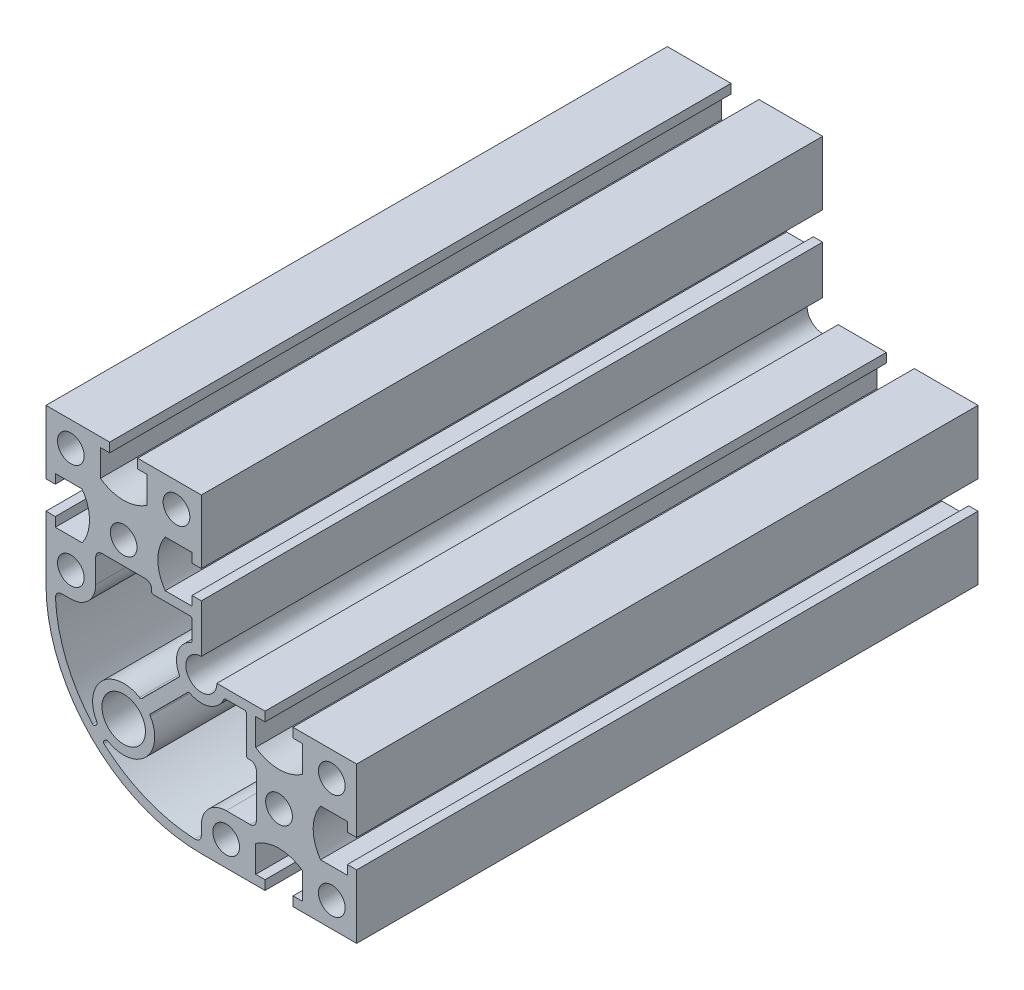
ISO-10303-21;
HEADER;
FILE_DESCRIPTION(('STEP AP214'),'2;1');
FILE_NAME('part.step','',(''),(''),'','','');
FILE_SCHEMA(('AUTOMOTIVE_DESIGN { 1 0 10303 214 1 1 1 1 }'));
ENDSEC;
DATA;
#1=APPLICATION_CONTEXT('core data for automotive mechanical design processes');
#2=APPLICATION_PROTOCOL_DEFINITION('international standard','automotive_design',2000,#1);
#3=PRODUCT_CONTEXT('',#1,'mechanical');
#4=PRODUCT('Part','Part','',(#3));
#5=PRODUCT_RELATED_PRODUCT_CATEGORY('part','',(#4));
#6=PRODUCT_DEFINITION_FORMATION('','',#4);
#7=PRODUCT_DEFINITION_CONTEXT('part definition',#1,'design');
#8=PRODUCT_DEFINITION('design','',#6,#7);
#9=PRODUCT_DEFINITION_SHAPE('','',#8);
#10=(LENGTH_UNIT() NAMED_UNIT(*) SI_UNIT(.MILLI.,.METRE.));
#11=(NAMED_UNIT(*) PLANE_ANGLE_UNIT() SI_UNIT($,.RADIAN.));
#12=(NAMED_UNIT(*) SI_UNIT($,.STERADIAN.) SOLID_ANGLE_UNIT());
#13=UNCERTAINTY_MEASURE_WITH_UNIT(LENGTH_MEASURE(1.E-05),#10,'distance_accuracy_value','');
#14=(GEOMETRIC_REPRESENTATION_CONTEXT(3) GLOBAL_UNCERTAINTY_ASSIGNED_CONTEXT((#13)) GLOBAL_UNIT_ASSIGNED_CONTEXT((#10,
#11,#12)) REPRESENTATION_CONTEXT('',''));
#15=CARTESIAN_POINT('',(0.,0.,0.));
#16=DIRECTION('',(0.,0.,1.));
#17=DIRECTION('',(1.,0.,0.));
#18=AXIS2_PLACEMENT_3D('',#15,#16,#17);
#19=CARTESIAN_POINT('',(0.500000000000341,37.500000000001,50.));
#20=DIRECTION('',(0.,0.,-1.));
#21=DIRECTION('',(-1.,0.,0.));
#22=AXIS2_PLACEMENT_3D('',#19,#20,#21);
#23=PLANE('',#22);
#24=CARTESIAN_POINT('',(12.5000000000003,12.5000000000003,50.));
#25=DIRECTION('',(0.,0.,1.));
#26=DIRECTION('',(1.,0.,0.));
#27=AXIS2_PLACEMENT_3D('',#24,#25,#26);
#28=CIRCLE('',#27,3.5);
#29=CARTESIAN_POINT('',(16.0000000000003,12.5000000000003,50.));
#30=VERTEX_POINT('',#29);
#31=EDGE_CURVE('E948',#30,#30,#28,.T.);
#32=ORIENTED_EDGE('',*,*,#31,.F.);
#33=EDGE_LOOP('',(#32));
#34=FACE_BOUND('',#33,.T.);
#35=DIRECTION('',(0.,-1.,0.));
#36=VECTOR('',#35,1.);
#37=CARTESIAN_POINT('',(32.2500000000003,0.,50.));
#38=LINE('',#37,#36);
#39=CARTESIAN_POINT('',(32.2500000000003,23.2000000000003,50.));
#40=VERTEX_POINT('',#39);
#41=CARTESIAN_POINT('',(32.2500000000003,17.2999999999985,50.));
#42=VERTEX_POINT('',#41);
#43=EDGE_CURVE('E1000',#40,#42,#38,.T.);
#44=ORIENTED_EDGE('',*,*,#43,.T.);
#45=CARTESIAN_POINT('',(32.5500000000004,17.2999999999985,50.));
#46=DIRECTION('',(0.,0.,1.));
#47=DIRECTION('',(1.,0.,0.));
#48=AXIS2_PLACEMENT_3D('',#45,#46,#47);
#49=CIRCLE('',#48,0.300000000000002);
#50=CARTESIAN_POINT('',(32.5500000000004,16.9999999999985,50.));
#51=VERTEX_POINT('',#50);
#52=EDGE_CURVE('E321',#51,#42,#49,.F.);
#53=ORIENTED_EDGE('',*,*,#52,.F.);
#54=DIRECTION('',(1.,0.,0.));
#55=VECTOR('',#54,1.);
#56=CARTESIAN_POINT('',(1.96601993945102E-13,16.9999999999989,50.));
#57=LINE('',#56,#55);
#58=CARTESIAN_POINT('',(32.8499999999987,16.9999999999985,50.));
#59=VERTEX_POINT('',#58);
#60=EDGE_CURVE('E942',#51,#59,#57,.T.);
#61=ORIENTED_EDGE('',*,*,#60,.T.);
#62=CARTESIAN_POINT('',(32.8499999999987,15.9999999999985,50.));
#63=DIRECTION('',(0.,0.,1.));
#64=DIRECTION('',(1.,0.,0.));
#65=AXIS2_PLACEMENT_3D('',#62,#63,#64);
#66=CIRCLE('',#65,0.999999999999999);
#67=CARTESIAN_POINT('',(33.8499999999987,15.9999999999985,50.));
#68=VERTEX_POINT('',#67);
#69=EDGE_CURVE('E945',#68,#59,#66,.T.);
#70=ORIENTED_EDGE('',*,*,#69,.F.);
#71=DIRECTION('',(0.,-1.,0.));
#72=VECTOR('',#71,1.);
#73=CARTESIAN_POINT('',(33.8499999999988,0.,50.));
#74=LINE('',#73,#72);
#75=CARTESIAN_POINT('',(33.8499999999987,8.99999999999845,50.));
#76=VERTEX_POINT('',#75);
#77=EDGE_CURVE('E1054',#68,#76,#74,.T.);
#78=ORIENTED_EDGE('',*,*,#77,.T.);
#79=CARTESIAN_POINT('',(32.8499999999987,8.99999999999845,50.));
#80=DIRECTION('',(0.,0.,1.));
#81=DIRECTION('',(1.,0.,0.));
#82=AXIS2_PLACEMENT_3D('',#79,#80,#81);
#83=CIRCLE('',#82,1.00000000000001);
#84=CARTESIAN_POINT('',(32.8499999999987,7.99999999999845,50.));
#85=VERTEX_POINT('',#84);
#86=EDGE_CURVE('E1051',#76,#85,#83,.F.);
#87=ORIENTED_EDGE('',*,*,#86,.T.);
#88=DIRECTION('',(1.,0.,0.));
#89=VECTOR('',#88,1.);
#90=CARTESIAN_POINT('',(0.,7.99999999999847,50.));
#91=LINE('',#90,#89);
#92=CARTESIAN_POINT('',(28.9999999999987,7.99999999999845,50.));
#93=VERTEX_POINT('',#92);
#94=EDGE_CURVE('E1048',#93,#85,#91,.T.);
#95=ORIENTED_EDGE('',*,*,#94,.F.);
#96=CARTESIAN_POINT('',(28.9999999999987,4.,50.));
#97=DIRECTION('',(0.,0.,1.));
#98=DIRECTION('',(1.,0.,0.));
#99=AXIS2_PLACEMENT_3D('',#96,#97,#98);
#100=CIRCLE('',#99,3.99999999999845);
#101=CARTESIAN_POINT('',(25.0000000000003,4.,50.));
#102=VERTEX_POINT('',#101);
#103=EDGE_CURVE('E1045',#102,#93,#100,.F.);
#104=ORIENTED_EDGE('',*,*,#103,.F.);
#105=DIRECTION('',(0.,-1.,0.));
#106=VECTOR('',#105,1.);
#107=CARTESIAN_POINT('',(25.0000000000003,0.,50.));
#108=LINE('',#107,#106);
#109=CARTESIAN_POINT('',(25.0000000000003,2.52223320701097,50.));
#110=VERTEX_POINT('',#109);
#111=EDGE_CURVE('E1042',#102,#110,#108,.T.);
#112=ORIENTED_EDGE('',*,*,#111,.T.);
#113=CARTESIAN_POINT('',(24.0000000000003,2.52223320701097,50.));
#114=DIRECTION('',(0.,0.,1.));
#115=DIRECTION('',(1.,0.,0.));
#116=AXIS2_PLACEMENT_3D('',#113,#114,#115);
#117=CIRCLE('',#116,1.);
#118=CARTESIAN_POINT('',(23.9555555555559,1.52322134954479,50.));
#119=VERTEX_POINT('',#118);
#120=EDGE_CURVE('E1039',#119,#110,#117,.T.);
#121=ORIENTED_EDGE('',*,*,#120,.F.);
#122=CARTESIAN_POINT('',(25.,25.,50.));
#123=DIRECTION('',(0.,0.,1.));
#124=DIRECTION('',(1.,0.,0.));
#125=AXIS2_PLACEMENT_3D('',#122,#123,#124);
#126=CIRCLE('',#125,23.5);
#127=CARTESIAN_POINT('',(9.34022424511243,7.47797319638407,50.));
#128=VERTEX_POINT('',#127);
#129=EDGE_CURVE('E1036',#128,#119,#126,.T.);
#130=ORIENTED_EDGE('',*,*,#129,.F.);
#131=CARTESIAN_POINT('',(9.54013627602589,7.70165864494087,50.));
#132=DIRECTION('',(0.,0.,1.));
#133=DIRECTION('',(1.,0.,0.));
#134=AXIS2_PLACEMENT_3D('',#131,#132,#133);
#135=CIRCLE('',#134,0.300000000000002);
#136=CARTESIAN_POINT('',(9.32800424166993,7.91379067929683,50.));
#137=VERTEX_POINT('',#136);
#138=EDGE_CURVE('E1033',#137,#128,#135,.T.);
#139=ORIENTED_EDGE('',*,*,#138,.F.);
#140=DIRECTION('',(-0.707106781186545,-0.70710678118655,0.));
#141=VECTOR('',#140,1.);
#142=CARTESIAN_POINT('',(0.707106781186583,-0.707106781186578,50.));
#143=LINE('',#142,#141);
#144=CARTESIAN_POINT('',(9.57392635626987,8.15971279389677,50.));
#145=VERTEX_POINT('',#144);
#146=EDGE_CURVE('E1030',#145,#137,#143,.T.);
#147=ORIENTED_EDGE('',*,*,#146,.F.);
#148=CARTESIAN_POINT('',(9.78605839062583,7.94758075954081,50.));
#149=DIRECTION('',(0.,0.,1.));
#150=DIRECTION('',(1.,0.,0.));
#151=AXIS2_PLACEMENT_3D('',#148,#149,#150);
#152=CIRCLE('',#151,0.3);
#153=CARTESIAN_POINT('',(9.93967772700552,8.20526486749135,50.));
#154=VERTEX_POINT('',#153);
#155=EDGE_CURVE('E1027',#154,#145,#152,.T.);
#156=ORIENTED_EDGE('',*,*,#155,.F.);
#157=CARTESIAN_POINT('',(12.5000000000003,12.5000000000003,50.));
#158=DIRECTION('',(0.,0.,1.));
#159=DIRECTION('',(1.,0.,0.));
#160=AXIS2_PLACEMENT_3D('',#157,#158,#159);
#161=CIRCLE('',#160,5.);
#162=CARTESIAN_POINT('',(16.7947351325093,15.0603222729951,50.));
#163=VERTEX_POINT('',#162);
#164=EDGE_CURVE('E1024',#154,#163,#161,.T.);
#165=ORIENTED_EDGE('',*,*,#164,.T.);
#166=CARTESIAN_POINT('',(17.0524192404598,15.2139416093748,50.));
#167=DIRECTION('',(0.,0.,1.));
#168=DIRECTION('',(1.,0.,0.));
#169=AXIS2_PLACEMENT_3D('',#166,#167,#168);
#170=CIRCLE('',#169,0.3);
#171=CARTESIAN_POINT('',(16.8402872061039,15.4260736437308,50.));
#172=VERTEX_POINT('',#171);
#173=EDGE_CURVE('E1021',#172,#163,#170,.T.);
#174=ORIENTED_EDGE('',*,*,#173,.F.);
#175=DIRECTION('',(-0.707106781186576,-0.707106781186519,0.));
#176=VECTOR('',#175,1.);
#177=CARTESIAN_POINT('',(0.707106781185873,-0.70710678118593,50.));
#178=LINE('',#177,#176);
#179=CARTESIAN_POINT('',(22.808831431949,21.3946178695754,50.));
#180=VERTEX_POINT('',#179);
#181=EDGE_CURVE('E1018',#180,#172,#178,.T.);
#182=ORIENTED_EDGE('',*,*,#181,.F.);
#183=CARTESIAN_POINT('',(23.020963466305,21.1824858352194,50.));
#184=DIRECTION('',(0.,0.,1.));
#185=DIRECTION('',(1.,0.,0.));
#186=AXIS2_PLACEMENT_3D('',#183,#184,#185);
#187=CIRCLE('',#186,0.3);
#188=CARTESIAN_POINT('',(23.1590357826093,21.4488240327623,50.));
#189=VERTEX_POINT('',#188);
#190=EDGE_CURVE('E1015',#180,#189,#187,.F.);
#191=ORIENTED_EDGE('',*,*,#190,.T.);
#192=CARTESIAN_POINT('',(25.,25.,50.));
#193=DIRECTION('',(0.,0.,1.));
#194=DIRECTION('',(1.,0.,0.));
#195=AXIS2_PLACEMENT_3D('',#192,#193,#194);
#196=CIRCLE('',#195,4.);
#197=CARTESIAN_POINT('',(28.6326742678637,23.3255813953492,50.));
#198=VERTEX_POINT('',#197);
#199=EDGE_CURVE('E1012',#189,#198,#196,.T.);
#200=ORIENTED_EDGE('',*,*,#199,.T.);
#201=CARTESIAN_POINT('',(28.9051248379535,23.2000000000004,50.));
#202=DIRECTION('',(0.,0.,1.));
#203=DIRECTION('',(1.,0.,0.));
#204=AXIS2_PLACEMENT_3D('',#201,#202,#203);
#205=CIRCLE('',#204,0.300000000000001);
#206=CARTESIAN_POINT('',(28.9051248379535,23.5000000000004,50.));
#207=VERTEX_POINT('',#206);
#208=EDGE_CURVE('E1009',#207,#198,#205,.T.);
#209=ORIENTED_EDGE('',*,*,#208,.F.);
#210=DIRECTION('',(1.,0.,0.));
#211=VECTOR('',#210,1.);
#212=CARTESIAN_POINT('',(8.8363429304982E-13,23.5000000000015,50.));
#213=LINE('',#212,#211);
#214=CARTESIAN_POINT('',(31.9500000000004,23.5000000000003,50.));
#215=VERTEX_POINT('',#214);
#216=EDGE_CURVE('E1006',#207,#215,#213,.T.);
#217=ORIENTED_EDGE('',*,*,#216,.T.);
#218=CARTESIAN_POINT('',(31.9500000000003,23.2000000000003,50.));
#219=DIRECTION('',(0.,0.,1.));
#220=DIRECTION('',(1.,0.,0.));
#221=AXIS2_PLACEMENT_3D('',#218,#219,#220);
#222=CIRCLE('',#221,0.3);
#223=EDGE_CURVE('E1003',#40,#215,#222,.T.);
#224=ORIENTED_EDGE('',*,*,#223,.F.);
#225=EDGE_LOOP('',(#44,#53,#61,#70,#78,#87,#95,#104,#112,#121,#130,#139,#147,#156,#165,#174,
#182,#191,#200,#209,#217,#224));
#226=FACE_BOUND('',#225,.T.);
#227=CARTESIAN_POINT('',(4.,28.9999999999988,50.));
#228=DIRECTION('',(0.,0.,1.));
#229=DIRECTION('',(-1.,0.,0.));
#230=AXIS2_PLACEMENT_3D('',#227,#228,#229);
#231=CIRCLE('',#230,2.15000000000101);
#232=CARTESIAN_POINT('',(1.84999999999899,28.9999999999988,50.));
#233=VERTEX_POINT('',#232);
#234=EDGE_CURVE('E1271',#233,#233,#231,.T.);
#235=ORIENTED_EDGE('',*,*,#234,.F.);
#236=EDGE_LOOP('',(#235));
#237=FACE_BOUND('',#236,.T.);
#238=CARTESIAN_POINT('',(21.,45.9999999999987,50.));
#239=DIRECTION('',(0.,0.,1.));
#240=DIRECTION('',(-1.,0.,0.));
#241=AXIS2_PLACEMENT_3D('',#238,#239,#240);
#242=CIRCLE('',#241,2.15000000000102);
#243=CARTESIAN_POINT('',(18.849999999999,45.9999999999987,50.));
#244=VERTEX_POINT('',#243);
#245=EDGE_CURVE('E1283',#244,#244,#242,.T.);
#246=ORIENTED_EDGE('',*,*,#245,.F.);
#247=EDGE_LOOP('',(#246));
#248=FACE_BOUND('',#247,.T.);
#249=CARTESIAN_POINT('',(45.9999999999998,4.,50.));
#250=DIRECTION('',(0.,0.,1.));
#251=DIRECTION('',(1.,0.,0.));
#252=AXIS2_PLACEMENT_3D('',#249,#250,#251);
#253=CIRCLE('',#252,2.15000000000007);
#254=CARTESIAN_POINT('',(48.1499999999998,4.,50.));
#255=VERTEX_POINT('',#254);
#256=EDGE_CURVE('E1295',#255,#255,#253,.T.);
#257=ORIENTED_EDGE('',*,*,#256,.F.);
#258=EDGE_LOOP('',(#257));
#259=FACE_BOUND('',#258,.T.);
#260=CARTESIAN_POINT('',(37.4999999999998,12.5,50.));
#261=DIRECTION('',(0.,0.,1.));
#262=DIRECTION('',(1.,0.,0.));
#263=AXIS2_PLACEMENT_3D('',#260,#261,#262);
#264=CIRCLE('',#263,2.15);
#265=CARTESIAN_POINT('',(39.6499999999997,12.5,50.));
#266=VERTEX_POINT('',#265);
#267=EDGE_CURVE('E1307',#266,#266,#264,.T.);
#268=ORIENTED_EDGE('',*,*,#267,.F.);
#269=EDGE_LOOP('',(#268));
#270=FACE_BOUND('',#269,.T.);
#271=DIRECTION('',(-1.,0.,0.));
#272=VECTOR('',#271,1.);
#273=CARTESIAN_POINT('',(10.2500000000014,50.0000000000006,50.));
#274=LINE('',#273,#272);
#275=CARTESIAN_POINT('',(10.2500000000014,50.0000000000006,50.));
#276=VERTEX_POINT('',#275);
#277=CARTESIAN_POINT('',(0.,50.,50.));
#278=VERTEX_POINT('',#277);
#279=EDGE_CURVE('E1319',#276,#278,#274,.T.);
#280=ORIENTED_EDGE('',*,*,#279,.T.);
#281=DIRECTION('',(0.,-1.,0.));
#282=VECTOR('',#281,1.);
#283=CARTESIAN_POINT('',(0.,50.,50.));
#284=LINE('',#283,#282);
#285=CARTESIAN_POINT('',(-5.27355936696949E-13,39.750000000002,50.));
#286=VERTEX_POINT('',#285);
#287=EDGE_CURVE('E1322',#278,#286,#284,.T.);
#288=ORIENTED_EDGE('',*,*,#287,.T.);
#289=DIRECTION('',(1.,0.,0.));
#290=VECTOR('',#289,1.);
#291=CARTESIAN_POINT('',(-5.27355936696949E-13,39.750000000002,50.));
#292=LINE('',#291,#290);
#293=CARTESIAN_POINT('',(1.50000000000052,39.750000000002,50.));
#294=VERTEX_POINT('',#293);
#295=EDGE_CURVE('E1325',#286,#294,#292,.T.);
#296=ORIENTED_EDGE('',*,*,#295,.T.);
#297=DIRECTION('',(0.,1.,0.));
#298=VECTOR('',#297,1.);
#299=CARTESIAN_POINT('',(1.50000000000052,39.750000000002,50.));
#300=LINE('',#299,#298);
#301=CARTESIAN_POINT('',(1.50000000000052,41.250000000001,50.));
#302=VERTEX_POINT('',#301);
#303=EDGE_CURVE('E1327',#294,#302,#300,.T.);
#304=ORIENTED_EDGE('',*,*,#303,.T.);
#305=DIRECTION('',(1.,0.,0.));
#306=VECTOR('',#305,1.);
#307=CARTESIAN_POINT('',(1.50000000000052,41.250000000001,50.));
#308=LINE('',#307,#306);
#309=CARTESIAN_POINT('',(5.80919014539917,41.250000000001,50.));
#310=VERTEX_POINT('',#309);
#311=EDGE_CURVE('E1329',#302,#310,#308,.T.);
#312=ORIENTED_EDGE('',*,*,#311,.T.);
#313=CARTESIAN_POINT('',(0.500000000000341,37.500000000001,50.));
#314=DIRECTION('',(0.,0.,-1.));
#315=DIRECTION('',(-1.,0.,0.));
#316=AXIS2_PLACEMENT_3D('',#313,#314,#315);
#317=CIRCLE('',#316,6.50000000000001);
#318=CARTESIAN_POINT('',(5.80919014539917,33.750000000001,50.));
#319=VERTEX_POINT('',#318);
#320=EDGE_CURVE('E1331',#310,#319,#317,.T.);
#321=ORIENTED_EDGE('',*,*,#320,.T.);
#322=DIRECTION('',(-1.,0.,0.));
#323=VECTOR('',#322,1.);
#324=CARTESIAN_POINT('',(1.50000000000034,33.750000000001,50.));
#325=LINE('',#324,#323);
#326=CARTESIAN_POINT('',(1.50000000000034,33.750000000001,50.));
#327=VERTEX_POINT('',#326);
#328=EDGE_CURVE('E1333',#319,#327,#325,.T.);
#329=ORIENTED_EDGE('',*,*,#328,.T.);
#330=DIRECTION('',(0.,1.,0.));
#331=VECTOR('',#330,1.);
#332=CARTESIAN_POINT('',(1.50000000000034,35.250000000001,50.));
#333=LINE('',#332,#331);
#334=CARTESIAN_POINT('',(1.50000000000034,35.250000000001,50.));
#335=VERTEX_POINT('',#334);
#336=EDGE_CURVE('E1335',#327,#335,#333,.T.);
#337=ORIENTED_EDGE('',*,*,#336,.T.);
#338=DIRECTION('',(-1.,0.,0.));
#339=VECTOR('',#338,1.);
#340=CARTESIAN_POINT('',(-2.91433543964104E-13,35.250000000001,50.));
#341=LINE('',#340,#339);
#342=CARTESIAN_POINT('',(-2.91433543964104E-13,35.250000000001,50.));
#343=VERTEX_POINT('',#342);
#344=EDGE_CURVE('E1337',#335,#343,#341,.T.);
#345=ORIENTED_EDGE('',*,*,#344,.T.);
#346=DIRECTION('',(0.,-1.,0.));
#347=VECTOR('',#346,1.);
#348=CARTESIAN_POINT('',(-2.91433543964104E-13,35.250000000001,50.));
#349=LINE('',#348,#347);
#350=CARTESIAN_POINT('',(0.,25.,50.));
#351=VERTEX_POINT('',#350);
#352=EDGE_CURVE('E1339',#343,#351,#349,.T.);
#353=ORIENTED_EDGE('',*,*,#352,.T.);
#354=CARTESIAN_POINT('',(25.,25.,50.));
#355=DIRECTION('',(0.,0.,1.));
#356=DIRECTION('',(1.,0.,0.));
#357=AXIS2_PLACEMENT_3D('',#354,#355,#356);
#358=CIRCLE('',#357,25.);
#359=CARTESIAN_POINT('',(25.,0.,50.));
#360=VERTEX_POINT('',#359);
#361=EDGE_CURVE('E1341',#351,#360,#358,.T.);
#362=ORIENTED_EDGE('',*,*,#361,.T.);
#363=DIRECTION('',(1.,0.,0.));
#364=VECTOR('',#363,1.);
#365=CARTESIAN_POINT('',(25.,0.,50.));
#366=LINE('',#365,#364);
#367=CARTESIAN_POINT('',(35.2499999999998,2.04697370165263E-13,50.));
#368=VERTEX_POINT('',#367);
#369=EDGE_CURVE('E1343',#360,#368,#366,.T.);
#370=ORIENTED_EDGE('',*,*,#369,.T.);
#371=DIRECTION('',(0.,1.,0.));
#372=VECTOR('',#371,1.);
#373=CARTESIAN_POINT('',(35.2499999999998,2.04697370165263E-13,50.));
#374=LINE('',#373,#372);
#375=CARTESIAN_POINT('',(35.2499999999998,1.5,50.));
#376=VERTEX_POINT('',#375);
#377=EDGE_CURVE('E1345',#368,#376,#374,.T.);
#378=ORIENTED_EDGE('',*,*,#377,.T.);
#379=DIRECTION('',(-1.,0.,0.));
#380=VECTOR('',#379,1.);
#381=CARTESIAN_POINT('',(35.2499999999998,1.5,50.));
#382=LINE('',#381,#380);
#383=CARTESIAN_POINT('',(33.7499999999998,1.5,50.));
#384=VERTEX_POINT('',#383);
#385=EDGE_CURVE('E1347',#376,#384,#382,.T.);
#386=ORIENTED_EDGE('',*,*,#385,.T.);
#387=DIRECTION('',(0.,1.,0.));
#388=VECTOR('',#387,1.);
#389=CARTESIAN_POINT('',(33.7499999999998,1.5,50.));
#390=LINE('',#389,#388);
#391=CARTESIAN_POINT('',(33.7499999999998,5.80919014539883,50.));
#392=VERTEX_POINT('',#391);
#393=EDGE_CURVE('E1349',#384,#392,#390,.T.);
#394=ORIENTED_EDGE('',*,*,#393,.T.);
#395=CARTESIAN_POINT('',(37.4999999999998,0.5,50.));
#396=DIRECTION('',(0.,0.,-1.));
#397=DIRECTION('',(1.,0.,0.));
#398=AXIS2_PLACEMENT_3D('',#395,#396,#397);
#399=CIRCLE('',#398,6.5);
#400=CARTESIAN_POINT('',(41.2499999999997,5.80919014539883,50.));
#401=VERTEX_POINT('',#400);
#402=EDGE_CURVE('E1351',#392,#401,#399,.T.);
#403=ORIENTED_EDGE('',*,*,#402,.T.);
#404=DIRECTION('',(0.,-1.,0.));
#405=VECTOR('',#404,1.);
#406=CARTESIAN_POINT('',(41.2499999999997,1.5,50.));
#407=LINE('',#406,#405);
#408=CARTESIAN_POINT('',(41.2499999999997,1.5,50.));
#409=VERTEX_POINT('',#408);
#410=EDGE_CURVE('E1353',#401,#409,#407,.T.);
#411=ORIENTED_EDGE('',*,*,#410,.T.);
#412=DIRECTION('',(-1.,0.,0.));
#413=VECTOR('',#412,1.);
#414=CARTESIAN_POINT('',(39.7499999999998,1.5,50.));
#415=LINE('',#414,#413);
#416=CARTESIAN_POINT('',(39.7499999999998,1.5,50.));
#417=VERTEX_POINT('',#416);
#418=EDGE_CURVE('E1355',#409,#417,#415,.T.);
#419=ORIENTED_EDGE('',*,*,#418,.T.);
#420=DIRECTION('',(0.,-1.,0.));
#421=VECTOR('',#420,1.);
#422=CARTESIAN_POINT('',(39.7499999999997,2.04697370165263E-13,50.));
#423=LINE('',#422,#421);
#424=CARTESIAN_POINT('',(39.7499999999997,2.04697370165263E-13,50.));
#425=VERTEX_POINT('',#424);
#426=EDGE_CURVE('E1357',#417,#425,#423,.T.);
#427=ORIENTED_EDGE('',*,*,#426,.T.);
#428=DIRECTION('',(1.,0.,0.));
#429=VECTOR('',#428,1.);
#430=CARTESIAN_POINT('',(39.7499999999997,2.04697370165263E-13,50.));
#431=LINE('',#430,#429);
#432=CARTESIAN_POINT('',(50.,0.,50.));
#433=VERTEX_POINT('',#432);
#434=EDGE_CURVE('E1359',#425,#433,#431,.T.);
#435=ORIENTED_EDGE('',*,*,#434,.T.);
#436=DIRECTION('',(0.,1.,0.));
#437=VECTOR('',#436,1.);
#438=CARTESIAN_POINT('',(50.,0.,50.));
#439=LINE('',#438,#437);
#440=CARTESIAN_POINT('',(49.9999999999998,10.2500000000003,50.));
#441=VERTEX_POINT('',#440);
#442=EDGE_CURVE('E1361',#433,#441,#439,.T.);
#443=ORIENTED_EDGE('',*,*,#442,.T.);
#444=DIRECTION('',(-1.,0.,0.));
#445=VECTOR('',#444,1.);
#446=CARTESIAN_POINT('',(49.9999999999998,10.2500000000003,50.));
#447=LINE('',#446,#445);
#448=CARTESIAN_POINT('',(48.5,10.2500000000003,50.));
#449=VERTEX_POINT('',#448);
#450=EDGE_CURVE('E1363',#441,#449,#447,.T.);
#451=ORIENTED_EDGE('',*,*,#450,.T.);
#452=DIRECTION('',(0.,-1.,0.));
#453=VECTOR('',#452,1.);
#454=CARTESIAN_POINT('',(48.5,10.2500000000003,50.));
#455=LINE('',#454,#453);
#456=CARTESIAN_POINT('',(48.5,8.75000000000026,50.));
#457=VERTEX_POINT('',#456);
#458=EDGE_CURVE('E1365',#449,#457,#455,.T.);
#459=ORIENTED_EDGE('',*,*,#458,.T.);
#460=DIRECTION('',(-1.,0.,0.));
#461=VECTOR('',#460,1.);
#462=CARTESIAN_POINT('',(48.5,8.75000000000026,50.));
#463=LINE('',#462,#461);
#464=CARTESIAN_POINT('',(44.1908098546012,8.75000000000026,50.));
#465=VERTEX_POINT('',#464);
#466=EDGE_CURVE('E1367',#457,#465,#463,.T.);
#467=ORIENTED_EDGE('',*,*,#466,.T.);
#468=CARTESIAN_POINT('',(49.5,12.5000000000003,50.));
#469=DIRECTION('',(0.,0.,-1.));
#470=DIRECTION('',(1.,0.,0.));
#471=AXIS2_PLACEMENT_3D('',#468,#469,#470);
#472=CIRCLE('',#471,6.5);
#473=CARTESIAN_POINT('',(44.1908098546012,16.2500000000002,50.));
#474=VERTEX_POINT('',#473);
#475=EDGE_CURVE('E1369',#465,#474,#472,.T.);
#476=ORIENTED_EDGE('',*,*,#475,.T.);
#477=DIRECTION('',(1.,0.,0.));
#478=VECTOR('',#477,1.);
#479=CARTESIAN_POINT('',(48.5,16.2500000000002,50.));
#480=LINE('',#479,#478);
#481=CARTESIAN_POINT('',(48.5,16.2500000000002,50.));
#482=VERTEX_POINT('',#481);
#483=EDGE_CURVE('E1371',#474,#482,#480,.T.);
#484=ORIENTED_EDGE('',*,*,#483,.T.);
#485=DIRECTION('',(0.,-1.,0.));
#486=VECTOR('',#485,1.);
#487=CARTESIAN_POINT('',(48.5,14.7500000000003,50.));
#488=LINE('',#487,#486);
#489=CARTESIAN_POINT('',(48.5,14.7500000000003,50.));
#490=VERTEX_POINT('',#489);
#491=EDGE_CURVE('E1373',#482,#490,#488,.T.);
#492=ORIENTED_EDGE('',*,*,#491,.T.);
#493=DIRECTION('',(1.,0.,0.));
#494=VECTOR('',#493,1.);
#495=CARTESIAN_POINT('',(49.9999999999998,14.7500000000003,50.));
#496=LINE('',#495,#494);
#497=CARTESIAN_POINT('',(49.9999999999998,14.7500000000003,50.));
#498=VERTEX_POINT('',#497);
#499=EDGE_CURVE('E1375',#490,#498,#496,.T.);
#500=ORIENTED_EDGE('',*,*,#499,.T.);
#501=DIRECTION('',(0.,1.,0.));
#502=VECTOR('',#501,1.);
#503=CARTESIAN_POINT('',(49.9999999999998,14.7500000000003,50.));
#504=LINE('',#503,#502);
#505=CARTESIAN_POINT('',(50.,25.,50.));
#506=VERTEX_POINT('',#505);
#507=EDGE_CURVE('E1377',#498,#506,#504,.T.);
#508=ORIENTED_EDGE('',*,*,#507,.T.);
#509=DIRECTION('',(-1.,0.,0.));
#510=VECTOR('',#509,1.);
#511=CARTESIAN_POINT('',(50.,25.,50.));
#512=LINE('',#511,#510);
#513=CARTESIAN_POINT('',(39.7499999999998,25.0000000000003,50.));
#514=VERTEX_POINT('',#513);
#515=EDGE_CURVE('E1379',#506,#514,#512,.T.);
#516=ORIENTED_EDGE('',*,*,#515,.T.);
#517=DIRECTION('',(0.,-1.,0.));
#518=VECTOR('',#517,1.);
#519=CARTESIAN_POINT('',(39.7499999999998,25.0000000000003,50.));
#520=LINE('',#519,#518);
#521=CARTESIAN_POINT('',(39.7499999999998,23.5000000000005,50.));
#522=VERTEX_POINT('',#521);
#523=EDGE_CURVE('E1381',#514,#522,#520,.T.);
#524=ORIENTED_EDGE('',*,*,#523,.T.);
#525=DIRECTION('',(1.,0.,0.));
#526=VECTOR('',#525,1.);
#527=CARTESIAN_POINT('',(39.7499999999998,23.5000000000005,50.));
#528=LINE('',#527,#526);
#529=CARTESIAN_POINT('',(41.2499999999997,23.5000000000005,50.));
#530=VERTEX_POINT('',#529);
#531=EDGE_CURVE('E1383',#522,#530,#528,.T.);
#532=ORIENTED_EDGE('',*,*,#531,.T.);
#533=DIRECTION('',(0.,-1.,0.));
#534=VECTOR('',#533,1.);
#535=CARTESIAN_POINT('',(41.2499999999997,23.5000000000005,50.));
#536=LINE('',#535,#534);
#537=CARTESIAN_POINT('',(41.2499999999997,19.1908098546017,50.));
#538=VERTEX_POINT('',#537);
#539=EDGE_CURVE('E1385',#530,#538,#536,.T.);
#540=ORIENTED_EDGE('',*,*,#539,.T.);
#541=CARTESIAN_POINT('',(37.4999999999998,24.5000000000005,50.));
#542=DIRECTION('',(0.,0.,-1.));
#543=DIRECTION('',(1.,0.,0.));
#544=AXIS2_PLACEMENT_3D('',#541,#542,#543);
#545=CIRCLE('',#544,6.5);
#546=CARTESIAN_POINT('',(33.7499999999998,19.1908098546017,50.));
#547=VERTEX_POINT('',#546);
#548=EDGE_CURVE('E1387',#538,#547,#545,.T.);
#549=ORIENTED_EDGE('',*,*,#548,.T.);
#550=DIRECTION('',(0.,1.,0.));
#551=VECTOR('',#550,1.);
#552=CARTESIAN_POINT('',(33.7499999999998,23.5000000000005,50.));
#553=LINE('',#552,#551);
#554=CARTESIAN_POINT('',(33.7499999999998,23.5000000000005,50.));
#555=VERTEX_POINT('',#554);
#556=EDGE_CURVE('E1389',#547,#555,#553,.T.);
#557=ORIENTED_EDGE('',*,*,#556,.T.);
#558=DIRECTION('',(1.,0.,0.));
#559=VECTOR('',#558,1.);
#560=CARTESIAN_POINT('',(35.2499999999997,23.5000000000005,50.));
#561=LINE('',#560,#559);
#562=CARTESIAN_POINT('',(35.2499999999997,23.5000000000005,50.));
#563=VERTEX_POINT('',#562);
#564=EDGE_CURVE('E1391',#555,#563,#561,.T.);
#565=ORIENTED_EDGE('',*,*,#564,.T.);
#566=DIRECTION('',(0.,1.,0.));
#567=VECTOR('',#566,1.);
#568=CARTESIAN_POINT('',(35.2499999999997,25.0000000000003,50.));
#569=LINE('',#568,#567);
#570=CARTESIAN_POINT('',(35.2499999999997,25.0000000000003,50.));
#571=VERTEX_POINT('',#570);
#572=EDGE_CURVE('E1393',#563,#571,#569,.T.);
#573=ORIENTED_EDGE('',*,*,#572,.T.);
#574=DIRECTION('',(-1.,0.,0.));
#575=VECTOR('',#574,1.);
#576=CARTESIAN_POINT('',(35.2499999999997,25.0000000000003,50.));
#577=LINE('',#576,#575);
#578=CARTESIAN_POINT('',(27.5,25.0000000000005,50.));
#579=VERTEX_POINT('',#578);
#580=EDGE_CURVE('E1395',#571,#579,#577,.T.);
#581=ORIENTED_EDGE('',*,*,#580,.T.);
#582=CARTESIAN_POINT('',(25.,25.,50.));
#583=DIRECTION('',(0.,0.,-1.));
#584=DIRECTION('',(1.,0.,0.));
#585=AXIS2_PLACEMENT_3D('',#582,#583,#584);
#586=CIRCLE('',#585,2.5);
#587=CARTESIAN_POINT('',(25.,27.5,50.));
#588=VERTEX_POINT('',#587);
#589=EDGE_CURVE('E1397',#579,#588,#586,.T.);
#590=ORIENTED_EDGE('',*,*,#589,.T.);
#591=DIRECTION('',(0.,1.,0.));
#592=VECTOR('',#591,1.);
#593=CARTESIAN_POINT('',(25.0000000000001,35.2499999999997,50.));
#594=LINE('',#593,#592);
#595=CARTESIAN_POINT('',(25.0000000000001,35.2499999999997,50.));
#596=VERTEX_POINT('',#595);
#597=EDGE_CURVE('E1399',#588,#596,#594,.T.);
#598=ORIENTED_EDGE('',*,*,#597,.T.);
#599=DIRECTION('',(-1.,0.,0.));
#600=VECTOR('',#599,1.);
#601=CARTESIAN_POINT('',(25.0000000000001,35.2499999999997,50.));
#602=LINE('',#601,#600);
#603=CARTESIAN_POINT('',(23.5000000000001,35.2499999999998,50.));
#604=VERTEX_POINT('',#603);
#605=EDGE_CURVE('E1401',#596,#604,#602,.T.);
#606=ORIENTED_EDGE('',*,*,#605,.T.);
#607=DIRECTION('',(0.,-1.,0.));
#608=VECTOR('',#607,1.);
#609=CARTESIAN_POINT('',(23.5000000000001,35.2499999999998,50.));
#610=LINE('',#609,#608);
#611=CARTESIAN_POINT('',(23.5000000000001,33.75,50.));
#612=VERTEX_POINT('',#611);
#613=EDGE_CURVE('E1403',#604,#612,#610,.T.);
#614=ORIENTED_EDGE('',*,*,#613,.T.);
#615=DIRECTION('',(-1.,0.,0.));
#616=VECTOR('',#615,1.);
#617=CARTESIAN_POINT('',(23.5000000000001,33.75,50.));
#618=LINE('',#617,#616);
#619=CARTESIAN_POINT('',(19.1908098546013,33.7500000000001,50.));
#620=VERTEX_POINT('',#619);
#621=EDGE_CURVE('E1405',#612,#620,#618,.T.);
#622=ORIENTED_EDGE('',*,*,#621,.T.);
#623=CARTESIAN_POINT('',(24.5000000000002,37.5,50.));
#624=DIRECTION('',(0.,0.,-1.));
#625=DIRECTION('',(-1.,0.,0.));
#626=AXIS2_PLACEMENT_3D('',#623,#624,#625);
#627=CIRCLE('',#626,6.5);
#628=CARTESIAN_POINT('',(19.1908098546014,41.2500000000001,50.));
#629=VERTEX_POINT('',#628);
#630=EDGE_CURVE('E1407',#620,#629,#627,.T.);
#631=ORIENTED_EDGE('',*,*,#630,.T.);
#632=DIRECTION('',(1.,0.,0.));
#633=VECTOR('',#632,1.);
#634=CARTESIAN_POINT('',(23.5,41.2500000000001,50.));
#635=LINE('',#634,#633);
#636=CARTESIAN_POINT('',(23.5,41.2500000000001,50.));
#637=VERTEX_POINT('',#636);
#638=EDGE_CURVE('E1409',#629,#637,#635,.T.);
#639=ORIENTED_EDGE('',*,*,#638,.T.);
#640=DIRECTION('',(0.,-1.,0.));
#641=VECTOR('',#640,1.);
#642=CARTESIAN_POINT('',(23.5000000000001,39.7499999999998,50.));
#643=LINE('',#642,#641);
#644=CARTESIAN_POINT('',(23.5000000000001,39.7499999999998,50.));
#645=VERTEX_POINT('',#644);
#646=EDGE_CURVE('E1411',#637,#645,#643,.T.);
#647=ORIENTED_EDGE('',*,*,#646,.T.);
#648=DIRECTION('',(1.,0.,0.));
#649=VECTOR('',#648,1.);
#650=CARTESIAN_POINT('',(25.0000000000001,39.7499999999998,50.));
#651=LINE('',#650,#649);
#652=CARTESIAN_POINT('',(25.0000000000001,39.7499999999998,50.));
#653=VERTEX_POINT('',#652);
#654=EDGE_CURVE('E1413',#645,#653,#651,.T.);
#655=ORIENTED_EDGE('',*,*,#654,.T.);
#656=DIRECTION('',(0.,1.,0.));
#657=VECTOR('',#656,1.);
#658=CARTESIAN_POINT('',(25.0000000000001,50.,50.));
#659=LINE('',#658,#657);
#660=CARTESIAN_POINT('',(25.0000000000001,50.,50.));
#661=VERTEX_POINT('',#660);
#662=EDGE_CURVE('E1415',#653,#661,#659,.T.);
#663=ORIENTED_EDGE('',*,*,#662,.T.);
#664=DIRECTION('',(-1.,0.,0.));
#665=VECTOR('',#664,1.);
#666=CARTESIAN_POINT('',(25.0000000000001,50.,50.));
#667=LINE('',#666,#665);
#668=CARTESIAN_POINT('',(14.7500000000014,50.0000000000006,50.));
#669=VERTEX_POINT('',#668);
#670=EDGE_CURVE('E1417',#661,#669,#667,.T.);
#671=ORIENTED_EDGE('',*,*,#670,.T.);
#672=DIRECTION('',(0.,-1.,0.));
#673=VECTOR('',#672,1.);
#674=CARTESIAN_POINT('',(14.7500000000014,50.0000000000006,50.));
#675=LINE('',#674,#673);
#676=CARTESIAN_POINT('',(14.7500000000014,48.4999999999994,50.));
#677=VERTEX_POINT('',#676);
#678=EDGE_CURVE('E1419',#669,#677,#675,.T.);
#679=ORIENTED_EDGE('',*,*,#678,.T.);
#680=DIRECTION('',(1.,0.,0.));
#681=VECTOR('',#680,1.);
#682=CARTESIAN_POINT('',(14.7500000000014,48.4999999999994,50.));
#683=LINE('',#682,#681);
#684=CARTESIAN_POINT('',(16.2500000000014,48.4999999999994,50.));
#685=VERTEX_POINT('',#684);
#686=EDGE_CURVE('E1421',#677,#685,#683,.T.);
#687=ORIENTED_EDGE('',*,*,#686,.T.);
#688=DIRECTION('',(0.,-1.,0.));
#689=VECTOR('',#688,1.);
#690=CARTESIAN_POINT('',(16.2500000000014,48.4999999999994,50.));
#691=LINE('',#690,#689);
#692=CARTESIAN_POINT('',(16.2500000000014,44.1908098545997,50.));
#693=VERTEX_POINT('',#692);
#694=EDGE_CURVE('E1423',#685,#693,#691,.T.);
#695=ORIENTED_EDGE('',*,*,#694,.T.);
#696=CARTESIAN_POINT('',(12.5000000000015,49.4999999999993,50.));
#697=DIRECTION('',(0.,0.,-1.));
#698=DIRECTION('',(-1.,0.,0.));
#699=AXIS2_PLACEMENT_3D('',#696,#697,#698);
#700=CIRCLE('',#699,6.50000000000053);
#701=CARTESIAN_POINT('',(8.75000000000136,44.1908098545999,50.));
#702=VERTEX_POINT('',#701);
#703=EDGE_CURVE('E1425',#693,#702,#700,.T.);
#704=ORIENTED_EDGE('',*,*,#703,.T.);
#705=DIRECTION('',(0.,1.,0.));
#706=VECTOR('',#705,1.);
#707=CARTESIAN_POINT('',(8.75000000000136,48.4999999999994,50.));
#708=LINE('',#707,#706);
#709=CARTESIAN_POINT('',(8.75000000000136,48.4999999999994,50.));
#710=VERTEX_POINT('',#709);
#711=EDGE_CURVE('E1427',#702,#710,#708,.T.);
#712=ORIENTED_EDGE('',*,*,#711,.T.);
#713=DIRECTION('',(1.,0.,0.));
#714=VECTOR('',#713,1.);
#715=CARTESIAN_POINT('',(10.2500000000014,48.4999999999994,50.));
#716=LINE('',#715,#714);
#717=CARTESIAN_POINT('',(10.2500000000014,48.4999999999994,50.));
#718=VERTEX_POINT('',#717);
#719=EDGE_CURVE('E1429',#710,#718,#716,.T.);
#720=ORIENTED_EDGE('',*,*,#719,.T.);
#721=DIRECTION('',(0.,1.,0.));
#722=VECTOR('',#721,1.);
#723=CARTESIAN_POINT('',(10.2500000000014,50.0000000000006,50.));
#724=LINE('',#723,#722);
#725=EDGE_CURVE('E1431',#718,#276,#724,.T.);
#726=ORIENTED_EDGE('',*,*,#725,.T.);
#727=EDGE_LOOP('',(#280,#288,#296,#304,#312,#321,#329,#337,#345,#353,#362,#370,#378,#386,#394,
#403,#411,#419,#427,#435,#443,#451,#459,#467,#476,#484,#492,#500,#508,#516,#524,#532,#540,#549,
#557,#565,#573,#581,#590,#598,#606,#614,#622,#631,#639,#647,#655,#663,#671,#679,#687,#695,#704,
#712,#720,#726));
#728=FACE_BOUND('',#727,.T.);
#729=CARTESIAN_POINT('',(45.9999999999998,21.,50.));
#730=DIRECTION('',(0.,0.,1.));
#731=DIRECTION('',(1.,0.,0.));
#732=AXIS2_PLACEMENT_3D('',#729,#730,#731);
#733=CIRCLE('',#732,2.15000000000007);
#734=CARTESIAN_POINT('',(48.1499999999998,21.,50.));
#735=VERTEX_POINT('',#734);
#736=EDGE_CURVE('E1313',#735,#735,#733,.T.);
#737=ORIENTED_EDGE('',*,*,#736,.F.);
#738=EDGE_LOOP('',(#737));
#739=FACE_BOUND('',#738,.T.);
#740=CARTESIAN_POINT('',(12.5,37.5,50.));
#741=DIRECTION('',(0.,0.,1.));
#742=DIRECTION('',(1.,0.,0.));
#743=AXIS2_PLACEMENT_3D('',#740,#741,#742);
#744=CIRCLE('',#743,2.15);
#745=CARTESIAN_POINT('',(14.65,37.5,50.));
#746=VERTEX_POINT('',#745);
#747=EDGE_CURVE('E1301',#746,#746,#744,.T.);
#748=ORIENTED_EDGE('',*,*,#747,.F.);
#749=EDGE_LOOP('',(#748));
#750=FACE_BOUND('',#749,.T.);
#751=CARTESIAN_POINT('',(28.9999999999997,4.,50.));
#752=DIRECTION('',(0.,0.,1.));
#753=DIRECTION('',(1.,0.,0.));
#754=AXIS2_PLACEMENT_3D('',#751,#752,#753);
#755=CIRCLE('',#754,2.15000000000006);
#756=CARTESIAN_POINT('',(31.1499999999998,4.,50.));
#757=VERTEX_POINT('',#756);
#758=EDGE_CURVE('E1289',#757,#757,#755,.T.);
#759=ORIENTED_EDGE('',*,*,#758,.F.);
#760=EDGE_LOOP('',(#759));
#761=FACE_BOUND('',#760,.T.);
#762=CARTESIAN_POINT('',(4.,45.9999999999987,50.));
#763=DIRECTION('',(0.,0.,1.));
#764=DIRECTION('',(-1.,0.,0.));
#765=AXIS2_PLACEMENT_3D('',#762,#763,#764);
#766=CIRCLE('',#765,2.15000000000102);
#767=CARTESIAN_POINT('',(1.84999999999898,45.9999999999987,50.));
#768=VERTEX_POINT('',#767);
#769=EDGE_CURVE('E1277',#768,#768,#766,.T.);
#770=ORIENTED_EDGE('',*,*,#769,.F.);
#771=EDGE_LOOP('',(#770));
#772=FACE_BOUND('',#771,.T.);
#773=DIRECTION('',(-0.707106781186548,-0.707106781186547,0.));
#774=VECTOR('',#773,1.);
#775=CARTESIAN_POINT('',(-0.707106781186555,0.707106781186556,50.));
#776=LINE('',#775,#774);
#777=CARTESIAN_POINT('',(21.3946178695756,22.8088314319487,50.));
#778=VERTEX_POINT('',#777);
#779=CARTESIAN_POINT('',(15.4260736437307,16.8402872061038,50.));
#780=VERTEX_POINT('',#779);
#781=EDGE_CURVE('E1061',#778,#780,#776,.T.);
#782=ORIENTED_EDGE('',*,*,#781,.T.);
#783=CARTESIAN_POINT('',(15.2139416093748,17.0524192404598,50.));
#784=DIRECTION('',(0.,0.,1.));
#785=DIRECTION('',(1.,0.,0.));
#786=AXIS2_PLACEMENT_3D('',#783,#784,#785);
#787=CIRCLE('',#786,0.299999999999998);
#788=CARTESIAN_POINT('',(15.0603222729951,16.7947351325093,50.));
#789=VERTEX_POINT('',#788);
#790=EDGE_CURVE('E1104',#789,#780,#787,.T.);
#791=ORIENTED_EDGE('',*,*,#790,.F.);
#792=CARTESIAN_POINT('',(12.5000000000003,12.5000000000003,50.));
#793=DIRECTION('',(0.,0.,1.));
#794=DIRECTION('',(1.,0.,0.));
#795=AXIS2_PLACEMENT_3D('',#792,#793,#794);
#796=CIRCLE('',#795,5.);
#797=CARTESIAN_POINT('',(8.20526486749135,9.93967772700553,50.));
#798=VERTEX_POINT('',#797);
#799=EDGE_CURVE('E1221',#789,#798,#796,.T.);
#800=ORIENTED_EDGE('',*,*,#799,.T.);
#801=CARTESIAN_POINT('',(7.94758075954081,9.78605839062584,50.));
#802=DIRECTION('',(0.,0.,1.));
#803=DIRECTION('',(1.,0.,0.));
#804=AXIS2_PLACEMENT_3D('',#801,#802,#803);
#805=CIRCLE('',#804,0.3);
#806=CARTESIAN_POINT('',(8.15971279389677,9.57392635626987,50.));
#807=VERTEX_POINT('',#806);
#808=EDGE_CURVE('E1218',#807,#798,#805,.T.);
#809=ORIENTED_EDGE('',*,*,#808,.F.);
#810=DIRECTION('',(-0.707106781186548,-0.707106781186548,0.));
#811=VECTOR('',#810,1.);
#812=CARTESIAN_POINT('',(-0.70710678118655,0.70710678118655,50.));
#813=LINE('',#812,#811);
#814=CARTESIAN_POINT('',(7.91379067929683,9.32800424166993,50.));
#815=VERTEX_POINT('',#814);
#816=EDGE_CURVE('E1215',#807,#815,#813,.T.);
#817=ORIENTED_EDGE('',*,*,#816,.T.);
#818=CARTESIAN_POINT('',(7.70165864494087,9.5401362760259,50.));
#819=DIRECTION('',(0.,0.,1.));
#820=DIRECTION('',(1.,0.,0.));
#821=AXIS2_PLACEMENT_3D('',#818,#819,#820);
#822=CIRCLE('',#821,0.300000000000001);
#823=CARTESIAN_POINT('',(7.47797319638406,9.34022424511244,50.));
#824=VERTEX_POINT('',#823);
#825=EDGE_CURVE('E1212',#824,#815,#822,.T.);
#826=ORIENTED_EDGE('',*,*,#825,.F.);
#827=CARTESIAN_POINT('',(25.,25.,50.));
#828=DIRECTION('',(0.,0.,1.));
#829=DIRECTION('',(1.,0.,0.));
#830=AXIS2_PLACEMENT_3D('',#827,#828,#829);
#831=CIRCLE('',#830,23.5);
#832=CARTESIAN_POINT('',(1.52322134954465,23.9555555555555,50.));
#833=VERTEX_POINT('',#832);
#834=EDGE_CURVE('E1209',#833,#824,#831,.T.);
#835=ORIENTED_EDGE('',*,*,#834,.F.);
#836=CARTESIAN_POINT('',(2.52223320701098,24.,50.));
#837=DIRECTION('',(0.,0.,1.));
#838=DIRECTION('',(1.,0.,0.));
#839=AXIS2_PLACEMENT_3D('',#836,#837,#838);
#840=CIRCLE('',#839,1.00000000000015);
#841=CARTESIAN_POINT('',(2.52223320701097,25.0000000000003,50.));
#842=VERTEX_POINT('',#841);
#843=EDGE_CURVE('E1206',#833,#842,#840,.F.);
#844=ORIENTED_EDGE('',*,*,#843,.T.);
#845=DIRECTION('',(-1.,0.,0.));
#846=VECTOR('',#845,1.);
#847=CARTESIAN_POINT('',(0.,25.0000000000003,50.));
#848=LINE('',#847,#846);
#849=CARTESIAN_POINT('',(4.,25.0000000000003,50.));
#850=VERTEX_POINT('',#849);
#851=EDGE_CURVE('E1203',#850,#842,#848,.T.);
#852=ORIENTED_EDGE('',*,*,#851,.F.);
#853=CARTESIAN_POINT('',(4.,28.9999999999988,50.));
#854=DIRECTION('',(0.,0.,1.));
#855=DIRECTION('',(1.,0.,0.));
#856=AXIS2_PLACEMENT_3D('',#853,#854,#855);
#857=CIRCLE('',#856,3.99999999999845);
#858=CARTESIAN_POINT('',(7.99999999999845,28.9999999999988,50.));
#859=VERTEX_POINT('',#858);
#860=EDGE_CURVE('E1200',#850,#859,#857,.T.);
#861=ORIENTED_EDGE('',*,*,#860,.T.);
#862=DIRECTION('',(0.,1.,0.));
#863=VECTOR('',#862,1.);
#864=CARTESIAN_POINT('',(7.99999999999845,0.,50.));
#865=LINE('',#864,#863);
#866=CARTESIAN_POINT('',(7.99999999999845,32.8499999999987,50.));
#867=VERTEX_POINT('',#866);
#868=EDGE_CURVE('E1197',#859,#867,#865,.T.);
#869=ORIENTED_EDGE('',*,*,#868,.T.);
#870=CARTESIAN_POINT('',(8.99999999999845,32.8499999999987,50.));
#871=DIRECTION('',(0.,0.,1.));
#872=DIRECTION('',(1.,0.,0.));
#873=AXIS2_PLACEMENT_3D('',#870,#871,#872);
#874=CIRCLE('',#873,0.999999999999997);
#875=CARTESIAN_POINT('',(8.99999999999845,33.8499999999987,50.));
#876=VERTEX_POINT('',#875);
#877=EDGE_CURVE('E1194',#876,#867,#874,.T.);
#878=ORIENTED_EDGE('',*,*,#877,.F.);
#879=DIRECTION('',(-1.,0.,0.));
#880=VECTOR('',#879,1.);
#881=CARTESIAN_POINT('',(0.,33.8499999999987,50.));
#882=LINE('',#881,#880);
#883=CARTESIAN_POINT('',(15.9999999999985,33.8499999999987,50.));
#884=VERTEX_POINT('',#883);
#885=EDGE_CURVE('E1191',#884,#876,#882,.T.);
#886=ORIENTED_EDGE('',*,*,#885,.F.);
#887=CARTESIAN_POINT('',(15.9999999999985,32.8499999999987,50.));
#888=DIRECTION('',(0.,0.,1.));
#889=DIRECTION('',(1.,0.,0.));
#890=AXIS2_PLACEMENT_3D('',#887,#888,#889);
#891=CIRCLE('',#890,0.999999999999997);
#892=CARTESIAN_POINT('',(16.9999999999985,32.8499999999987,50.));
#893=VERTEX_POINT('',#892);
#894=EDGE_CURVE('E1188',#884,#893,#891,.F.);
#895=ORIENTED_EDGE('',*,*,#894,.T.);
#896=DIRECTION('',(0.,1.,0.));
#897=VECTOR('',#896,1.);
#898=CARTESIAN_POINT('',(16.9999999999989,1.96601993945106E-13,50.));
#899=LINE('',#898,#897);
#900=CARTESIAN_POINT('',(16.9999999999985,32.5500000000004,50.));
#901=VERTEX_POINT('',#900);
#902=EDGE_CURVE('E1185',#901,#893,#899,.T.);
#903=ORIENTED_EDGE('',*,*,#902,.F.);
#904=CARTESIAN_POINT('',(17.2999999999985,32.5500000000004,50.));
#905=DIRECTION('',(0.,0.,1.));
#906=DIRECTION('',(1.,0.,0.));
#907=AXIS2_PLACEMENT_3D('',#904,#905,#906);
#908=CIRCLE('',#907,0.300000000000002);
#909=CARTESIAN_POINT('',(17.2999999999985,32.2500000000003,50.));
#910=VERTEX_POINT('',#909);
#911=EDGE_CURVE('E1182',#910,#901,#908,.F.);
#912=ORIENTED_EDGE('',*,*,#911,.F.);
#913=DIRECTION('',(-1.,0.,0.));
#914=VECTOR('',#913,1.);
#915=CARTESIAN_POINT('',(0.,32.2500000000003,50.));
#916=LINE('',#915,#914);
#917=CARTESIAN_POINT('',(23.2000000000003,32.2500000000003,50.));
#918=VERTEX_POINT('',#917);
#919=EDGE_CURVE('E1179',#918,#910,#916,.T.);
#920=ORIENTED_EDGE('',*,*,#919,.F.);
#921=CARTESIAN_POINT('',(23.2000000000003,31.9500000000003,50.));
#922=DIRECTION('',(0.,0.,1.));
#923=DIRECTION('',(1.,0.,0.));
#924=AXIS2_PLACEMENT_3D('',#921,#922,#923);
#925=CIRCLE('',#924,0.3);
#926=CARTESIAN_POINT('',(23.5000000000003,31.9500000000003,50.));
#927=VERTEX_POINT('',#926);
#928=EDGE_CURVE('E1176',#927,#918,#925,.T.);
#929=ORIENTED_EDGE('',*,*,#928,.F.);
#930=DIRECTION('',(0.,1.,0.));
#931=VECTOR('',#930,1.);
#932=CARTESIAN_POINT('',(23.4999999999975,-2.03503655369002E-12,50.));
#933=LINE('',#932,#931);
#934=CARTESIAN_POINT('',(23.5,28.9051248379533,50.));
#935=VERTEX_POINT('',#934);
#936=EDGE_CURVE('E1173',#935,#927,#933,.T.);
#937=ORIENTED_EDGE('',*,*,#936,.F.);
#938=CARTESIAN_POINT('',(23.2,28.9051248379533,50.));
#939=DIRECTION('',(0.,0.,1.));
#940=DIRECTION('',(1.,0.,0.));
#941=AXIS2_PLACEMENT_3D('',#938,#939,#940);
#942=CIRCLE('',#941,0.300000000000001);
#943=CARTESIAN_POINT('',(23.3255813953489,28.6326742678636,50.));
#944=VERTEX_POINT('',#943);
#945=EDGE_CURVE('E1170',#944,#935,#942,.T.);
#946=ORIENTED_EDGE('',*,*,#945,.F.);
#947=CARTESIAN_POINT('',(25.,25.,50.));
#948=DIRECTION('',(0.,0.,1.));
#949=DIRECTION('',(1.,0.,0.));
#950=AXIS2_PLACEMENT_3D('',#947,#948,#949);
#951=CIRCLE('',#950,4.);
#952=CARTESIAN_POINT('',(21.4488240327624,23.159035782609,50.));
#953=VERTEX_POINT('',#952);
#954=EDGE_CURVE('E1167',#944,#953,#951,.T.);
#955=ORIENTED_EDGE('',*,*,#954,.T.);
#956=CARTESIAN_POINT('',(21.1824858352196,23.0209634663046,50.));
#957=DIRECTION('',(0.,0.,1.));
#958=DIRECTION('',(1.,0.,0.));
#959=AXIS2_PLACEMENT_3D('',#956,#957,#958);
#960=CIRCLE('',#959,0.299999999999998);
#961=EDGE_CURVE('E1164',#778,#953,#960,.T.);
#962=ORIENTED_EDGE('',*,*,#961,.F.);
#963=EDGE_LOOP('',(#782,#791,#800,#809,#817,#826,#835,#844,#852,#861,#869,#878,#886,#895,#903,
#912,#920,#929,#937,#946,#955,#962));
#964=FACE_BOUND('',#963,.T.);
#965=ADVANCED_FACE('F306',(#34,#226,#237,#248,#259,#270,#728,#739,#750,#761,#772,#964),#23,.F.);
#966=CARTESIAN_POINT('',(0.500000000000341,37.500000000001,-50.));
#967=DIRECTION('',(0.,0.,-1.));
#968=DIRECTION('',(-1.,0.,0.));
#969=AXIS2_PLACEMENT_3D('',#966,#967,#968);
#970=PLANE('',#969);
#971=CARTESIAN_POINT('',(12.5000000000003,12.5000000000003,-50.));
#972=DIRECTION('',(0.,0.,1.));
#973=DIRECTION('',(1.,0.,0.));
#974=AXIS2_PLACEMENT_3D('',#971,#972,#973);
#975=CIRCLE('',#974,3.5);
#976=CARTESIAN_POINT('',(16.0000000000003,12.5000000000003,-50.));
#977=VERTEX_POINT('',#976);
#978=EDGE_CURVE('E1001',#977,#977,#975,.T.);
#979=ORIENTED_EDGE('',*,*,#978,.T.);
#980=EDGE_LOOP('',(#979));
#981=FACE_BOUND('',#980,.T.);
#982=CARTESIAN_POINT('',(32.5500000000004,17.2999999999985,-50.));
#983=DIRECTION('',(0.,0.,1.));
#984=DIRECTION('',(1.,0.,0.));
#985=AXIS2_PLACEMENT_3D('',#982,#983,#984);
#986=CIRCLE('',#985,0.300000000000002);
#987=CARTESIAN_POINT('',(32.5500000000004,16.9999999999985,-50.));
#988=VERTEX_POINT('',#987);
#989=CARTESIAN_POINT('',(32.2500000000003,17.2999999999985,-50.));
#990=VERTEX_POINT('',#989);
#991=EDGE_CURVE('E932',#988,#990,#986,.F.);
#992=ORIENTED_EDGE('',*,*,#991,.T.);
#993=DIRECTION('',(0.,-1.,0.));
#994=VECTOR('',#993,1.);
#995=CARTESIAN_POINT('',(32.2500000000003,0.,-50.));
#996=LINE('',#995,#994);
#997=CARTESIAN_POINT('',(32.2500000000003,23.2000000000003,-50.));
#998=VERTEX_POINT('',#997);
#999=EDGE_CURVE('E924',#998,#990,#996,.T.);
#1000=ORIENTED_EDGE('',*,*,#999,.F.);
#1001=CARTESIAN_POINT('',(31.9500000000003,23.2000000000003,-50.));
#1002=DIRECTION('',(0.,0.,1.));
#1003=DIRECTION('',(1.,0.,0.));
#1004=AXIS2_PLACEMENT_3D('',#1001,#1002,#1003);
#1005=CIRCLE('',#1004,0.3);
#1006=CARTESIAN_POINT('',(31.9500000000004,23.5000000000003,-50.));
#1007=VERTEX_POINT('',#1006);
#1008=EDGE_CURVE('E329',#998,#1007,#1005,.T.);
#1009=ORIENTED_EDGE('',*,*,#1008,.T.);
#1010=DIRECTION('',(1.,0.,0.));
#1011=VECTOR('',#1010,1.);
#1012=CARTESIAN_POINT('',(8.8363429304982E-13,23.5000000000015,-50.));
#1013=LINE('',#1012,#1011);
#1014=CARTESIAN_POINT('',(28.9051248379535,23.5000000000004,-50.));
#1015=VERTEX_POINT('',#1014);
#1016=EDGE_CURVE('E952',#1015,#1007,#1013,.T.);
#1017=ORIENTED_EDGE('',*,*,#1016,.F.);
#1018=CARTESIAN_POINT('',(28.9051248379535,23.2000000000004,-50.));
#1019=DIRECTION('',(0.,0.,1.));
#1020=DIRECTION('',(1.,0.,0.));
#1021=AXIS2_PLACEMENT_3D('',#1018,#1019,#1020);
#1022=CIRCLE('',#1021,0.300000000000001);
#1023=CARTESIAN_POINT('',(28.6326742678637,23.3255813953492,-50.));
#1024=VERTEX_POINT('',#1023);
#1025=EDGE_CURVE('E954',#1015,#1024,#1022,.T.);
#1026=ORIENTED_EDGE('',*,*,#1025,.T.);
#1027=CARTESIAN_POINT('',(25.,25.,-50.));
#1028=DIRECTION('',(0.,0.,1.));
#1029=DIRECTION('',(1.,0.,0.));
#1030=AXIS2_PLACEMENT_3D('',#1027,#1028,#1029);
#1031=CIRCLE('',#1030,4.);
#1032=CARTESIAN_POINT('',(23.1590357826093,21.4488240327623,-50.));
#1033=VERTEX_POINT('',#1032);
#1034=EDGE_CURVE('E957',#1033,#1024,#1031,.T.);
#1035=ORIENTED_EDGE('',*,*,#1034,.F.);
#1036=CARTESIAN_POINT('',(23.020963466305,21.1824858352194,-50.));
#1037=DIRECTION('',(0.,0.,1.));
#1038=DIRECTION('',(1.,0.,0.));
#1039=AXIS2_PLACEMENT_3D('',#1036,#1037,#1038);
#1040=CIRCLE('',#1039,0.3);
#1041=CARTESIAN_POINT('',(22.808831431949,21.3946178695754,-50.));
#1042=VERTEX_POINT('',#1041);
#1043=EDGE_CURVE('E959',#1042,#1033,#1040,.F.);
#1044=ORIENTED_EDGE('',*,*,#1043,.F.);
#1045=DIRECTION('',(-0.707106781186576,-0.707106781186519,0.));
#1046=VECTOR('',#1045,1.);
#1047=CARTESIAN_POINT('',(0.707106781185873,-0.70710678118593,-50.));
#1048=LINE('',#1047,#1046);
#1049=CARTESIAN_POINT('',(16.8402872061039,15.4260736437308,-50.));
#1050=VERTEX_POINT('',#1049);
#1051=EDGE_CURVE('E961',#1042,#1050,#1048,.T.);
#1052=ORIENTED_EDGE('',*,*,#1051,.T.);
#1053=CARTESIAN_POINT('',(17.0524192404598,15.2139416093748,-50.));
#1054=DIRECTION('',(0.,0.,1.));
#1055=DIRECTION('',(1.,0.,0.));
#1056=AXIS2_PLACEMENT_3D('',#1053,#1054,#1055);
#1057=CIRCLE('',#1056,0.3);
#1058=CARTESIAN_POINT('',(16.7947351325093,15.0603222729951,-50.));
#1059=VERTEX_POINT('',#1058);
#1060=EDGE_CURVE('E964',#1050,#1059,#1057,.T.);
#1061=ORIENTED_EDGE('',*,*,#1060,.T.);
#1062=CARTESIAN_POINT('',(12.5000000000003,12.5000000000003,-50.));
#1063=DIRECTION('',(0.,0.,1.));
#1064=DIRECTION('',(1.,0.,0.));
#1065=AXIS2_PLACEMENT_3D('',#1062,#1063,#1064);
#1066=CIRCLE('',#1065,5.);
#1067=CARTESIAN_POINT('',(9.93967772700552,8.20526486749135,-50.));
#1068=VERTEX_POINT('',#1067);
#1069=EDGE_CURVE('E967',#1068,#1059,#1066,.T.);
#1070=ORIENTED_EDGE('',*,*,#1069,.F.);
#1071=CARTESIAN_POINT('',(9.78605839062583,7.94758075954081,-50.));
#1072=DIRECTION('',(0.,0.,1.));
#1073=DIRECTION('',(1.,0.,0.));
#1074=AXIS2_PLACEMENT_3D('',#1071,#1072,#1073);
#1075=CIRCLE('',#1074,0.3);
#1076=CARTESIAN_POINT('',(9.57392635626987,8.15971279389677,-50.));
#1077=VERTEX_POINT('',#1076);
#1078=EDGE_CURVE('E969',#1068,#1077,#1075,.T.);
#1079=ORIENTED_EDGE('',*,*,#1078,.T.);
#1080=DIRECTION('',(-0.707106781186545,-0.70710678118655,0.));
#1081=VECTOR('',#1080,1.);
#1082=CARTESIAN_POINT('',(0.707106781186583,-0.707106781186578,-50.));
#1083=LINE('',#1082,#1081);
#1084=CARTESIAN_POINT('',(9.32800424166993,7.91379067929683,-50.));
#1085=VERTEX_POINT('',#1084);
#1086=EDGE_CURVE('E972',#1077,#1085,#1083,.T.);
#1087=ORIENTED_EDGE('',*,*,#1086,.T.);
#1088=CARTESIAN_POINT('',(9.54013627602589,7.70165864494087,-50.));
#1089=DIRECTION('',(0.,0.,1.));
#1090=DIRECTION('',(1.,0.,0.));
#1091=AXIS2_PLACEMENT_3D('',#1088,#1089,#1090);
#1092=CIRCLE('',#1091,0.300000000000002);
#1093=CARTESIAN_POINT('',(9.34022424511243,7.47797319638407,-50.));
#1094=VERTEX_POINT('',#1093);
#1095=EDGE_CURVE('E975',#1085,#1094,#1092,.T.);
#1096=ORIENTED_EDGE('',*,*,#1095,.T.);
#1097=CARTESIAN_POINT('',(25.,25.,-50.));
#1098=DIRECTION('',(0.,0.,1.));
#1099=DIRECTION('',(1.,0.,0.));
#1100=AXIS2_PLACEMENT_3D('',#1097,#1098,#1099);
#1101=CIRCLE('',#1100,23.5);
#1102=CARTESIAN_POINT('',(23.9555555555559,1.52322134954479,-50.));
#1103=VERTEX_POINT('',#1102);
#1104=EDGE_CURVE('E978',#1094,#1103,#1101,.T.);
#1105=ORIENTED_EDGE('',*,*,#1104,.T.);
#1106=CARTESIAN_POINT('',(24.0000000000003,2.52223320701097,-50.));
#1107=DIRECTION('',(0.,0.,1.));
#1108=DIRECTION('',(1.,0.,0.));
#1109=AXIS2_PLACEMENT_3D('',#1106,#1107,#1108);
#1110=CIRCLE('',#1109,1.);
#1111=CARTESIAN_POINT('',(25.0000000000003,2.52223320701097,-50.));
#1112=VERTEX_POINT('',#1111);
#1113=EDGE_CURVE('E981',#1103,#1112,#1110,.T.);
#1114=ORIENTED_EDGE('',*,*,#1113,.T.);
#1115=DIRECTION('',(0.,-1.,0.));
#1116=VECTOR('',#1115,1.);
#1117=CARTESIAN_POINT('',(25.0000000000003,0.,-50.));
#1118=LINE('',#1117,#1116);
#1119=CARTESIAN_POINT('',(25.0000000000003,4.,-50.));
#1120=VERTEX_POINT('',#1119);
#1121=EDGE_CURVE('E984',#1120,#1112,#1118,.T.);
#1122=ORIENTED_EDGE('',*,*,#1121,.F.);
#1123=CARTESIAN_POINT('',(28.9999999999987,4.,-50.));
#1124=DIRECTION('',(0.,0.,1.));
#1125=DIRECTION('',(1.,0.,0.));
#1126=AXIS2_PLACEMENT_3D('',#1123,#1124,#1125);
#1127=CIRCLE('',#1126,3.99999999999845);
#1128=CARTESIAN_POINT('',(28.9999999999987,7.99999999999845,-50.));
#1129=VERTEX_POINT('',#1128);
#1130=EDGE_CURVE('E986',#1120,#1129,#1127,.F.);
#1131=ORIENTED_EDGE('',*,*,#1130,.T.);
#1132=DIRECTION('',(1.,0.,0.));
#1133=VECTOR('',#1132,1.);
#1134=CARTESIAN_POINT('',(0.,7.99999999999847,-50.));
#1135=LINE('',#1134,#1133);
#1136=CARTESIAN_POINT('',(32.8499999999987,7.99999999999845,-50.));
#1137=VERTEX_POINT('',#1136);
#1138=EDGE_CURVE('E989',#1129,#1137,#1135,.T.);
#1139=ORIENTED_EDGE('',*,*,#1138,.T.);
#1140=CARTESIAN_POINT('',(32.8499999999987,8.99999999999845,-50.));
#1141=DIRECTION('',(0.,0.,1.));
#1142=DIRECTION('',(1.,0.,0.));
#1143=AXIS2_PLACEMENT_3D('',#1140,#1141,#1142);
#1144=CIRCLE('',#1143,1.00000000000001);
#1145=CARTESIAN_POINT('',(33.8499999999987,8.99999999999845,-50.));
#1146=VERTEX_POINT('',#1145);
#1147=EDGE_CURVE('E992',#1146,#1137,#1144,.F.);
#1148=ORIENTED_EDGE('',*,*,#1147,.F.);
#1149=DIRECTION('',(0.,-1.,0.));
#1150=VECTOR('',#1149,1.);
#1151=CARTESIAN_POINT('',(33.8499999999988,0.,-50.));
#1152=LINE('',#1151,#1150);
#1153=CARTESIAN_POINT('',(33.8499999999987,15.9999999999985,-50.));
#1154=VERTEX_POINT('',#1153);
#1155=EDGE_CURVE('E994',#1154,#1146,#1152,.T.);
#1156=ORIENTED_EDGE('',*,*,#1155,.F.);
#1157=CARTESIAN_POINT('',(32.8499999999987,15.9999999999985,-50.));
#1158=DIRECTION('',(0.,0.,1.));
#1159=DIRECTION('',(1.,0.,0.));
#1160=AXIS2_PLACEMENT_3D('',#1157,#1158,#1159);
#1161=CIRCLE('',#1160,0.999999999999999);
#1162=CARTESIAN_POINT('',(32.8499999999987,16.9999999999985,-50.));
#1163=VERTEX_POINT('',#1162);
#1164=EDGE_CURVE('E996',#1154,#1163,#1161,.T.);
#1165=ORIENTED_EDGE('',*,*,#1164,.T.);
#1166=DIRECTION('',(1.,0.,0.));
#1167=VECTOR('',#1166,1.);
#1168=CARTESIAN_POINT('',(1.96601993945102E-13,16.9999999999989,-50.));
#1169=LINE('',#1168,#1167);
#1170=EDGE_CURVE('E937',#988,#1163,#1169,.T.);
#1171=ORIENTED_EDGE('',*,*,#1170,.F.);
#1172=EDGE_LOOP('',(#992,#1000,#1009,#1017,#1026,#1035,#1044,#1052,#1061,#1070,#1079,#1087,
#1096,#1105,#1114,#1122,#1131,#1139,#1148,#1156,#1165,#1171));
#1173=FACE_BOUND('',#1172,.T.);
#1174=CARTESIAN_POINT('',(4.,28.9999999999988,-50.));
#1175=DIRECTION('',(0.,0.,1.));
#1176=DIRECTION('',(-1.,0.,0.));
#1177=AXIS2_PLACEMENT_3D('',#1174,#1175,#1176);
#1178=CIRCLE('',#1177,2.15000000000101);
#1179=CARTESIAN_POINT('',(1.84999999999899,28.9999999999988,-50.));
#1180=VERTEX_POINT('',#1179);
#1181=EDGE_CURVE('E1228',#1180,#1180,#1178,.T.);
#1182=ORIENTED_EDGE('',*,*,#1181,.T.);
#1183=EDGE_LOOP('',(#1182));
#1184=FACE_BOUND('',#1183,.T.);
#1185=CARTESIAN_POINT('',(21.,45.9999999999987,-50.));
#1186=DIRECTION('',(0.,0.,1.));
#1187=DIRECTION('',(-1.,0.,0.));
#1188=AXIS2_PLACEMENT_3D('',#1185,#1186,#1187);
#1189=CIRCLE('',#1188,2.15000000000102);
#1190=CARTESIAN_POINT('',(18.849999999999,45.9999999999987,-50.));
#1191=VERTEX_POINT('',#1190);
#1192=EDGE_CURVE('E1280',#1191,#1191,#1189,.T.);
#1193=ORIENTED_EDGE('',*,*,#1192,.T.);
#1194=EDGE_LOOP('',(#1193));
#1195=FACE_BOUND('',#1194,.T.);
#1196=CARTESIAN_POINT('',(45.9999999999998,4.,-50.));
#1197=DIRECTION('',(0.,0.,1.));
#1198=DIRECTION('',(1.,0.,0.));
#1199=AXIS2_PLACEMENT_3D('',#1196,#1197,#1198);
#1200=CIRCLE('',#1199,2.15000000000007);
#1201=CARTESIAN_POINT('',(48.1499999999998,4.,-50.));
#1202=VERTEX_POINT('',#1201);
#1203=EDGE_CURVE('E1292',#1202,#1202,#1200,.T.);
#1204=ORIENTED_EDGE('',*,*,#1203,.T.);
#1205=EDGE_LOOP('',(#1204));
#1206=FACE_BOUND('',#1205,.T.);
#1207=CARTESIAN_POINT('',(37.4999999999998,12.5,-50.));
#1208=DIRECTION('',(0.,0.,1.));
#1209=DIRECTION('',(1.,0.,0.));
#1210=AXIS2_PLACEMENT_3D('',#1207,#1208,#1209);
#1211=CIRCLE('',#1210,2.15);
#1212=CARTESIAN_POINT('',(39.6499999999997,12.5,-50.));
#1213=VERTEX_POINT('',#1212);
#1214=EDGE_CURVE('E1304',#1213,#1213,#1211,.T.);
#1215=ORIENTED_EDGE('',*,*,#1214,.T.);
#1216=EDGE_LOOP('',(#1215));
#1217=FACE_BOUND('',#1216,.T.);
#1218=DIRECTION('',(-1.,0.,0.));
#1219=VECTOR('',#1218,1.);
#1220=CARTESIAN_POINT('',(10.2500000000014,50.0000000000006,-50.));
#1221=LINE('',#1220,#1219);
#1222=CARTESIAN_POINT('',(10.2500000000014,50.0000000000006,-50.));
#1223=VERTEX_POINT('',#1222);
#1224=CARTESIAN_POINT('',(0.,50.,-50.));
#1225=VERTEX_POINT('',#1224);
#1226=EDGE_CURVE('E1316',#1223,#1225,#1221,.T.);
#1227=ORIENTED_EDGE('',*,*,#1226,.F.);
#1228=DIRECTION('',(0.,1.,0.));
#1229=VECTOR('',#1228,1.);
#1230=CARTESIAN_POINT('',(10.2500000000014,50.0000000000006,-50.));
#1231=LINE('',#1230,#1229);
#1232=CARTESIAN_POINT('',(10.2500000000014,48.4999999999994,-50.));
#1233=VERTEX_POINT('',#1232);
#1234=EDGE_CURVE('E1323',#1233,#1223,#1231,.T.);
#1235=ORIENTED_EDGE('',*,*,#1234,.F.);
#1236=DIRECTION('',(1.,0.,0.));
#1237=VECTOR('',#1236,1.);
#1238=CARTESIAN_POINT('',(10.2500000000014,48.4999999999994,-50.));
#1239=LINE('',#1238,#1237);
#1240=CARTESIAN_POINT('',(8.75000000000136,48.4999999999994,-50.));
#1241=VERTEX_POINT('',#1240);
#1242=EDGE_CURVE('E1542',#1241,#1233,#1239,.T.);
#1243=ORIENTED_EDGE('',*,*,#1242,.F.);
#1244=DIRECTION('',(0.,1.,0.));
#1245=VECTOR('',#1244,1.);
#1246=CARTESIAN_POINT('',(8.75000000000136,48.4999999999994,-50.));
#1247=LINE('',#1246,#1245);
#1248=CARTESIAN_POINT('',(8.75000000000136,44.1908098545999,-50.));
#1249=VERTEX_POINT('',#1248);
#1250=EDGE_CURVE('E1540',#1249,#1241,#1247,.T.);
#1251=ORIENTED_EDGE('',*,*,#1250,.F.);
#1252=CARTESIAN_POINT('',(12.5000000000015,49.4999999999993,-50.));
#1253=DIRECTION('',(0.,0.,-1.));
#1254=DIRECTION('',(-1.,0.,0.));
#1255=AXIS2_PLACEMENT_3D('',#1252,#1253,#1254);
#1256=CIRCLE('',#1255,6.50000000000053);
#1257=CARTESIAN_POINT('',(16.2500000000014,44.1908098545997,-50.));
#1258=VERTEX_POINT('',#1257);
#1259=EDGE_CURVE('E1538',#1258,#1249,#1256,.T.);
#1260=ORIENTED_EDGE('',*,*,#1259,.F.);
#1261=DIRECTION('',(0.,-1.,0.));
#1262=VECTOR('',#1261,1.);
#1263=CARTESIAN_POINT('',(16.2500000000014,48.4999999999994,-50.));
#1264=LINE('',#1263,#1262);
#1265=CARTESIAN_POINT('',(16.2500000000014,48.4999999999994,-50.));
#1266=VERTEX_POINT('',#1265);
#1267=EDGE_CURVE('E1536',#1266,#1258,#1264,.T.);
#1268=ORIENTED_EDGE('',*,*,#1267,.F.);
#1269=DIRECTION('',(1.,0.,0.));
#1270=VECTOR('',#1269,1.);
#1271=CARTESIAN_POINT('',(14.7500000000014,48.4999999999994,-50.));
#1272=LINE('',#1271,#1270);
#1273=CARTESIAN_POINT('',(14.7500000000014,48.4999999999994,-50.));
#1274=VERTEX_POINT('',#1273);
#1275=EDGE_CURVE('E1534',#1274,#1266,#1272,.T.);
#1276=ORIENTED_EDGE('',*,*,#1275,.F.);
#1277=DIRECTION('',(0.,-1.,0.));
#1278=VECTOR('',#1277,1.);
#1279=CARTESIAN_POINT('',(14.7500000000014,50.0000000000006,-50.));
#1280=LINE('',#1279,#1278);
#1281=CARTESIAN_POINT('',(14.7500000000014,50.0000000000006,-50.));
#1282=VERTEX_POINT('',#1281);
#1283=EDGE_CURVE('E1532',#1282,#1274,#1280,.T.);
#1284=ORIENTED_EDGE('',*,*,#1283,.F.);
#1285=DIRECTION('',(-1.,0.,0.));
#1286=VECTOR('',#1285,1.);
#1287=CARTESIAN_POINT('',(25.0000000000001,50.,-50.));
#1288=LINE('',#1287,#1286);
#1289=CARTESIAN_POINT('',(25.0000000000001,50.,-50.));
#1290=VERTEX_POINT('',#1289);
#1291=EDGE_CURVE('E1530',#1290,#1282,#1288,.T.);
#1292=ORIENTED_EDGE('',*,*,#1291,.F.);
#1293=DIRECTION('',(0.,1.,0.));
#1294=VECTOR('',#1293,1.);
#1295=CARTESIAN_POINT('',(25.0000000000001,50.,-50.));
#1296=LINE('',#1295,#1294);
#1297=CARTESIAN_POINT('',(25.0000000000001,39.7499999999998,-50.));
#1298=VERTEX_POINT('',#1297);
#1299=EDGE_CURVE('E1528',#1298,#1290,#1296,.T.);
#1300=ORIENTED_EDGE('',*,*,#1299,.F.);
#1301=DIRECTION('',(1.,0.,0.));
#1302=VECTOR('',#1301,1.);
#1303=CARTESIAN_POINT('',(25.0000000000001,39.7499999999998,-50.));
#1304=LINE('',#1303,#1302);
#1305=CARTESIAN_POINT('',(23.5000000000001,39.7499999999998,-50.));
#1306=VERTEX_POINT('',#1305);
#1307=EDGE_CURVE('E1526',#1306,#1298,#1304,.T.);
#1308=ORIENTED_EDGE('',*,*,#1307,.F.);
#1309=DIRECTION('',(0.,-1.,0.));
#1310=VECTOR('',#1309,1.);
#1311=CARTESIAN_POINT('',(23.5000000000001,39.7499999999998,-50.));
#1312=LINE('',#1311,#1310);
#1313=CARTESIAN_POINT('',(23.5,41.2500000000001,-50.));
#1314=VERTEX_POINT('',#1313);
#1315=EDGE_CURVE('E1524',#1314,#1306,#1312,.T.);
#1316=ORIENTED_EDGE('',*,*,#1315,.F.);
#1317=DIRECTION('',(1.,0.,0.));
#1318=VECTOR('',#1317,1.);
#1319=CARTESIAN_POINT('',(23.5,41.2500000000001,-50.));
#1320=LINE('',#1319,#1318);
#1321=CARTESIAN_POINT('',(19.1908098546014,41.2500000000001,-50.));
#1322=VERTEX_POINT('',#1321);
#1323=EDGE_CURVE('E1522',#1322,#1314,#1320,.T.);
#1324=ORIENTED_EDGE('',*,*,#1323,.F.);
#1325=CARTESIAN_POINT('',(24.5000000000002,37.5,-50.));
#1326=DIRECTION('',(0.,0.,-1.));
#1327=DIRECTION('',(-1.,0.,0.));
#1328=AXIS2_PLACEMENT_3D('',#1325,#1326,#1327);
#1329=CIRCLE('',#1328,6.5);
#1330=CARTESIAN_POINT('',(19.1908098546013,33.7500000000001,-50.));
#1331=VERTEX_POINT('',#1330);
#1332=EDGE_CURVE('E1520',#1331,#1322,#1329,.T.);
#1333=ORIENTED_EDGE('',*,*,#1332,.F.);
#1334=DIRECTION('',(-1.,0.,0.));
#1335=VECTOR('',#1334,1.);
#1336=CARTESIAN_POINT('',(23.5000000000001,33.75,-50.));
#1337=LINE('',#1336,#1335);
#1338=CARTESIAN_POINT('',(23.5000000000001,33.75,-50.));
#1339=VERTEX_POINT('',#1338);
#1340=EDGE_CURVE('E1518',#1339,#1331,#1337,.T.);
#1341=ORIENTED_EDGE('',*,*,#1340,.F.);
#1342=DIRECTION('',(0.,-1.,0.));
#1343=VECTOR('',#1342,1.);
#1344=CARTESIAN_POINT('',(23.5000000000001,35.2499999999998,-50.));
#1345=LINE('',#1344,#1343);
#1346=CARTESIAN_POINT('',(23.5000000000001,35.2499999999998,-50.));
#1347=VERTEX_POINT('',#1346);
#1348=EDGE_CURVE('E1516',#1347,#1339,#1345,.T.);
#1349=ORIENTED_EDGE('',*,*,#1348,.F.);
#1350=DIRECTION('',(-1.,0.,0.));
#1351=VECTOR('',#1350,1.);
#1352=CARTESIAN_POINT('',(25.0000000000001,35.2499999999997,-50.));
#1353=LINE('',#1352,#1351);
#1354=CARTESIAN_POINT('',(25.0000000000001,35.2499999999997,-50.));
#1355=VERTEX_POINT('',#1354);
#1356=EDGE_CURVE('E1514',#1355,#1347,#1353,.T.);
#1357=ORIENTED_EDGE('',*,*,#1356,.F.);
#1358=DIRECTION('',(0.,1.,0.));
#1359=VECTOR('',#1358,1.);
#1360=CARTESIAN_POINT('',(25.0000000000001,35.2499999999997,-50.));
#1361=LINE('',#1360,#1359);
#1362=CARTESIAN_POINT('',(25.,27.5,-50.));
#1363=VERTEX_POINT('',#1362);
#1364=EDGE_CURVE('E1512',#1363,#1355,#1361,.T.);
#1365=ORIENTED_EDGE('',*,*,#1364,.F.);
#1366=CARTESIAN_POINT('',(25.,25.,-50.));
#1367=DIRECTION('',(0.,0.,-1.));
#1368=DIRECTION('',(1.,0.,0.));
#1369=AXIS2_PLACEMENT_3D('',#1366,#1367,#1368);
#1370=CIRCLE('',#1369,2.5);
#1371=CARTESIAN_POINT('',(27.5,25.0000000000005,-50.));
#1372=VERTEX_POINT('',#1371);
#1373=EDGE_CURVE('E1510',#1372,#1363,#1370,.T.);
#1374=ORIENTED_EDGE('',*,*,#1373,.F.);
#1375=DIRECTION('',(-1.,0.,0.));
#1376=VECTOR('',#1375,1.);
#1377=CARTESIAN_POINT('',(35.2499999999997,25.0000000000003,-50.));
#1378=LINE('',#1377,#1376);
#1379=CARTESIAN_POINT('',(35.2499999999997,25.0000000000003,-50.));
#1380=VERTEX_POINT('',#1379);
#1381=EDGE_CURVE('E1508',#1380,#1372,#1378,.T.);
#1382=ORIENTED_EDGE('',*,*,#1381,.F.);
#1383=DIRECTION('',(0.,1.,0.));
#1384=VECTOR('',#1383,1.);
#1385=CARTESIAN_POINT('',(35.2499999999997,25.0000000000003,-50.));
#1386=LINE('',#1385,#1384);
#1387=CARTESIAN_POINT('',(35.2499999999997,23.5000000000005,-50.));
#1388=VERTEX_POINT('',#1387);
#1389=EDGE_CURVE('E1506',#1388,#1380,#1386,.T.);
#1390=ORIENTED_EDGE('',*,*,#1389,.F.);
#1391=DIRECTION('',(1.,0.,0.));
#1392=VECTOR('',#1391,1.);
#1393=CARTESIAN_POINT('',(35.2499999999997,23.5000000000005,-50.));
#1394=LINE('',#1393,#1392);
#1395=CARTESIAN_POINT('',(33.7499999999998,23.5000000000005,-50.));
#1396=VERTEX_POINT('',#1395);
#1397=EDGE_CURVE('E1504',#1396,#1388,#1394,.T.);
#1398=ORIENTED_EDGE('',*,*,#1397,.F.);
#1399=DIRECTION('',(0.,1.,0.));
#1400=VECTOR('',#1399,1.);
#1401=CARTESIAN_POINT('',(33.7499999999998,23.5000000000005,-50.));
#1402=LINE('',#1401,#1400);
#1403=CARTESIAN_POINT('',(33.7499999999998,19.1908098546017,-50.));
#1404=VERTEX_POINT('',#1403);
#1405=EDGE_CURVE('E1502',#1404,#1396,#1402,.T.);
#1406=ORIENTED_EDGE('',*,*,#1405,.F.);
#1407=CARTESIAN_POINT('',(37.4999999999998,24.5000000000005,-50.));
#1408=DIRECTION('',(0.,0.,-1.));
#1409=DIRECTION('',(1.,0.,0.));
#1410=AXIS2_PLACEMENT_3D('',#1407,#1408,#1409);
#1411=CIRCLE('',#1410,6.5);
#1412=CARTESIAN_POINT('',(41.2499999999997,19.1908098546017,-50.));
#1413=VERTEX_POINT('',#1412);
#1414=EDGE_CURVE('E1500',#1413,#1404,#1411,.T.);
#1415=ORIENTED_EDGE('',*,*,#1414,.F.);
#1416=DIRECTION('',(0.,-1.,0.));
#1417=VECTOR('',#1416,1.);
#1418=CARTESIAN_POINT('',(41.2499999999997,23.5000000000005,-50.));
#1419=LINE('',#1418,#1417);
#1420=CARTESIAN_POINT('',(41.2499999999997,23.5000000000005,-50.));
#1421=VERTEX_POINT('',#1420);
#1422=EDGE_CURVE('E1498',#1421,#1413,#1419,.T.);
#1423=ORIENTED_EDGE('',*,*,#1422,.F.);
#1424=DIRECTION('',(1.,0.,0.));
#1425=VECTOR('',#1424,1.);
#1426=CARTESIAN_POINT('',(39.7499999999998,23.5000000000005,-50.));
#1427=LINE('',#1426,#1425);
#1428=CARTESIAN_POINT('',(39.7499999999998,23.5000000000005,-50.));
#1429=VERTEX_POINT('',#1428);
#1430=EDGE_CURVE('E1496',#1429,#1421,#1427,.T.);
#1431=ORIENTED_EDGE('',*,*,#1430,.F.);
#1432=DIRECTION('',(0.,-1.,0.));
#1433=VECTOR('',#1432,1.);
#1434=CARTESIAN_POINT('',(39.7499999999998,25.0000000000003,-50.));
#1435=LINE('',#1434,#1433);
#1436=CARTESIAN_POINT('',(39.7499999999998,25.0000000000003,-50.));
#1437=VERTEX_POINT('',#1436);
#1438=EDGE_CURVE('E1494',#1437,#1429,#1435,.T.);
#1439=ORIENTED_EDGE('',*,*,#1438,.F.);
#1440=DIRECTION('',(-1.,0.,0.));
#1441=VECTOR('',#1440,1.);
#1442=CARTESIAN_POINT('',(50.,25.,-50.));
#1443=LINE('',#1442,#1441);
#1444=CARTESIAN_POINT('',(50.,25.,-50.));
#1445=VERTEX_POINT('',#1444);
#1446=EDGE_CURVE('E1492',#1445,#1437,#1443,.T.);
#1447=ORIENTED_EDGE('',*,*,#1446,.F.);
#1448=DIRECTION('',(0.,1.,0.));
#1449=VECTOR('',#1448,1.);
#1450=CARTESIAN_POINT('',(49.9999999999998,14.7500000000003,-50.));
#1451=LINE('',#1450,#1449);
#1452=CARTESIAN_POINT('',(49.9999999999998,14.7500000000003,-50.));
#1453=VERTEX_POINT('',#1452);
#1454=EDGE_CURVE('E1490',#1453,#1445,#1451,.T.);
#1455=ORIENTED_EDGE('',*,*,#1454,.F.);
#1456=DIRECTION('',(1.,0.,0.));
#1457=VECTOR('',#1456,1.);
#1458=CARTESIAN_POINT('',(49.9999999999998,14.7500000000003,-50.));
#1459=LINE('',#1458,#1457);
#1460=CARTESIAN_POINT('',(48.5,14.7500000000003,-50.));
#1461=VERTEX_POINT('',#1460);
#1462=EDGE_CURVE('E1488',#1461,#1453,#1459,.T.);
#1463=ORIENTED_EDGE('',*,*,#1462,.F.);
#1464=DIRECTION('',(0.,-1.,0.));
#1465=VECTOR('',#1464,1.);
#1466=CARTESIAN_POINT('',(48.5,14.7500000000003,-50.));
#1467=LINE('',#1466,#1465);
#1468=CARTESIAN_POINT('',(48.5,16.2500000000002,-50.));
#1469=VERTEX_POINT('',#1468);
#1470=EDGE_CURVE('E1486',#1469,#1461,#1467,.T.);
#1471=ORIENTED_EDGE('',*,*,#1470,.F.);
#1472=DIRECTION('',(1.,0.,0.));
#1473=VECTOR('',#1472,1.);
#1474=CARTESIAN_POINT('',(48.5,16.2500000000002,-50.));
#1475=LINE('',#1474,#1473);
#1476=CARTESIAN_POINT('',(44.1908098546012,16.2500000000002,-50.));
#1477=VERTEX_POINT('',#1476);
#1478=EDGE_CURVE('E1484',#1477,#1469,#1475,.T.);
#1479=ORIENTED_EDGE('',*,*,#1478,.F.);
#1480=CARTESIAN_POINT('',(49.5,12.5000000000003,-50.));
#1481=DIRECTION('',(0.,0.,-1.));
#1482=DIRECTION('',(1.,0.,0.));
#1483=AXIS2_PLACEMENT_3D('',#1480,#1481,#1482);
#1484=CIRCLE('',#1483,6.5);
#1485=CARTESIAN_POINT('',(44.1908098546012,8.75000000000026,-50.));
#1486=VERTEX_POINT('',#1485);
#1487=EDGE_CURVE('E1482',#1486,#1477,#1484,.T.);
#1488=ORIENTED_EDGE('',*,*,#1487,.F.);
#1489=DIRECTION('',(-1.,0.,0.));
#1490=VECTOR('',#1489,1.);
#1491=CARTESIAN_POINT('',(48.5,8.75000000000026,-50.));
#1492=LINE('',#1491,#1490);
#1493=CARTESIAN_POINT('',(48.5,8.75000000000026,-50.));
#1494=VERTEX_POINT('',#1493);
#1495=EDGE_CURVE('E1480',#1494,#1486,#1492,.T.);
#1496=ORIENTED_EDGE('',*,*,#1495,.F.);
#1497=DIRECTION('',(0.,-1.,0.));
#1498=VECTOR('',#1497,1.);
#1499=CARTESIAN_POINT('',(48.5,10.2500000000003,-50.));
#1500=LINE('',#1499,#1498);
#1501=CARTESIAN_POINT('',(48.5,10.2500000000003,-50.));
#1502=VERTEX_POINT('',#1501);
#1503=EDGE_CURVE('E1478',#1502,#1494,#1500,.T.);
#1504=ORIENTED_EDGE('',*,*,#1503,.F.);
#1505=DIRECTION('',(-1.,0.,0.));
#1506=VECTOR('',#1505,1.);
#1507=CARTESIAN_POINT('',(49.9999999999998,10.2500000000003,-50.));
#1508=LINE('',#1507,#1506);
#1509=CARTESIAN_POINT('',(49.9999999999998,10.2500000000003,-50.));
#1510=VERTEX_POINT('',#1509);
#1511=EDGE_CURVE('E1476',#1510,#1502,#1508,.T.);
#1512=ORIENTED_EDGE('',*,*,#1511,.F.);
#1513=DIRECTION('',(0.,1.,0.));
#1514=VECTOR('',#1513,1.);
#1515=CARTESIAN_POINT('',(50.,0.,-50.));
#1516=LINE('',#1515,#1514);
#1517=CARTESIAN_POINT('',(50.,0.,-50.));
#1518=VERTEX_POINT('',#1517);
#1519=EDGE_CURVE('E1474',#1518,#1510,#1516,.T.);
#1520=ORIENTED_EDGE('',*,*,#1519,.F.);
#1521=DIRECTION('',(1.,0.,0.));
#1522=VECTOR('',#1521,1.);
#1523=CARTESIAN_POINT('',(39.7499999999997,2.04697370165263E-13,-50.));
#1524=LINE('',#1523,#1522);
#1525=CARTESIAN_POINT('',(39.7499999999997,2.04697370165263E-13,-50.));
#1526=VERTEX_POINT('',#1525);
#1527=EDGE_CURVE('E1472',#1526,#1518,#1524,.T.);
#1528=ORIENTED_EDGE('',*,*,#1527,.F.);
#1529=DIRECTION('',(0.,-1.,0.));
#1530=VECTOR('',#1529,1.);
#1531=CARTESIAN_POINT('',(39.7499999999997,2.04697370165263E-13,-50.));
#1532=LINE('',#1531,#1530);
#1533=CARTESIAN_POINT('',(39.7499999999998,1.5,-50.));
#1534=VERTEX_POINT('',#1533);
#1535=EDGE_CURVE('E1470',#1534,#1526,#1532,.T.);
#1536=ORIENTED_EDGE('',*,*,#1535,.F.);
#1537=DIRECTION('',(-1.,0.,0.));
#1538=VECTOR('',#1537,1.);
#1539=CARTESIAN_POINT('',(39.7499999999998,1.5,-50.));
#1540=LINE('',#1539,#1538);
#1541=CARTESIAN_POINT('',(41.2499999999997,1.5,-50.));
#1542=VERTEX_POINT('',#1541);
#1543=EDGE_CURVE('E1468',#1542,#1534,#1540,.T.);
#1544=ORIENTED_EDGE('',*,*,#1543,.F.);
#1545=DIRECTION('',(0.,-1.,0.));
#1546=VECTOR('',#1545,1.);
#1547=CARTESIAN_POINT('',(41.2499999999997,1.5,-50.));
#1548=LINE('',#1547,#1546);
#1549=CARTESIAN_POINT('',(41.2499999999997,5.80919014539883,-50.));
#1550=VERTEX_POINT('',#1549);
#1551=EDGE_CURVE('E1466',#1550,#1542,#1548,.T.);
#1552=ORIENTED_EDGE('',*,*,#1551,.F.);
#1553=CARTESIAN_POINT('',(37.4999999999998,0.5,-50.));
#1554=DIRECTION('',(0.,0.,-1.));
#1555=DIRECTION('',(1.,0.,0.));
#1556=AXIS2_PLACEMENT_3D('',#1553,#1554,#1555);
#1557=CIRCLE('',#1556,6.5);
#1558=CARTESIAN_POINT('',(33.7499999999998,5.80919014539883,-50.));
#1559=VERTEX_POINT('',#1558);
#1560=EDGE_CURVE('E1464',#1559,#1550,#1557,.T.);
#1561=ORIENTED_EDGE('',*,*,#1560,.F.);
#1562=DIRECTION('',(0.,1.,0.));
#1563=VECTOR('',#1562,1.);
#1564=CARTESIAN_POINT('',(33.7499999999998,1.5,-50.));
#1565=LINE('',#1564,#1563);
#1566=CARTESIAN_POINT('',(33.7499999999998,1.5,-50.));
#1567=VERTEX_POINT('',#1566);
#1568=EDGE_CURVE('E1462',#1567,#1559,#1565,.T.);
#1569=ORIENTED_EDGE('',*,*,#1568,.F.);
#1570=DIRECTION('',(-1.,0.,0.));
#1571=VECTOR('',#1570,1.);
#1572=CARTESIAN_POINT('',(35.2499999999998,1.5,-50.));
#1573=LINE('',#1572,#1571);
#1574=CARTESIAN_POINT('',(35.2499999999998,1.5,-50.));
#1575=VERTEX_POINT('',#1574);
#1576=EDGE_CURVE('E1460',#1575,#1567,#1573,.T.);
#1577=ORIENTED_EDGE('',*,*,#1576,.F.);
#1578=DIRECTION('',(0.,1.,0.));
#1579=VECTOR('',#1578,1.);
#1580=CARTESIAN_POINT('',(35.2499999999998,2.04697370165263E-13,-50.));
#1581=LINE('',#1580,#1579);
#1582=CARTESIAN_POINT('',(35.2499999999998,2.04697370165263E-13,-50.));
#1583=VERTEX_POINT('',#1582);
#1584=EDGE_CURVE('E1458',#1583,#1575,#1581,.T.);
#1585=ORIENTED_EDGE('',*,*,#1584,.F.);
#1586=DIRECTION('',(1.,0.,0.));
#1587=VECTOR('',#1586,1.);
#1588=CARTESIAN_POINT('',(25.,0.,-50.));
#1589=LINE('',#1588,#1587);
#1590=CARTESIAN_POINT('',(25.,0.,-50.));
#1591=VERTEX_POINT('',#1590);
#1592=EDGE_CURVE('E1456',#1591,#1583,#1589,.T.);
#1593=ORIENTED_EDGE('',*,*,#1592,.F.);
#1594=CARTESIAN_POINT('',(25.,25.,-50.));
#1595=DIRECTION('',(0.,0.,1.));
#1596=DIRECTION('',(1.,0.,0.));
#1597=AXIS2_PLACEMENT_3D('',#1594,#1595,#1596);
#1598=CIRCLE('',#1597,25.);
#1599=CARTESIAN_POINT('',(0.,25.,-50.));
#1600=VERTEX_POINT('',#1599);
#1601=EDGE_CURVE('E1454',#1600,#1591,#1598,.T.);
#1602=ORIENTED_EDGE('',*,*,#1601,.F.);
#1603=DIRECTION('',(0.,-1.,0.));
#1604=VECTOR('',#1603,1.);
#1605=CARTESIAN_POINT('',(-2.91433543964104E-13,35.250000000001,-50.));
#1606=LINE('',#1605,#1604);
#1607=CARTESIAN_POINT('',(-2.91433543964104E-13,35.250000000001,-50.));
#1608=VERTEX_POINT('',#1607);
#1609=EDGE_CURVE('E1452',#1608,#1600,#1606,.T.);
#1610=ORIENTED_EDGE('',*,*,#1609,.F.);
#1611=DIRECTION('',(-1.,0.,0.));
#1612=VECTOR('',#1611,1.);
#1613=CARTESIAN_POINT('',(-2.91433543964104E-13,35.250000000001,-50.));
#1614=LINE('',#1613,#1612);
#1615=CARTESIAN_POINT('',(1.50000000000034,35.250000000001,-50.));
#1616=VERTEX_POINT('',#1615);
#1617=EDGE_CURVE('E1450',#1616,#1608,#1614,.T.);
#1618=ORIENTED_EDGE('',*,*,#1617,.F.);
#1619=DIRECTION('',(0.,1.,0.));
#1620=VECTOR('',#1619,1.);
#1621=CARTESIAN_POINT('',(1.50000000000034,35.250000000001,-50.));
#1622=LINE('',#1621,#1620);
#1623=CARTESIAN_POINT('',(1.50000000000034,33.750000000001,-50.));
#1624=VERTEX_POINT('',#1623);
#1625=EDGE_CURVE('E1448',#1624,#1616,#1622,.T.);
#1626=ORIENTED_EDGE('',*,*,#1625,.F.);
#1627=DIRECTION('',(-1.,0.,0.));
#1628=VECTOR('',#1627,1.);
#1629=CARTESIAN_POINT('',(1.50000000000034,33.750000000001,-50.));
#1630=LINE('',#1629,#1628);
#1631=CARTESIAN_POINT('',(5.80919014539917,33.750000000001,-50.));
#1632=VERTEX_POINT('',#1631);
#1633=EDGE_CURVE('E1446',#1632,#1624,#1630,.T.);
#1634=ORIENTED_EDGE('',*,*,#1633,.F.);
#1635=CARTESIAN_POINT('',(0.500000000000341,37.500000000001,-50.));
#1636=DIRECTION('',(0.,0.,-1.));
#1637=DIRECTION('',(-1.,0.,0.));
#1638=AXIS2_PLACEMENT_3D('',#1635,#1636,#1637);
#1639=CIRCLE('',#1638,6.50000000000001);
#1640=CARTESIAN_POINT('',(5.80919014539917,41.250000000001,-50.));
#1641=VERTEX_POINT('',#1640);
#1642=EDGE_CURVE('E1444',#1641,#1632,#1639,.T.);
#1643=ORIENTED_EDGE('',*,*,#1642,.F.);
#1644=DIRECTION('',(1.,0.,0.));
#1645=VECTOR('',#1644,1.);
#1646=CARTESIAN_POINT('',(1.50000000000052,41.250000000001,-50.));
#1647=LINE('',#1646,#1645);
#1648=CARTESIAN_POINT('',(1.50000000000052,41.250000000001,-50.));
#1649=VERTEX_POINT('',#1648);
#1650=EDGE_CURVE('E1442',#1649,#1641,#1647,.T.);
#1651=ORIENTED_EDGE('',*,*,#1650,.F.);
#1652=DIRECTION('',(0.,1.,0.));
#1653=VECTOR('',#1652,1.);
#1654=CARTESIAN_POINT('',(1.50000000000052,39.750000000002,-50.));
#1655=LINE('',#1654,#1653);
#1656=CARTESIAN_POINT('',(1.50000000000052,39.750000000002,-50.));
#1657=VERTEX_POINT('',#1656);
#1658=EDGE_CURVE('E1440',#1657,#1649,#1655,.T.);
#1659=ORIENTED_EDGE('',*,*,#1658,.F.);
#1660=DIRECTION('',(1.,0.,0.));
#1661=VECTOR('',#1660,1.);
#1662=CARTESIAN_POINT('',(-5.27355936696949E-13,39.750000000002,-50.));
#1663=LINE('',#1662,#1661);
#1664=CARTESIAN_POINT('',(-5.27355936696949E-13,39.750000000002,-50.));
#1665=VERTEX_POINT('',#1664);
#1666=EDGE_CURVE('E1438',#1665,#1657,#1663,.T.);
#1667=ORIENTED_EDGE('',*,*,#1666,.F.);
#1668=DIRECTION('',(0.,-1.,0.));
#1669=VECTOR('',#1668,1.);
#1670=CARTESIAN_POINT('',(0.,50.,-50.));
#1671=LINE('',#1670,#1669);
#1672=EDGE_CURVE('E1436',#1225,#1665,#1671,.T.);
#1673=ORIENTED_EDGE('',*,*,#1672,.F.);
#1674=EDGE_LOOP('',(#1227,#1235,#1243,#1251,#1260,#1268,#1276,#1284,#1292,#1300,#1308,#1316,
#1324,#1333,#1341,#1349,#1357,#1365,#1374,#1382,#1390,#1398,#1406,#1415,#1423,#1431,#1439,#1447,
#1455,#1463,#1471,#1479,#1488,#1496,#1504,#1512,#1520,#1528,#1536,#1544,#1552,#1561,#1569,#1577,
#1585,#1593,#1602,#1610,#1618,#1626,#1634,#1643,#1651,#1659,#1667,#1673));
#1675=FACE_BOUND('',#1674,.T.);
#1676=CARTESIAN_POINT('',(45.9999999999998,21.,-50.));
#1677=DIRECTION('',(0.,0.,1.));
#1678=DIRECTION('',(1.,0.,0.));
#1679=AXIS2_PLACEMENT_3D('',#1676,#1677,#1678);
#1680=CIRCLE('',#1679,2.15000000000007);
#1681=CARTESIAN_POINT('',(48.1499999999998,21.,-50.));
#1682=VERTEX_POINT('',#1681);
#1683=EDGE_CURVE('E1310',#1682,#1682,#1680,.T.);
#1684=ORIENTED_EDGE('',*,*,#1683,.T.);
#1685=EDGE_LOOP('',(#1684));
#1686=FACE_BOUND('',#1685,.T.);
#1687=CARTESIAN_POINT('',(12.5,37.5,-50.));
#1688=DIRECTION('',(0.,0.,1.));
#1689=DIRECTION('',(1.,0.,0.));
#1690=AXIS2_PLACEMENT_3D('',#1687,#1688,#1689);
#1691=CIRCLE('',#1690,2.15);
#1692=CARTESIAN_POINT('',(14.65,37.5,-50.));
#1693=VERTEX_POINT('',#1692);
#1694=EDGE_CURVE('E1298',#1693,#1693,#1691,.T.);
#1695=ORIENTED_EDGE('',*,*,#1694,.T.);
#1696=EDGE_LOOP('',(#1695));
#1697=FACE_BOUND('',#1696,.T.);
#1698=CARTESIAN_POINT('',(28.9999999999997,4.,-50.));
#1699=DIRECTION('',(0.,0.,1.));
#1700=DIRECTION('',(1.,0.,0.));
#1701=AXIS2_PLACEMENT_3D('',#1698,#1699,#1700);
#1702=CIRCLE('',#1701,2.15000000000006);
#1703=CARTESIAN_POINT('',(31.1499999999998,4.,-50.));
#1704=VERTEX_POINT('',#1703);
#1705=EDGE_CURVE('E1286',#1704,#1704,#1702,.T.);
#1706=ORIENTED_EDGE('',*,*,#1705,.T.);
#1707=EDGE_LOOP('',(#1706));
#1708=FACE_BOUND('',#1707,.T.);
#1709=CARTESIAN_POINT('',(4.,45.9999999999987,-50.));
#1710=DIRECTION('',(0.,0.,1.));
#1711=DIRECTION('',(-1.,0.,0.));
#1712=AXIS2_PLACEMENT_3D('',#1709,#1710,#1711);
#1713=CIRCLE('',#1712,2.15000000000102);
#1714=CARTESIAN_POINT('',(1.84999999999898,45.9999999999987,-50.));
#1715=VERTEX_POINT('',#1714);
#1716=EDGE_CURVE('E1274',#1715,#1715,#1713,.T.);
#1717=ORIENTED_EDGE('',*,*,#1716,.T.);
#1718=EDGE_LOOP('',(#1717));
#1719=FACE_BOUND('',#1718,.T.);
#1720=CARTESIAN_POINT('',(15.2139416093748,17.0524192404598,-50.));
#1721=DIRECTION('',(0.,0.,1.));
#1722=DIRECTION('',(1.,0.,0.));
#1723=AXIS2_PLACEMENT_3D('',#1720,#1721,#1722);
#1724=CIRCLE('',#1723,0.299999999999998);
#1725=CARTESIAN_POINT('',(15.0603222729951,16.7947351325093,-50.));
#1726=VERTEX_POINT('',#1725);
#1727=CARTESIAN_POINT('',(15.4260736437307,16.8402872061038,-50.));
#1728=VERTEX_POINT('',#1727);
#1729=EDGE_CURVE('E1158',#1726,#1728,#1724,.T.);
#1730=ORIENTED_EDGE('',*,*,#1729,.T.);
#1731=DIRECTION('',(-0.707106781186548,-0.707106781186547,0.));
#1732=VECTOR('',#1731,1.);
#1733=CARTESIAN_POINT('',(-0.707106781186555,0.707106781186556,-50.));
#1734=LINE('',#1733,#1732);
#1735=CARTESIAN_POINT('',(21.3946178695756,22.8088314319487,-50.));
#1736=VERTEX_POINT('',#1735);
#1737=EDGE_CURVE('E1101',#1736,#1728,#1734,.T.);
#1738=ORIENTED_EDGE('',*,*,#1737,.F.);
#1739=CARTESIAN_POINT('',(21.1824858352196,23.0209634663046,-50.));
#1740=DIRECTION('',(0.,0.,1.));
#1741=DIRECTION('',(1.,0.,0.));
#1742=AXIS2_PLACEMENT_3D('',#1739,#1740,#1741);
#1743=CIRCLE('',#1742,0.299999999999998);
#1744=CARTESIAN_POINT('',(21.4488240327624,23.159035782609,-50.));
#1745=VERTEX_POINT('',#1744);
#1746=EDGE_CURVE('E1103',#1736,#1745,#1743,.T.);
#1747=ORIENTED_EDGE('',*,*,#1746,.T.);
#1748=CARTESIAN_POINT('',(25.,25.,-50.));
#1749=DIRECTION('',(0.,0.,1.));
#1750=DIRECTION('',(1.,0.,0.));
#1751=AXIS2_PLACEMENT_3D('',#1748,#1749,#1750);
#1752=CIRCLE('',#1751,4.);
#1753=CARTESIAN_POINT('',(23.3255813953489,28.6326742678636,-50.));
#1754=VERTEX_POINT('',#1753);
#1755=EDGE_CURVE('E1107',#1754,#1745,#1752,.T.);
#1756=ORIENTED_EDGE('',*,*,#1755,.F.);
#1757=CARTESIAN_POINT('',(23.2,28.9051248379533,-50.));
#1758=DIRECTION('',(0.,0.,1.));
#1759=DIRECTION('',(1.,0.,0.));
#1760=AXIS2_PLACEMENT_3D('',#1757,#1758,#1759);
#1761=CIRCLE('',#1760,0.300000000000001);
#1762=CARTESIAN_POINT('',(23.5,28.9051248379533,-50.));
#1763=VERTEX_POINT('',#1762);
#1764=EDGE_CURVE('E1110',#1754,#1763,#1761,.T.);
#1765=ORIENTED_EDGE('',*,*,#1764,.T.);
#1766=DIRECTION('',(0.,1.,0.));
#1767=VECTOR('',#1766,1.);
#1768=CARTESIAN_POINT('',(23.4999999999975,-2.03503655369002E-12,-50.));
#1769=LINE('',#1768,#1767);
#1770=CARTESIAN_POINT('',(23.5000000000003,31.9500000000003,-50.));
#1771=VERTEX_POINT('',#1770);
#1772=EDGE_CURVE('E1113',#1763,#1771,#1769,.T.);
#1773=ORIENTED_EDGE('',*,*,#1772,.T.);
#1774=CARTESIAN_POINT('',(23.2000000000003,31.9500000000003,-50.));
#1775=DIRECTION('',(0.,0.,1.));
#1776=DIRECTION('',(1.,0.,0.));
#1777=AXIS2_PLACEMENT_3D('',#1774,#1775,#1776);
#1778=CIRCLE('',#1777,0.3);
#1779=CARTESIAN_POINT('',(23.2000000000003,32.2500000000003,-50.));
#1780=VERTEX_POINT('',#1779);
#1781=EDGE_CURVE('E1116',#1771,#1780,#1778,.T.);
#1782=ORIENTED_EDGE('',*,*,#1781,.T.);
#1783=DIRECTION('',(-1.,0.,0.));
#1784=VECTOR('',#1783,1.);
#1785=CARTESIAN_POINT('',(0.,32.2500000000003,-50.));
#1786=LINE('',#1785,#1784);
#1787=CARTESIAN_POINT('',(17.2999999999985,32.2500000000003,-50.));
#1788=VERTEX_POINT('',#1787);
#1789=EDGE_CURVE('E1119',#1780,#1788,#1786,.T.);
#1790=ORIENTED_EDGE('',*,*,#1789,.T.);
#1791=CARTESIAN_POINT('',(17.2999999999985,32.5500000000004,-50.));
#1792=DIRECTION('',(0.,0.,1.));
#1793=DIRECTION('',(1.,0.,0.));
#1794=AXIS2_PLACEMENT_3D('',#1791,#1792,#1793);
#1795=CIRCLE('',#1794,0.300000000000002);
#1796=CARTESIAN_POINT('',(16.9999999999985,32.5500000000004,-50.));
#1797=VERTEX_POINT('',#1796);
#1798=EDGE_CURVE('E1122',#1788,#1797,#1795,.F.);
#1799=ORIENTED_EDGE('',*,*,#1798,.T.);
#1800=DIRECTION('',(0.,1.,0.));
#1801=VECTOR('',#1800,1.);
#1802=CARTESIAN_POINT('',(16.9999999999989,1.96601993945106E-13,-50.));
#1803=LINE('',#1802,#1801);
#1804=CARTESIAN_POINT('',(16.9999999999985,32.8499999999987,-50.));
#1805=VERTEX_POINT('',#1804);
#1806=EDGE_CURVE('E1125',#1797,#1805,#1803,.T.);
#1807=ORIENTED_EDGE('',*,*,#1806,.T.);
#1808=CARTESIAN_POINT('',(15.9999999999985,32.8499999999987,-50.));
#1809=DIRECTION('',(0.,0.,1.));
#1810=DIRECTION('',(1.,0.,0.));
#1811=AXIS2_PLACEMENT_3D('',#1808,#1809,#1810);
#1812=CIRCLE('',#1811,0.999999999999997);
#1813=CARTESIAN_POINT('',(15.9999999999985,33.8499999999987,-50.));
#1814=VERTEX_POINT('',#1813);
#1815=EDGE_CURVE('E1128',#1814,#1805,#1812,.F.);
#1816=ORIENTED_EDGE('',*,*,#1815,.F.);
#1817=DIRECTION('',(-1.,0.,0.));
#1818=VECTOR('',#1817,1.);
#1819=CARTESIAN_POINT('',(0.,33.8499999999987,-50.));
#1820=LINE('',#1819,#1818);
#1821=CARTESIAN_POINT('',(8.99999999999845,33.8499999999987,-50.));
#1822=VERTEX_POINT('',#1821);
#1823=EDGE_CURVE('E1130',#1814,#1822,#1820,.T.);
#1824=ORIENTED_EDGE('',*,*,#1823,.T.);
#1825=CARTESIAN_POINT('',(8.99999999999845,32.8499999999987,-50.));
#1826=DIRECTION('',(0.,0.,1.));
#1827=DIRECTION('',(1.,0.,0.));
#1828=AXIS2_PLACEMENT_3D('',#1825,#1826,#1827);
#1829=CIRCLE('',#1828,0.999999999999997);
#1830=CARTESIAN_POINT('',(7.99999999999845,32.8499999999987,-50.));
#1831=VERTEX_POINT('',#1830);
#1832=EDGE_CURVE('E1133',#1822,#1831,#1829,.T.);
#1833=ORIENTED_EDGE('',*,*,#1832,.T.);
#1834=DIRECTION('',(0.,1.,0.));
#1835=VECTOR('',#1834,1.);
#1836=CARTESIAN_POINT('',(7.99999999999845,0.,-50.));
#1837=LINE('',#1836,#1835);
#1838=CARTESIAN_POINT('',(7.99999999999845,28.9999999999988,-50.));
#1839=VERTEX_POINT('',#1838);
#1840=EDGE_CURVE('E1136',#1839,#1831,#1837,.T.);
#1841=ORIENTED_EDGE('',*,*,#1840,.F.);
#1842=CARTESIAN_POINT('',(4.,28.9999999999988,-50.));
#1843=DIRECTION('',(0.,0.,1.));
#1844=DIRECTION('',(1.,0.,0.));
#1845=AXIS2_PLACEMENT_3D('',#1842,#1843,#1844);
#1846=CIRCLE('',#1845,3.99999999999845);
#1847=CARTESIAN_POINT('',(4.,25.0000000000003,-50.));
#1848=VERTEX_POINT('',#1847);
#1849=EDGE_CURVE('E1138',#1848,#1839,#1846,.T.);
#1850=ORIENTED_EDGE('',*,*,#1849,.F.);
#1851=DIRECTION('',(-1.,0.,0.));
#1852=VECTOR('',#1851,1.);
#1853=CARTESIAN_POINT('',(0.,25.0000000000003,-50.));
#1854=LINE('',#1853,#1852);
#1855=CARTESIAN_POINT('',(2.52223320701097,25.0000000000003,-50.));
#1856=VERTEX_POINT('',#1855);
#1857=EDGE_CURVE('E1140',#1848,#1856,#1854,.T.);
#1858=ORIENTED_EDGE('',*,*,#1857,.T.);
#1859=CARTESIAN_POINT('',(2.52223320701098,24.,-50.));
#1860=DIRECTION('',(0.,0.,1.));
#1861=DIRECTION('',(1.,0.,0.));
#1862=AXIS2_PLACEMENT_3D('',#1859,#1860,#1861);
#1863=CIRCLE('',#1862,1.00000000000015);
#1864=CARTESIAN_POINT('',(1.52322134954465,23.9555555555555,-50.));
#1865=VERTEX_POINT('',#1864);
#1866=EDGE_CURVE('E1143',#1865,#1856,#1863,.F.);
#1867=ORIENTED_EDGE('',*,*,#1866,.F.);
#1868=CARTESIAN_POINT('',(25.,25.,-50.));
#1869=DIRECTION('',(0.,0.,1.));
#1870=DIRECTION('',(1.,0.,0.));
#1871=AXIS2_PLACEMENT_3D('',#1868,#1869,#1870);
#1872=CIRCLE('',#1871,23.5);
#1873=CARTESIAN_POINT('',(7.47797319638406,9.34022424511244,-50.));
#1874=VERTEX_POINT('',#1873);
#1875=EDGE_CURVE('E1145',#1865,#1874,#1872,.T.);
#1876=ORIENTED_EDGE('',*,*,#1875,.T.);
#1877=CARTESIAN_POINT('',(7.70165864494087,9.5401362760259,-50.));
#1878=DIRECTION('',(0.,0.,1.));
#1879=DIRECTION('',(1.,0.,0.));
#1880=AXIS2_PLACEMENT_3D('',#1877,#1878,#1879);
#1881=CIRCLE('',#1880,0.300000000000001);
#1882=CARTESIAN_POINT('',(7.91379067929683,9.32800424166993,-50.));
#1883=VERTEX_POINT('',#1882);
#1884=EDGE_CURVE('E1148',#1874,#1883,#1881,.T.);
#1885=ORIENTED_EDGE('',*,*,#1884,.T.);
#1886=DIRECTION('',(-0.707106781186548,-0.707106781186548,0.));
#1887=VECTOR('',#1886,1.);
#1888=CARTESIAN_POINT('',(-0.70710678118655,0.70710678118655,-50.));
#1889=LINE('',#1888,#1887);
#1890=CARTESIAN_POINT('',(8.15971279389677,9.57392635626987,-50.));
#1891=VERTEX_POINT('',#1890);
#1892=EDGE_CURVE('E1151',#1891,#1883,#1889,.T.);
#1893=ORIENTED_EDGE('',*,*,#1892,.F.);
#1894=CARTESIAN_POINT('',(7.94758075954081,9.78605839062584,-50.));
#1895=DIRECTION('',(0.,0.,1.));
#1896=DIRECTION('',(1.,0.,0.));
#1897=AXIS2_PLACEMENT_3D('',#1894,#1895,#1896);
#1898=CIRCLE('',#1897,0.3);
#1899=CARTESIAN_POINT('',(8.20526486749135,9.93967772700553,-50.));
#1900=VERTEX_POINT('',#1899);
#1901=EDGE_CURVE('E1153',#1891,#1900,#1898,.T.);
#1902=ORIENTED_EDGE('',*,*,#1901,.T.);
#1903=CARTESIAN_POINT('',(12.5000000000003,12.5000000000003,-50.));
#1904=DIRECTION('',(0.,0.,1.));
#1905=DIRECTION('',(1.,0.,0.));
#1906=AXIS2_PLACEMENT_3D('',#1903,#1904,#1905);
#1907=CIRCLE('',#1906,5.);
#1908=EDGE_CURVE('E1156',#1726,#1900,#1907,.T.);
#1909=ORIENTED_EDGE('',*,*,#1908,.F.);
#1910=EDGE_LOOP('',(#1730,#1738,#1747,#1756,#1765,#1773,#1782,#1790,#1799,#1807,#1816,#1824,
#1833,#1841,#1850,#1858,#1867,#1876,#1885,#1893,#1902,#1909));
#1911=FACE_BOUND('',#1910,.T.);
#1912=ADVANCED_FACE('F939',(#981,#1173,#1184,#1195,#1206,#1217,#1675,#1686,#1697,#1708,#1719,
#1911),#970,.T.);
#1913=CARTESIAN_POINT('',(10.2500000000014,50.0000000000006,50.));
#1914=DIRECTION('',(0.,-1.,0.));
#1915=DIRECTION('',(1.,0.,0.));
#1916=AXIS2_PLACEMENT_3D('',#1913,#1914,#1915);
#1917=PLANE('',#1916);
#1918=ORIENTED_EDGE('',*,*,#1226,.T.);
#1919=DIRECTION('',(0.,0.,-1.));
#1920=VECTOR('',#1919,1.);
#1921=CARTESIAN_POINT('',(0.,50.,50.));
#1922=LINE('',#1921,#1920);
#1923=EDGE_CURVE('E12',#278,#1225,#1922,.T.);
#1924=ORIENTED_EDGE('',*,*,#1923,.F.);
#1925=ORIENTED_EDGE('',*,*,#279,.F.);
#1926=DIRECTION('',(0.,0.,-1.));
#1927=VECTOR('',#1926,1.);
#1928=CARTESIAN_POINT('',(10.2500000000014,50.0000000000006,50.));
#1929=LINE('',#1928,#1927);
#1930=EDGE_CURVE('E1433',#276,#1223,#1929,.T.);
#1931=ORIENTED_EDGE('',*,*,#1930,.T.);
#1932=EDGE_LOOP('',(#1918,#1924,#1925,#1931));
#1933=FACE_BOUND('',#1932,.T.);
#1934=ADVANCED_FACE('F308',(#1933),#1917,.F.);
#1935=CARTESIAN_POINT('',(0.,50.,50.));
#1936=DIRECTION('',(1.,0.,0.));
#1937=DIRECTION('',(0.,1.,0.));
#1938=AXIS2_PLACEMENT_3D('',#1935,#1936,#1937);
#1939=PLANE('',#1938);
#1940=ORIENTED_EDGE('',*,*,#1672,.T.);
#1941=DIRECTION('',(0.,0.,-1.));
#1942=VECTOR('',#1941,1.);
#1943=CARTESIAN_POINT('',(-5.27355936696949E-13,39.750000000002,50.));
#1944=LINE('',#1943,#1942);
#1945=EDGE_CURVE('E314',#286,#1665,#1944,.T.);
#1946=ORIENTED_EDGE('',*,*,#1945,.F.);
#1947=ORIENTED_EDGE('',*,*,#287,.F.);
#1948=ORIENTED_EDGE('',*,*,#1923,.T.);
#1949=EDGE_LOOP('',(#1940,#1946,#1947,#1948));
#1950=FACE_BOUND('',#1949,.T.);
#1951=ADVANCED_FACE('F1733',(#1950),#1939,.F.);
#1952=CARTESIAN_POINT('',(-5.27355936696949E-13,39.750000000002,50.));
#1953=DIRECTION('',(0.,1.,0.));
#1954=DIRECTION('',(0.,0.,1.));
#1955=AXIS2_PLACEMENT_3D('',#1952,#1953,#1954);
#1956=PLANE('',#1955);
#1957=ORIENTED_EDGE('',*,*,#1666,.T.);
#1958=DIRECTION('',(0.,0.,-1.));
#1959=VECTOR('',#1958,1.);
#1960=CARTESIAN_POINT('',(1.50000000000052,39.750000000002,50.));
#1961=LINE('',#1960,#1959);
#1962=EDGE_CURVE('E1703',#294,#1657,#1961,.T.);
#1963=ORIENTED_EDGE('',*,*,#1962,.F.);
#1964=ORIENTED_EDGE('',*,*,#295,.F.);
#1965=ORIENTED_EDGE('',*,*,#1945,.T.);
#1966=EDGE_LOOP('',(#1957,#1963,#1964,#1965));
#1967=FACE_BOUND('',#1966,.T.);
#1968=ADVANCED_FACE('F1710',(#1967),#1956,.F.);
#1969=CARTESIAN_POINT('',(1.50000000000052,39.750000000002,50.));
#1970=DIRECTION('',(-1.,0.,0.));
#1971=DIRECTION('',(0.,0.,1.));
#1972=AXIS2_PLACEMENT_3D('',#1969,#1970,#1971);
#1973=PLANE('',#1972);
#1974=ORIENTED_EDGE('',*,*,#1658,.T.);
#1975=DIRECTION('',(0.,0.,-1.));
#1976=VECTOR('',#1975,1.);
#1977=CARTESIAN_POINT('',(1.50000000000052,41.250000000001,50.));
#1978=LINE('',#1977,#1976);
#1979=EDGE_CURVE('E1700',#302,#1649,#1978,.T.);
#1980=ORIENTED_EDGE('',*,*,#1979,.F.);
#1981=ORIENTED_EDGE('',*,*,#303,.F.);
#1982=ORIENTED_EDGE('',*,*,#1962,.T.);
#1983=EDGE_LOOP('',(#1974,#1980,#1981,#1982));
#1984=FACE_BOUND('',#1983,.T.);
#1985=ADVANCED_FACE('F1721',(#1984),#1973,.F.);
#1986=CARTESIAN_POINT('',(1.50000000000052,41.250000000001,50.));
#1987=DIRECTION('',(0.,1.,0.));
#1988=DIRECTION('',(0.,0.,1.));
#1989=AXIS2_PLACEMENT_3D('',#1986,#1987,#1988);
#1990=PLANE('',#1989);
#1991=ORIENTED_EDGE('',*,*,#1650,.T.);
#1992=DIRECTION('',(0.,0.,-1.));
#1993=VECTOR('',#1992,1.);
#1994=CARTESIAN_POINT('',(5.80919014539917,41.250000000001,50.));
#1995=LINE('',#1994,#1993);
#1996=EDGE_CURVE('E1697',#310,#1641,#1995,.T.);
#1997=ORIENTED_EDGE('',*,*,#1996,.F.);
#1998=ORIENTED_EDGE('',*,*,#311,.F.);
#1999=ORIENTED_EDGE('',*,*,#1979,.T.);
#2000=EDGE_LOOP('',(#1991,#1997,#1998,#1999));
#2001=FACE_BOUND('',#2000,.T.);
#2002=ADVANCED_FACE('F1725',(#2001),#1990,.F.);
#2003=CARTESIAN_POINT('',(0.500000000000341,37.500000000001,50.));
#2004=DIRECTION('',(0.,0.,-1.));
#2005=DIRECTION('',(-1.,0.,0.));
#2006=AXIS2_PLACEMENT_3D('',#2003,#2004,#2005);
#2007=CYLINDRICAL_SURFACE('',#2006,6.50000000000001);
#2008=ORIENTED_EDGE('',*,*,#1642,.T.);
#2009=DIRECTION('',(0.,0.,-1.));
#2010=VECTOR('',#2009,1.);
#2011=CARTESIAN_POINT('',(5.80919014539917,33.750000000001,50.));
#2012=LINE('',#2011,#2010);
#2013=EDGE_CURVE('E1694',#319,#1632,#2012,.T.);
#2014=ORIENTED_EDGE('',*,*,#2013,.F.);
#2015=ORIENTED_EDGE('',*,*,#320,.F.);
#2016=ORIENTED_EDGE('',*,*,#1996,.T.);
#2017=EDGE_LOOP('',(#2008,#2014,#2015,#2016));
#2018=FACE_BOUND('',#2017,.T.);
#2019=ADVANCED_FACE('F1986',(#2018),#2007,.F.);
#2020=CARTESIAN_POINT('',(1.50000000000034,33.750000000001,50.));
#2021=DIRECTION('',(0.,-1.,0.));
#2022=DIRECTION('',(0.,0.,-1.));
#2023=AXIS2_PLACEMENT_3D('',#2020,#2021,#2022);
#2024=PLANE('',#2023);
#2025=ORIENTED_EDGE('',*,*,#1633,.T.);
#2026=DIRECTION('',(0.,0.,-1.));
#2027=VECTOR('',#2026,1.);
#2028=CARTESIAN_POINT('',(1.50000000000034,33.750000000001,50.));
#2029=LINE('',#2028,#2027);
#2030=EDGE_CURVE('E1691',#327,#1624,#2029,.T.);
#2031=ORIENTED_EDGE('',*,*,#2030,.F.);
#2032=ORIENTED_EDGE('',*,*,#328,.F.);
#2033=ORIENTED_EDGE('',*,*,#2013,.T.);
#2034=EDGE_LOOP('',(#2025,#2031,#2032,#2033));
#2035=FACE_BOUND('',#2034,.T.);
#2036=ADVANCED_FACE('F1984',(#2035),#2024,.F.);
#2037=CARTESIAN_POINT('',(1.50000000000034,35.250000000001,50.));
#2038=DIRECTION('',(-1.,0.,0.));
#2039=DIRECTION('',(0.,0.,1.));
#2040=AXIS2_PLACEMENT_3D('',#2037,#2038,#2039);
#2041=PLANE('',#2040);
#2042=ORIENTED_EDGE('',*,*,#1625,.T.);
#2043=DIRECTION('',(0.,0.,-1.));
#2044=VECTOR('',#2043,1.);
#2045=CARTESIAN_POINT('',(1.50000000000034,35.250000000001,50.));
#2046=LINE('',#2045,#2044);
#2047=EDGE_CURVE('E1688',#335,#1616,#2046,.T.);
#2048=ORIENTED_EDGE('',*,*,#2047,.F.);
#2049=ORIENTED_EDGE('',*,*,#336,.F.);
#2050=ORIENTED_EDGE('',*,*,#2030,.T.);
#2051=EDGE_LOOP('',(#2042,#2048,#2049,#2050));
#2052=FACE_BOUND('',#2051,.T.);
#2053=ADVANCED_FACE('F1979',(#2052),#2041,.F.);
#2054=CARTESIAN_POINT('',(-2.91433543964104E-13,35.250000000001,50.));
#2055=DIRECTION('',(0.,-1.,0.));
#2056=DIRECTION('',(0.,0.,-1.));
#2057=AXIS2_PLACEMENT_3D('',#2054,#2055,#2056);
#2058=PLANE('',#2057);
#2059=ORIENTED_EDGE('',*,*,#1617,.T.);
#2060=DIRECTION('',(0.,0.,-1.));
#2061=VECTOR('',#2060,1.);
#2062=CARTESIAN_POINT('',(-2.91433543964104E-13,35.250000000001,50.));
#2063=LINE('',#2062,#2061);
#2064=EDGE_CURVE('E1685',#343,#1608,#2063,.T.);
#2065=ORIENTED_EDGE('',*,*,#2064,.F.);
#2066=ORIENTED_EDGE('',*,*,#344,.F.);
#2067=ORIENTED_EDGE('',*,*,#2047,.T.);
#2068=EDGE_LOOP('',(#2059,#2065,#2066,#2067));
#2069=FACE_BOUND('',#2068,.T.);
#2070=ADVANCED_FACE('F1974',(#2069),#2058,.F.);
#2071=CARTESIAN_POINT('',(-2.91433543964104E-13,35.250000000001,50.));
#2072=DIRECTION('',(1.,0.,0.));
#2073=DIRECTION('',(0.,1.,0.));
#2074=AXIS2_PLACEMENT_3D('',#2071,#2072,#2073);
#2075=PLANE('',#2074);
#2076=ORIENTED_EDGE('',*,*,#1609,.T.);
#2077=DIRECTION('',(0.,0.,-1.));
#2078=VECTOR('',#2077,1.);
#2079=CARTESIAN_POINT('',(0.,25.,50.));
#2080=LINE('',#2079,#2078);
#2081=EDGE_CURVE('E1682',#351,#1600,#2080,.T.);
#2082=ORIENTED_EDGE('',*,*,#2081,.F.);
#2083=ORIENTED_EDGE('',*,*,#352,.F.);
#2084=ORIENTED_EDGE('',*,*,#2064,.T.);
#2085=EDGE_LOOP('',(#2076,#2082,#2083,#2084));
#2086=FACE_BOUND('',#2085,.T.);
#2087=ADVANCED_FACE('F1970',(#2086),#2075,.F.);
#2088=CARTESIAN_POINT('',(25.,25.,50.));
#2089=DIRECTION('',(0.,0.,-1.));
#2090=DIRECTION('',(-1.,0.,0.));
#2091=AXIS2_PLACEMENT_3D('',#2088,#2089,#2090);
#2092=CYLINDRICAL_SURFACE('',#2091,25.);
#2093=ORIENTED_EDGE('',*,*,#1601,.T.);
#2094=DIRECTION('',(0.,0.,-1.));
#2095=VECTOR('',#2094,1.);
#2096=CARTESIAN_POINT('',(25.,0.,50.));
#2097=LINE('',#2096,#2095);
#2098=EDGE_CURVE('E1679',#360,#1591,#2097,.T.);
#2099=ORIENTED_EDGE('',*,*,#2098,.F.);
#2100=ORIENTED_EDGE('',*,*,#361,.F.);
#2101=ORIENTED_EDGE('',*,*,#2081,.T.);
#2102=EDGE_LOOP('',(#2093,#2099,#2100,#2101));
#2103=FACE_BOUND('',#2102,.T.);
#2104=ADVANCED_FACE('F1965',(#2103),#2092,.T.);
#2105=CARTESIAN_POINT('',(25.,0.,50.));
#2106=DIRECTION('',(0.,1.,0.));
#2107=DIRECTION('',(-1.,0.,0.));
#2108=AXIS2_PLACEMENT_3D('',#2105,#2106,#2107);
#2109=PLANE('',#2108);
#2110=ORIENTED_EDGE('',*,*,#1592,.T.);
#2111=DIRECTION('',(0.,0.,-1.));
#2112=VECTOR('',#2111,1.);
#2113=CARTESIAN_POINT('',(35.2499999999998,2.04697370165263E-13,50.));
#2114=LINE('',#2113,#2112);
#2115=EDGE_CURVE('E1676',#368,#1583,#2114,.T.);
#2116=ORIENTED_EDGE('',*,*,#2115,.F.);
#2117=ORIENTED_EDGE('',*,*,#369,.F.);
#2118=ORIENTED_EDGE('',*,*,#2098,.T.);
#2119=EDGE_LOOP('',(#2110,#2116,#2117,#2118));
#2120=FACE_BOUND('',#2119,.T.);
#2121=ADVANCED_FACE('F1959',(#2120),#2109,.F.);
#2122=CARTESIAN_POINT('',(35.2499999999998,2.04697370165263E-13,50.));
#2123=DIRECTION('',(-1.,0.,0.));
#2124=DIRECTION('',(0.,0.,1.));
#2125=AXIS2_PLACEMENT_3D('',#2122,#2123,#2124);
#2126=PLANE('',#2125);
#2127=ORIENTED_EDGE('',*,*,#1584,.T.);
#2128=DIRECTION('',(0.,0.,-1.));
#2129=VECTOR('',#2128,1.);
#2130=CARTESIAN_POINT('',(35.2499999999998,1.5,50.));
#2131=LINE('',#2130,#2129);
#2132=EDGE_CURVE('E1673',#376,#1575,#2131,.T.);
#2133=ORIENTED_EDGE('',*,*,#2132,.F.);
#2134=ORIENTED_EDGE('',*,*,#377,.F.);
#2135=ORIENTED_EDGE('',*,*,#2115,.T.);
#2136=EDGE_LOOP('',(#2127,#2133,#2134,#2135));
#2137=FACE_BOUND('',#2136,.T.);
#2138=ADVANCED_FACE('F1955',(#2137),#2126,.F.);
#2139=CARTESIAN_POINT('',(35.2499999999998,1.5,50.));
#2140=DIRECTION('',(0.,-1.,0.));
#2141=DIRECTION('',(0.,0.,-1.));
#2142=AXIS2_PLACEMENT_3D('',#2139,#2140,#2141);
#2143=PLANE('',#2142);
#2144=ORIENTED_EDGE('',*,*,#1576,.T.);
#2145=DIRECTION('',(0.,0.,-1.));
#2146=VECTOR('',#2145,1.);
#2147=CARTESIAN_POINT('',(33.7499999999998,1.5,50.));
#2148=LINE('',#2147,#2146);
#2149=EDGE_CURVE('E1670',#384,#1567,#2148,.T.);
#2150=ORIENTED_EDGE('',*,*,#2149,.F.);
#2151=ORIENTED_EDGE('',*,*,#385,.F.);
#2152=ORIENTED_EDGE('',*,*,#2132,.T.);
#2153=EDGE_LOOP('',(#2144,#2150,#2151,#2152));
#2154=FACE_BOUND('',#2153,.T.);
#2155=ADVANCED_FACE('F1950',(#2154),#2143,.F.);
#2156=CARTESIAN_POINT('',(33.7499999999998,1.5,50.));
#2157=DIRECTION('',(-1.,0.,0.));
#2158=DIRECTION('',(0.,0.,1.));
#2159=AXIS2_PLACEMENT_3D('',#2156,#2157,#2158);
#2160=PLANE('',#2159);
#2161=ORIENTED_EDGE('',*,*,#1568,.T.);
#2162=DIRECTION('',(0.,0.,-1.));
#2163=VECTOR('',#2162,1.);
#2164=CARTESIAN_POINT('',(33.7499999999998,5.80919014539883,50.));
#2165=LINE('',#2164,#2163);
#2166=EDGE_CURVE('E1667',#392,#1559,#2165,.T.);
#2167=ORIENTED_EDGE('',*,*,#2166,.F.);
#2168=ORIENTED_EDGE('',*,*,#393,.F.);
#2169=ORIENTED_EDGE('',*,*,#2149,.T.);
#2170=EDGE_LOOP('',(#2161,#2167,#2168,#2169));
#2171=FACE_BOUND('',#2170,.T.);
#2172=ADVANCED_FACE('F1944',(#2171),#2160,.F.);
#2173=CARTESIAN_POINT('',(37.4999999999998,0.5,50.));
#2174=DIRECTION('',(0.,0.,-1.));
#2175=DIRECTION('',(-1.,0.,0.));
#2176=AXIS2_PLACEMENT_3D('',#2173,#2174,#2175);
#2177=CYLINDRICAL_SURFACE('',#2176,6.5);
#2178=ORIENTED_EDGE('',*,*,#1560,.T.);
#2179=DIRECTION('',(0.,0.,-1.));
#2180=VECTOR('',#2179,1.);
#2181=CARTESIAN_POINT('',(41.2499999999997,5.80919014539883,50.));
#2182=LINE('',#2181,#2180);
#2183=EDGE_CURVE('E1664',#401,#1550,#2182,.T.);
#2184=ORIENTED_EDGE('',*,*,#2183,.F.);
#2185=ORIENTED_EDGE('',*,*,#402,.F.);
#2186=ORIENTED_EDGE('',*,*,#2166,.T.);
#2187=EDGE_LOOP('',(#2178,#2184,#2185,#2186));
#2188=FACE_BOUND('',#2187,.T.);
#2189=ADVANCED_FACE('F1940',(#2188),#2177,.F.);
#2190=CARTESIAN_POINT('',(41.2499999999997,1.5,50.));
#2191=DIRECTION('',(1.,0.,0.));
#2192=DIRECTION('',(0.,0.,-1.));
#2193=AXIS2_PLACEMENT_3D('',#2190,#2191,#2192);
#2194=PLANE('',#2193);
#2195=ORIENTED_EDGE('',*,*,#1551,.T.);
#2196=DIRECTION('',(0.,0.,-1.));
#2197=VECTOR('',#2196,1.);
#2198=CARTESIAN_POINT('',(41.2499999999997,1.5,50.));
#2199=LINE('',#2198,#2197);
#2200=EDGE_CURVE('E1661',#409,#1542,#2199,.T.);
#2201=ORIENTED_EDGE('',*,*,#2200,.F.);
#2202=ORIENTED_EDGE('',*,*,#410,.F.);
#2203=ORIENTED_EDGE('',*,*,#2183,.T.);
#2204=EDGE_LOOP('',(#2195,#2201,#2202,#2203));
#2205=FACE_BOUND('',#2204,.T.);
#2206=ADVANCED_FACE('F1935',(#2205),#2194,.F.);
#2207=CARTESIAN_POINT('',(39.7499999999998,1.5,50.));
#2208=DIRECTION('',(0.,-1.,0.));
#2209=DIRECTION('',(0.,0.,-1.));
#2210=AXIS2_PLACEMENT_3D('',#2207,#2208,#2209);
#2211=PLANE('',#2210);
#2212=ORIENTED_EDGE('',*,*,#1543,.T.);
#2213=DIRECTION('',(0.,0.,-1.));
#2214=VECTOR('',#2213,1.);
#2215=CARTESIAN_POINT('',(39.7499999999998,1.5,50.));
#2216=LINE('',#2215,#2214);
#2217=EDGE_CURVE('E1658',#417,#1534,#2216,.T.);
#2218=ORIENTED_EDGE('',*,*,#2217,.F.);
#2219=ORIENTED_EDGE('',*,*,#418,.F.);
#2220=ORIENTED_EDGE('',*,*,#2200,.T.);
#2221=EDGE_LOOP('',(#2212,#2218,#2219,#2220));
#2222=FACE_BOUND('',#2221,.T.);
#2223=ADVANCED_FACE('F1929',(#2222),#2211,.F.);
#2224=CARTESIAN_POINT('',(39.7499999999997,2.04697370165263E-13,50.));
#2225=DIRECTION('',(1.,0.,0.));
#2226=DIRECTION('',(0.,1.,0.));
#2227=AXIS2_PLACEMENT_3D('',#2224,#2225,#2226);
#2228=PLANE('',#2227);
#2229=ORIENTED_EDGE('',*,*,#1535,.T.);
#2230=DIRECTION('',(0.,0.,-1.));
#2231=VECTOR('',#2230,1.);
#2232=CARTESIAN_POINT('',(39.7499999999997,2.04697370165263E-13,50.));
#2233=LINE('',#2232,#2231);
#2234=EDGE_CURVE('E1655',#425,#1526,#2233,.T.);
#2235=ORIENTED_EDGE('',*,*,#2234,.F.);
#2236=ORIENTED_EDGE('',*,*,#426,.F.);
#2237=ORIENTED_EDGE('',*,*,#2217,.T.);
#2238=EDGE_LOOP('',(#2229,#2235,#2236,#2237));
#2239=FACE_BOUND('',#2238,.T.);
#2240=ADVANCED_FACE('F1925',(#2239),#2228,.F.);
#2241=CARTESIAN_POINT('',(39.7499999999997,2.04697370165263E-13,50.));
#2242=DIRECTION('',(0.,1.,0.));
#2243=DIRECTION('',(-1.,0.,0.));
#2244=AXIS2_PLACEMENT_3D('',#2241,#2242,#2243);
#2245=PLANE('',#2244);
#2246=ORIENTED_EDGE('',*,*,#1527,.T.);
#2247=DIRECTION('',(0.,0.,-1.));
#2248=VECTOR('',#2247,1.);
#2249=CARTESIAN_POINT('',(50.,0.,50.));
#2250=LINE('',#2249,#2248);
#2251=EDGE_CURVE('E1652',#433,#1518,#2250,.T.);
#2252=ORIENTED_EDGE('',*,*,#2251,.F.);
#2253=ORIENTED_EDGE('',*,*,#434,.F.);
#2254=ORIENTED_EDGE('',*,*,#2234,.T.);
#2255=EDGE_LOOP('',(#2246,#2252,#2253,#2254));
#2256=FACE_BOUND('',#2255,.T.);
#2257=ADVANCED_FACE('F1920',(#2256),#2245,.F.);
#2258=CARTESIAN_POINT('',(50.,0.,50.));
#2259=DIRECTION('',(-1.,0.,0.));
#2260=DIRECTION('',(0.,-1.,0.));
#2261=AXIS2_PLACEMENT_3D('',#2258,#2259,#2260);
#2262=PLANE('',#2261);
#2263=ORIENTED_EDGE('',*,*,#1519,.T.);
#2264=DIRECTION('',(0.,0.,-1.));
#2265=VECTOR('',#2264,1.);
#2266=CARTESIAN_POINT('',(49.9999999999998,10.2500000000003,50.));
#2267=LINE('',#2266,#2265);
#2268=EDGE_CURVE('E1649',#441,#1510,#2267,.T.);
#2269=ORIENTED_EDGE('',*,*,#2268,.F.);
#2270=ORIENTED_EDGE('',*,*,#442,.F.);
#2271=ORIENTED_EDGE('',*,*,#2251,.T.);
#2272=EDGE_LOOP('',(#2263,#2269,#2270,#2271));
#2273=FACE_BOUND('',#2272,.T.);
#2274=ADVANCED_FACE('F1914',(#2273),#2262,.F.);
#2275=CARTESIAN_POINT('',(49.9999999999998,10.2500000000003,50.));
#2276=DIRECTION('',(0.,-1.,0.));
#2277=DIRECTION('',(0.,0.,-1.));
#2278=AXIS2_PLACEMENT_3D('',#2275,#2276,#2277);
#2279=PLANE('',#2278);
#2280=ORIENTED_EDGE('',*,*,#1511,.T.);
#2281=DIRECTION('',(0.,0.,-1.));
#2282=VECTOR('',#2281,1.);
#2283=CARTESIAN_POINT('',(48.5,10.2500000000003,50.));
#2284=LINE('',#2283,#2282);
#2285=EDGE_CURVE('E1646',#449,#1502,#2284,.T.);
#2286=ORIENTED_EDGE('',*,*,#2285,.F.);
#2287=ORIENTED_EDGE('',*,*,#450,.F.);
#2288=ORIENTED_EDGE('',*,*,#2268,.T.);
#2289=EDGE_LOOP('',(#2280,#2286,#2287,#2288));
#2290=FACE_BOUND('',#2289,.T.);
#2291=ADVANCED_FACE('F1910',(#2290),#2279,.F.);
#2292=CARTESIAN_POINT('',(48.5,10.2500000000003,50.));
#2293=DIRECTION('',(1.,0.,0.));
#2294=DIRECTION('',(0.,0.,-1.));
#2295=AXIS2_PLACEMENT_3D('',#2292,#2293,#2294);
#2296=PLANE('',#2295);
#2297=ORIENTED_EDGE('',*,*,#1503,.T.);
#2298=DIRECTION('',(0.,0.,-1.));
#2299=VECTOR('',#2298,1.);
#2300=CARTESIAN_POINT('',(48.5,8.75000000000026,50.));
#2301=LINE('',#2300,#2299);
#2302=EDGE_CURVE('E1643',#457,#1494,#2301,.T.);
#2303=ORIENTED_EDGE('',*,*,#2302,.F.);
#2304=ORIENTED_EDGE('',*,*,#458,.F.);
#2305=ORIENTED_EDGE('',*,*,#2285,.T.);
#2306=EDGE_LOOP('',(#2297,#2303,#2304,#2305));
#2307=FACE_BOUND('',#2306,.T.);
#2308=ADVANCED_FACE('F1905',(#2307),#2296,.F.);
#2309=CARTESIAN_POINT('',(48.5,8.75000000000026,50.));
#2310=DIRECTION('',(0.,-1.,0.));
#2311=DIRECTION('',(0.,0.,-1.));
#2312=AXIS2_PLACEMENT_3D('',#2309,#2310,#2311);
#2313=PLANE('',#2312);
#2314=ORIENTED_EDGE('',*,*,#1495,.T.);
#2315=DIRECTION('',(0.,0.,-1.));
#2316=VECTOR('',#2315,1.);
#2317=CARTESIAN_POINT('',(44.1908098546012,8.75000000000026,50.));
#2318=LINE('',#2317,#2316);
#2319=EDGE_CURVE('E1640',#465,#1486,#2318,.T.);
#2320=ORIENTED_EDGE('',*,*,#2319,.F.);
#2321=ORIENTED_EDGE('',*,*,#466,.F.);
#2322=ORIENTED_EDGE('',*,*,#2302,.T.);
#2323=EDGE_LOOP('',(#2314,#2320,#2321,#2322));
#2324=FACE_BOUND('',#2323,.T.);
#2325=ADVANCED_FACE('F1899',(#2324),#2313,.F.);
#2326=CARTESIAN_POINT('',(49.5,12.5000000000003,50.));
#2327=DIRECTION('',(0.,0.,-1.));
#2328=DIRECTION('',(-1.,0.,0.));
#2329=AXIS2_PLACEMENT_3D('',#2326,#2327,#2328);
#2330=CYLINDRICAL_SURFACE('',#2329,6.5);
#2331=ORIENTED_EDGE('',*,*,#1487,.T.);
#2332=DIRECTION('',(0.,0.,-1.));
#2333=VECTOR('',#2332,1.);
#2334=CARTESIAN_POINT('',(44.1908098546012,16.2500000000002,50.));
#2335=LINE('',#2334,#2333);
#2336=EDGE_CURVE('E1637',#474,#1477,#2335,.T.);
#2337=ORIENTED_EDGE('',*,*,#2336,.F.);
#2338=ORIENTED_EDGE('',*,*,#475,.F.);
#2339=ORIENTED_EDGE('',*,*,#2319,.T.);
#2340=EDGE_LOOP('',(#2331,#2337,#2338,#2339));
#2341=FACE_BOUND('',#2340,.T.);
#2342=ADVANCED_FACE('F1895',(#2341),#2330,.F.);
#2343=CARTESIAN_POINT('',(48.5,16.2500000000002,50.));
#2344=DIRECTION('',(0.,1.,0.));
#2345=DIRECTION('',(0.,0.,1.));
#2346=AXIS2_PLACEMENT_3D('',#2343,#2344,#2345);
#2347=PLANE('',#2346);
#2348=ORIENTED_EDGE('',*,*,#1478,.T.);
#2349=DIRECTION('',(0.,0.,-1.));
#2350=VECTOR('',#2349,1.);
#2351=CARTESIAN_POINT('',(48.5,16.2500000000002,50.));
#2352=LINE('',#2351,#2350);
#2353=EDGE_CURVE('E1634',#482,#1469,#2352,.T.);
#2354=ORIENTED_EDGE('',*,*,#2353,.F.);
#2355=ORIENTED_EDGE('',*,*,#483,.F.);
#2356=ORIENTED_EDGE('',*,*,#2336,.T.);
#2357=EDGE_LOOP('',(#2348,#2354,#2355,#2356));
#2358=FACE_BOUND('',#2357,.T.);
#2359=ADVANCED_FACE('F1890',(#2358),#2347,.F.);
#2360=CARTESIAN_POINT('',(48.5,14.7500000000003,50.));
#2361=DIRECTION('',(1.,0.,0.));
#2362=DIRECTION('',(0.,0.,-1.));
#2363=AXIS2_PLACEMENT_3D('',#2360,#2361,#2362);
#2364=PLANE('',#2363);
#2365=ORIENTED_EDGE('',*,*,#1470,.T.);
#2366=DIRECTION('',(0.,0.,-1.));
#2367=VECTOR('',#2366,1.);
#2368=CARTESIAN_POINT('',(48.5,14.7500000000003,50.));
#2369=LINE('',#2368,#2367);
#2370=EDGE_CURVE('E1631',#490,#1461,#2369,.T.);
#2371=ORIENTED_EDGE('',*,*,#2370,.F.);
#2372=ORIENTED_EDGE('',*,*,#491,.F.);
#2373=ORIENTED_EDGE('',*,*,#2353,.T.);
#2374=EDGE_LOOP('',(#2365,#2371,#2372,#2373));
#2375=FACE_BOUND('',#2374,.T.);
#2376=ADVANCED_FACE('F1884',(#2375),#2364,.F.);
#2377=CARTESIAN_POINT('',(49.9999999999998,14.7500000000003,50.));
#2378=DIRECTION('',(0.,1.,0.));
#2379=DIRECTION('',(0.,0.,1.));
#2380=AXIS2_PLACEMENT_3D('',#2377,#2378,#2379);
#2381=PLANE('',#2380);
#2382=ORIENTED_EDGE('',*,*,#1462,.T.);
#2383=DIRECTION('',(0.,0.,-1.));
#2384=VECTOR('',#2383,1.);
#2385=CARTESIAN_POINT('',(49.9999999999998,14.7500000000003,50.));
#2386=LINE('',#2385,#2384);
#2387=EDGE_CURVE('E1628',#498,#1453,#2386,.T.);
#2388=ORIENTED_EDGE('',*,*,#2387,.F.);
#2389=ORIENTED_EDGE('',*,*,#499,.F.);
#2390=ORIENTED_EDGE('',*,*,#2370,.T.);
#2391=EDGE_LOOP('',(#2382,#2388,#2389,#2390));
#2392=FACE_BOUND('',#2391,.T.);
#2393=ADVANCED_FACE('F1880',(#2392),#2381,.F.);
#2394=CARTESIAN_POINT('',(49.9999999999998,14.7500000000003,50.));
#2395=DIRECTION('',(-1.,0.,0.));
#2396=DIRECTION('',(0.,-1.,0.));
#2397=AXIS2_PLACEMENT_3D('',#2394,#2395,#2396);
#2398=PLANE('',#2397);
#2399=ORIENTED_EDGE('',*,*,#1454,.T.);
#2400=DIRECTION('',(0.,0.,-1.));
#2401=VECTOR('',#2400,1.);
#2402=CARTESIAN_POINT('',(50.,25.,50.));
#2403=LINE('',#2402,#2401);
#2404=EDGE_CURVE('E1625',#506,#1445,#2403,.T.);
#2405=ORIENTED_EDGE('',*,*,#2404,.F.);
#2406=ORIENTED_EDGE('',*,*,#507,.F.);
#2407=ORIENTED_EDGE('',*,*,#2387,.T.);
#2408=EDGE_LOOP('',(#2399,#2405,#2406,#2407));
#2409=FACE_BOUND('',#2408,.T.);
#2410=ADVANCED_FACE('F1875',(#2409),#2398,.F.);
#2411=CARTESIAN_POINT('',(50.,25.,50.));
#2412=DIRECTION('',(0.,-1.,0.));
#2413=DIRECTION('',(1.,0.,0.));
#2414=AXIS2_PLACEMENT_3D('',#2411,#2412,#2413);
#2415=PLANE('',#2414);
#2416=ORIENTED_EDGE('',*,*,#1446,.T.);
#2417=DIRECTION('',(0.,0.,-1.));
#2418=VECTOR('',#2417,1.);
#2419=CARTESIAN_POINT('',(39.7499999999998,25.0000000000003,50.));
#2420=LINE('',#2419,#2418);
#2421=EDGE_CURVE('E1622',#514,#1437,#2420,.T.);
#2422=ORIENTED_EDGE('',*,*,#2421,.F.);
#2423=ORIENTED_EDGE('',*,*,#515,.F.);
#2424=ORIENTED_EDGE('',*,*,#2404,.T.);
#2425=EDGE_LOOP('',(#2416,#2422,#2423,#2424));
#2426=FACE_BOUND('',#2425,.T.);
#2427=ADVANCED_FACE('F1869',(#2426),#2415,.F.);
#2428=CARTESIAN_POINT('',(39.7499999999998,25.0000000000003,50.));
#2429=DIRECTION('',(1.,0.,0.));
#2430=DIRECTION('',(0.,0.,-1.));
#2431=AXIS2_PLACEMENT_3D('',#2428,#2429,#2430);
#2432=PLANE('',#2431);
#2433=ORIENTED_EDGE('',*,*,#1438,.T.);
#2434=DIRECTION('',(0.,0.,-1.));
#2435=VECTOR('',#2434,1.);
#2436=CARTESIAN_POINT('',(39.7499999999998,23.5000000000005,50.));
#2437=LINE('',#2436,#2435);
#2438=EDGE_CURVE('E1619',#522,#1429,#2437,.T.);
#2439=ORIENTED_EDGE('',*,*,#2438,.F.);
#2440=ORIENTED_EDGE('',*,*,#523,.F.);
#2441=ORIENTED_EDGE('',*,*,#2421,.T.);
#2442=EDGE_LOOP('',(#2433,#2439,#2440,#2441));
#2443=FACE_BOUND('',#2442,.T.);
#2444=ADVANCED_FACE('F1865',(#2443),#2432,.F.);
#2445=CARTESIAN_POINT('',(39.7499999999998,23.5000000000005,50.));
#2446=DIRECTION('',(0.,1.,0.));
#2447=DIRECTION('',(0.,0.,1.));
#2448=AXIS2_PLACEMENT_3D('',#2445,#2446,#2447);
#2449=PLANE('',#2448);
#2450=ORIENTED_EDGE('',*,*,#1430,.T.);
#2451=DIRECTION('',(0.,0.,-1.));
#2452=VECTOR('',#2451,1.);
#2453=CARTESIAN_POINT('',(41.2499999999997,23.5000000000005,50.));
#2454=LINE('',#2453,#2452);
#2455=EDGE_CURVE('E1616',#530,#1421,#2454,.T.);
#2456=ORIENTED_EDGE('',*,*,#2455,.F.);
#2457=ORIENTED_EDGE('',*,*,#531,.F.);
#2458=ORIENTED_EDGE('',*,*,#2438,.T.);
#2459=EDGE_LOOP('',(#2450,#2456,#2457,#2458));
#2460=FACE_BOUND('',#2459,.T.);
#2461=ADVANCED_FACE('F1860',(#2460),#2449,.F.);
#2462=CARTESIAN_POINT('',(41.2499999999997,23.5000000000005,50.));
#2463=DIRECTION('',(1.,0.,0.));
#2464=DIRECTION('',(0.,0.,-1.));
#2465=AXIS2_PLACEMENT_3D('',#2462,#2463,#2464);
#2466=PLANE('',#2465);
#2467=ORIENTED_EDGE('',*,*,#1422,.T.);
#2468=DIRECTION('',(0.,0.,-1.));
#2469=VECTOR('',#2468,1.);
#2470=CARTESIAN_POINT('',(41.2499999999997,19.1908098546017,50.));
#2471=LINE('',#2470,#2469);
#2472=EDGE_CURVE('E1613',#538,#1413,#2471,.T.);
#2473=ORIENTED_EDGE('',*,*,#2472,.F.);
#2474=ORIENTED_EDGE('',*,*,#539,.F.);
#2475=ORIENTED_EDGE('',*,*,#2455,.T.);
#2476=EDGE_LOOP('',(#2467,#2473,#2474,#2475));
#2477=FACE_BOUND('',#2476,.T.);
#2478=ADVANCED_FACE('F1854',(#2477),#2466,.F.);
#2479=CARTESIAN_POINT('',(37.4999999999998,24.5000000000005,50.));
#2480=DIRECTION('',(0.,0.,-1.));
#2481=DIRECTION('',(-1.,0.,0.));
#2482=AXIS2_PLACEMENT_3D('',#2479,#2480,#2481);
#2483=CYLINDRICAL_SURFACE('',#2482,6.5);
#2484=ORIENTED_EDGE('',*,*,#1414,.T.);
#2485=DIRECTION('',(0.,0.,-1.));
#2486=VECTOR('',#2485,1.);
#2487=CARTESIAN_POINT('',(33.7499999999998,19.1908098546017,50.));
#2488=LINE('',#2487,#2486);
#2489=EDGE_CURVE('E1610',#547,#1404,#2488,.T.);
#2490=ORIENTED_EDGE('',*,*,#2489,.F.);
#2491=ORIENTED_EDGE('',*,*,#548,.F.);
#2492=ORIENTED_EDGE('',*,*,#2472,.T.);
#2493=EDGE_LOOP('',(#2484,#2490,#2491,#2492));
#2494=FACE_BOUND('',#2493,.T.);
#2495=ADVANCED_FACE('F1850',(#2494),#2483,.F.);
#2496=CARTESIAN_POINT('',(33.7499999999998,23.5000000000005,50.));
#2497=DIRECTION('',(-1.,0.,0.));
#2498=DIRECTION('',(0.,0.,1.));
#2499=AXIS2_PLACEMENT_3D('',#2496,#2497,#2498);
#2500=PLANE('',#2499);
#2501=ORIENTED_EDGE('',*,*,#1405,.T.);
#2502=DIRECTION('',(0.,0.,-1.));
#2503=VECTOR('',#2502,1.);
#2504=CARTESIAN_POINT('',(33.7499999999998,23.5000000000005,50.));
#2505=LINE('',#2504,#2503);
#2506=EDGE_CURVE('E1607',#555,#1396,#2505,.T.);
#2507=ORIENTED_EDGE('',*,*,#2506,.F.);
#2508=ORIENTED_EDGE('',*,*,#556,.F.);
#2509=ORIENTED_EDGE('',*,*,#2489,.T.);
#2510=EDGE_LOOP('',(#2501,#2507,#2508,#2509));
#2511=FACE_BOUND('',#2510,.T.);
#2512=ADVANCED_FACE('F1845',(#2511),#2500,.F.);
#2513=CARTESIAN_POINT('',(35.2499999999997,23.5000000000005,50.));
#2514=DIRECTION('',(0.,1.,0.));
#2515=DIRECTION('',(0.,0.,1.));
#2516=AXIS2_PLACEMENT_3D('',#2513,#2514,#2515);
#2517=PLANE('',#2516);
#2518=ORIENTED_EDGE('',*,*,#1397,.T.);
#2519=DIRECTION('',(0.,0.,-1.));
#2520=VECTOR('',#2519,1.);
#2521=CARTESIAN_POINT('',(35.2499999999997,23.5000000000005,50.));
#2522=LINE('',#2521,#2520);
#2523=EDGE_CURVE('E1604',#563,#1388,#2522,.T.);
#2524=ORIENTED_EDGE('',*,*,#2523,.F.);
#2525=ORIENTED_EDGE('',*,*,#564,.F.);
#2526=ORIENTED_EDGE('',*,*,#2506,.T.);
#2527=EDGE_LOOP('',(#2518,#2524,#2525,#2526));
#2528=FACE_BOUND('',#2527,.T.);
#2529=ADVANCED_FACE('F1839',(#2528),#2517,.F.);
#2530=CARTESIAN_POINT('',(35.2499999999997,25.0000000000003,50.));
#2531=DIRECTION('',(-1.,0.,0.));
#2532=DIRECTION('',(0.,0.,1.));
#2533=AXIS2_PLACEMENT_3D('',#2530,#2531,#2532);
#2534=PLANE('',#2533);
#2535=ORIENTED_EDGE('',*,*,#1389,.T.);
#2536=DIRECTION('',(0.,0.,-1.));
#2537=VECTOR('',#2536,1.);
#2538=CARTESIAN_POINT('',(35.2499999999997,25.0000000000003,50.));
#2539=LINE('',#2538,#2537);
#2540=EDGE_CURVE('E1601',#571,#1380,#2539,.T.);
#2541=ORIENTED_EDGE('',*,*,#2540,.F.);
#2542=ORIENTED_EDGE('',*,*,#572,.F.);
#2543=ORIENTED_EDGE('',*,*,#2523,.T.);
#2544=EDGE_LOOP('',(#2535,#2541,#2542,#2543));
#2545=FACE_BOUND('',#2544,.T.);
#2546=ADVANCED_FACE('F1835',(#2545),#2534,.F.);
#2547=CARTESIAN_POINT('',(35.2499999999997,25.0000000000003,50.));
#2548=DIRECTION('',(0.,-1.,0.));
#2549=DIRECTION('',(1.,0.,0.));
#2550=AXIS2_PLACEMENT_3D('',#2547,#2548,#2549);
#2551=PLANE('',#2550);
#2552=ORIENTED_EDGE('',*,*,#1381,.T.);
#2553=DIRECTION('',(0.,0.,-1.));
#2554=VECTOR('',#2553,1.);
#2555=CARTESIAN_POINT('',(27.5,25.0000000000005,50.));
#2556=LINE('',#2555,#2554);
#2557=EDGE_CURVE('E1598',#579,#1372,#2556,.T.);
#2558=ORIENTED_EDGE('',*,*,#2557,.F.);
#2559=ORIENTED_EDGE('',*,*,#580,.F.);
#2560=ORIENTED_EDGE('',*,*,#2540,.T.);
#2561=EDGE_LOOP('',(#2552,#2558,#2559,#2560));
#2562=FACE_BOUND('',#2561,.T.);
#2563=ADVANCED_FACE('F1830',(#2562),#2551,.F.);
#2564=CARTESIAN_POINT('',(25.,25.,50.));
#2565=DIRECTION('',(0.,0.,-1.));
#2566=DIRECTION('',(-1.,0.,0.));
#2567=AXIS2_PLACEMENT_3D('',#2564,#2565,#2566);
#2568=CYLINDRICAL_SURFACE('',#2567,2.5);
#2569=ORIENTED_EDGE('',*,*,#1373,.T.);
#2570=DIRECTION('',(0.,0.,-1.));
#2571=VECTOR('',#2570,1.);
#2572=CARTESIAN_POINT('',(25.,27.5,50.));
#2573=LINE('',#2572,#2571);
#2574=EDGE_CURVE('E1595',#588,#1363,#2573,.T.);
#2575=ORIENTED_EDGE('',*,*,#2574,.F.);
#2576=ORIENTED_EDGE('',*,*,#589,.F.);
#2577=ORIENTED_EDGE('',*,*,#2557,.T.);
#2578=EDGE_LOOP('',(#2569,#2575,#2576,#2577));
#2579=FACE_BOUND('',#2578,.T.);
#2580=ADVANCED_FACE('F1824',(#2579),#2568,.F.);
#2581=CARTESIAN_POINT('',(25.0000000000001,35.2499999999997,50.));
#2582=DIRECTION('',(-1.,0.,0.));
#2583=DIRECTION('',(0.,-1.,0.));
#2584=AXIS2_PLACEMENT_3D('',#2581,#2582,#2583);
#2585=PLANE('',#2584);
#2586=ORIENTED_EDGE('',*,*,#1364,.T.);
#2587=DIRECTION('',(0.,0.,-1.));
#2588=VECTOR('',#2587,1.);
#2589=CARTESIAN_POINT('',(25.0000000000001,35.2499999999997,50.));
#2590=LINE('',#2589,#2588);
#2591=EDGE_CURVE('E1592',#596,#1355,#2590,.T.);
#2592=ORIENTED_EDGE('',*,*,#2591,.F.);
#2593=ORIENTED_EDGE('',*,*,#597,.F.);
#2594=ORIENTED_EDGE('',*,*,#2574,.T.);
#2595=EDGE_LOOP('',(#2586,#2592,#2593,#2594));
#2596=FACE_BOUND('',#2595,.T.);
#2597=ADVANCED_FACE('F1820',(#2596),#2585,.F.);
#2598=CARTESIAN_POINT('',(25.0000000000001,35.2499999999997,50.));
#2599=DIRECTION('',(0.,-1.,0.));
#2600=DIRECTION('',(1.,0.,0.));
#2601=AXIS2_PLACEMENT_3D('',#2598,#2599,#2600);
#2602=PLANE('',#2601);
#2603=ORIENTED_EDGE('',*,*,#1356,.T.);
#2604=DIRECTION('',(0.,0.,-1.));
#2605=VECTOR('',#2604,1.);
#2606=CARTESIAN_POINT('',(23.5000000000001,35.2499999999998,50.));
#2607=LINE('',#2606,#2605);
#2608=EDGE_CURVE('E1589',#604,#1347,#2607,.T.);
#2609=ORIENTED_EDGE('',*,*,#2608,.F.);
#2610=ORIENTED_EDGE('',*,*,#605,.F.);
#2611=ORIENTED_EDGE('',*,*,#2591,.T.);
#2612=EDGE_LOOP('',(#2603,#2609,#2610,#2611));
#2613=FACE_BOUND('',#2612,.T.);
#2614=ADVANCED_FACE('F1815',(#2613),#2602,.F.);
#2615=CARTESIAN_POINT('',(23.5000000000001,35.2499999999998,50.));
#2616=DIRECTION('',(1.,0.,0.));
#2617=DIRECTION('',(0.,0.,-1.));
#2618=AXIS2_PLACEMENT_3D('',#2615,#2616,#2617);
#2619=PLANE('',#2618);
#2620=ORIENTED_EDGE('',*,*,#1348,.T.);
#2621=DIRECTION('',(0.,0.,-1.));
#2622=VECTOR('',#2621,1.);
#2623=CARTESIAN_POINT('',(23.5000000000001,33.75,50.));
#2624=LINE('',#2623,#2622);
#2625=EDGE_CURVE('E1586',#612,#1339,#2624,.T.);
#2626=ORIENTED_EDGE('',*,*,#2625,.F.);
#2627=ORIENTED_EDGE('',*,*,#613,.F.);
#2628=ORIENTED_EDGE('',*,*,#2608,.T.);
#2629=EDGE_LOOP('',(#2620,#2626,#2627,#2628));
#2630=FACE_BOUND('',#2629,.T.);
#2631=ADVANCED_FACE('F1809',(#2630),#2619,.F.);
#2632=CARTESIAN_POINT('',(23.5000000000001,33.75,50.));
#2633=DIRECTION('',(0.,-1.,0.));
#2634=DIRECTION('',(1.,0.,0.));
#2635=AXIS2_PLACEMENT_3D('',#2632,#2633,#2634);
#2636=PLANE('',#2635);
#2637=ORIENTED_EDGE('',*,*,#1340,.T.);
#2638=DIRECTION('',(0.,0.,-1.));
#2639=VECTOR('',#2638,1.);
#2640=CARTESIAN_POINT('',(19.1908098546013,33.7500000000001,50.));
#2641=LINE('',#2640,#2639);
#2642=EDGE_CURVE('E1583',#620,#1331,#2641,.T.);
#2643=ORIENTED_EDGE('',*,*,#2642,.F.);
#2644=ORIENTED_EDGE('',*,*,#621,.F.);
#2645=ORIENTED_EDGE('',*,*,#2625,.T.);
#2646=EDGE_LOOP('',(#2637,#2643,#2644,#2645));
#2647=FACE_BOUND('',#2646,.T.);
#2648=ADVANCED_FACE('F1805',(#2647),#2636,.F.);
#2649=CARTESIAN_POINT('',(24.5000000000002,37.5,50.));
#2650=DIRECTION('',(0.,0.,-1.));
#2651=DIRECTION('',(-1.,0.,0.));
#2652=AXIS2_PLACEMENT_3D('',#2649,#2650,#2651);
#2653=CYLINDRICAL_SURFACE('',#2652,6.5);
#2654=ORIENTED_EDGE('',*,*,#1332,.T.);
#2655=DIRECTION('',(0.,0.,-1.));
#2656=VECTOR('',#2655,1.);
#2657=CARTESIAN_POINT('',(19.1908098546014,41.2500000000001,50.));
#2658=LINE('',#2657,#2656);
#2659=EDGE_CURVE('E1580',#629,#1322,#2658,.T.);
#2660=ORIENTED_EDGE('',*,*,#2659,.F.);
#2661=ORIENTED_EDGE('',*,*,#630,.F.);
#2662=ORIENTED_EDGE('',*,*,#2642,.T.);
#2663=EDGE_LOOP('',(#2654,#2660,#2661,#2662));
#2664=FACE_BOUND('',#2663,.T.);
#2665=ADVANCED_FACE('F1800',(#2664),#2653,.F.);
#2666=CARTESIAN_POINT('',(23.5,41.2500000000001,50.));
#2667=DIRECTION('',(0.,1.,0.));
#2668=DIRECTION('',(-1.,0.,0.));
#2669=AXIS2_PLACEMENT_3D('',#2666,#2667,#2668);
#2670=PLANE('',#2669);
#2671=ORIENTED_EDGE('',*,*,#1323,.T.);
#2672=DIRECTION('',(0.,0.,-1.));
#2673=VECTOR('',#2672,1.);
#2674=CARTESIAN_POINT('',(23.5,41.2500000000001,50.));
#2675=LINE('',#2674,#2673);
#2676=EDGE_CURVE('E1577',#637,#1314,#2675,.T.);
#2677=ORIENTED_EDGE('',*,*,#2676,.F.);
#2678=ORIENTED_EDGE('',*,*,#638,.F.);
#2679=ORIENTED_EDGE('',*,*,#2659,.T.);
#2680=EDGE_LOOP('',(#2671,#2677,#2678,#2679));
#2681=FACE_BOUND('',#2680,.T.);
#2682=ADVANCED_FACE('F1794',(#2681),#2670,.F.);
#2683=CARTESIAN_POINT('',(23.5000000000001,39.7499999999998,50.));
#2684=DIRECTION('',(1.,0.,0.));
#2685=DIRECTION('',(0.,1.,0.));
#2686=AXIS2_PLACEMENT_3D('',#2683,#2684,#2685);
#2687=PLANE('',#2686);
#2688=ORIENTED_EDGE('',*,*,#1315,.T.);
#2689=DIRECTION('',(0.,0.,-1.));
#2690=VECTOR('',#2689,1.);
#2691=CARTESIAN_POINT('',(23.5000000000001,39.7499999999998,50.));
#2692=LINE('',#2691,#2690);
#2693=EDGE_CURVE('E1574',#645,#1306,#2692,.T.);
#2694=ORIENTED_EDGE('',*,*,#2693,.F.);
#2695=ORIENTED_EDGE('',*,*,#646,.F.);
#2696=ORIENTED_EDGE('',*,*,#2676,.T.);
#2697=EDGE_LOOP('',(#2688,#2694,#2695,#2696));
#2698=FACE_BOUND('',#2697,.T.);
#2699=ADVANCED_FACE('F1790',(#2698),#2687,.F.);
#2700=CARTESIAN_POINT('',(25.0000000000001,39.7499999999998,50.));
#2701=DIRECTION('',(0.,1.,0.));
#2702=DIRECTION('',(-1.,0.,0.));
#2703=AXIS2_PLACEMENT_3D('',#2700,#2701,#2702);
#2704=PLANE('',#2703);
#2705=ORIENTED_EDGE('',*,*,#1307,.T.);
#2706=DIRECTION('',(0.,0.,-1.));
#2707=VECTOR('',#2706,1.);
#2708=CARTESIAN_POINT('',(25.0000000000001,39.7499999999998,50.));
#2709=LINE('',#2708,#2707);
#2710=EDGE_CURVE('E1571',#653,#1298,#2709,.T.);
#2711=ORIENTED_EDGE('',*,*,#2710,.F.);
#2712=ORIENTED_EDGE('',*,*,#654,.F.);
#2713=ORIENTED_EDGE('',*,*,#2693,.T.);
#2714=EDGE_LOOP('',(#2705,#2711,#2712,#2713));
#2715=FACE_BOUND('',#2714,.T.);
#2716=ADVANCED_FACE('F1785',(#2715),#2704,.F.);
#2717=CARTESIAN_POINT('',(25.0000000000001,50.,50.));
#2718=DIRECTION('',(-1.,0.,0.));
#2719=DIRECTION('',(0.,-1.,0.));
#2720=AXIS2_PLACEMENT_3D('',#2717,#2718,#2719);
#2721=PLANE('',#2720);
#2722=ORIENTED_EDGE('',*,*,#1299,.T.);
#2723=DIRECTION('',(0.,0.,-1.));
#2724=VECTOR('',#2723,1.);
#2725=CARTESIAN_POINT('',(25.0000000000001,50.,50.));
#2726=LINE('',#2725,#2724);
#2727=EDGE_CURVE('E1568',#661,#1290,#2726,.T.);
#2728=ORIENTED_EDGE('',*,*,#2727,.F.);
#2729=ORIENTED_EDGE('',*,*,#662,.F.);
#2730=ORIENTED_EDGE('',*,*,#2710,.T.);
#2731=EDGE_LOOP('',(#2722,#2728,#2729,#2730));
#2732=FACE_BOUND('',#2731,.T.);
#2733=ADVANCED_FACE('F1779',(#2732),#2721,.F.);
#2734=CARTESIAN_POINT('',(25.0000000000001,50.,50.));
#2735=DIRECTION('',(0.,-1.,0.));
#2736=DIRECTION('',(1.,0.,0.));
#2737=AXIS2_PLACEMENT_3D('',#2734,#2735,#2736);
#2738=PLANE('',#2737);
#2739=ORIENTED_EDGE('',*,*,#1291,.T.);
#2740=DIRECTION('',(0.,0.,-1.));
#2741=VECTOR('',#2740,1.);
#2742=CARTESIAN_POINT('',(14.7500000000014,50.0000000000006,50.));
#2743=LINE('',#2742,#2741);
#2744=EDGE_CURVE('E1565',#669,#1282,#2743,.T.);
#2745=ORIENTED_EDGE('',*,*,#2744,.F.);
#2746=ORIENTED_EDGE('',*,*,#670,.F.);
#2747=ORIENTED_EDGE('',*,*,#2727,.T.);
#2748=EDGE_LOOP('',(#2739,#2745,#2746,#2747));
#2749=FACE_BOUND('',#2748,.T.);
#2750=ADVANCED_FACE('F1775',(#2749),#2738,.F.);
#2751=CARTESIAN_POINT('',(14.7500000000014,50.0000000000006,50.));
#2752=DIRECTION('',(1.,0.,0.));
#2753=DIRECTION('',(0.,0.,-1.));
#2754=AXIS2_PLACEMENT_3D('',#2751,#2752,#2753);
#2755=PLANE('',#2754);
#2756=ORIENTED_EDGE('',*,*,#1283,.T.);
#2757=DIRECTION('',(0.,0.,-1.));
#2758=VECTOR('',#2757,1.);
#2759=CARTESIAN_POINT('',(14.7500000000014,48.4999999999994,50.));
#2760=LINE('',#2759,#2758);
#2761=EDGE_CURVE('E1562',#677,#1274,#2760,.T.);
#2762=ORIENTED_EDGE('',*,*,#2761,.F.);
#2763=ORIENTED_EDGE('',*,*,#678,.F.);
#2764=ORIENTED_EDGE('',*,*,#2744,.T.);
#2765=EDGE_LOOP('',(#2756,#2762,#2763,#2764));
#2766=FACE_BOUND('',#2765,.T.);
#2767=ADVANCED_FACE('F1770',(#2766),#2755,.F.);
#2768=CARTESIAN_POINT('',(14.7500000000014,48.4999999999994,50.));
#2769=DIRECTION('',(0.,1.,0.));
#2770=DIRECTION('',(0.,0.,1.));
#2771=AXIS2_PLACEMENT_3D('',#2768,#2769,#2770);
#2772=PLANE('',#2771);
#2773=ORIENTED_EDGE('',*,*,#1275,.T.);
#2774=DIRECTION('',(0.,0.,-1.));
#2775=VECTOR('',#2774,1.);
#2776=CARTESIAN_POINT('',(16.2500000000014,48.4999999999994,50.));
#2777=LINE('',#2776,#2775);
#2778=EDGE_CURVE('E1559',#685,#1266,#2777,.T.);
#2779=ORIENTED_EDGE('',*,*,#2778,.F.);
#2780=ORIENTED_EDGE('',*,*,#686,.F.);
#2781=ORIENTED_EDGE('',*,*,#2761,.T.);
#2782=EDGE_LOOP('',(#2773,#2779,#2780,#2781));
#2783=FACE_BOUND('',#2782,.T.);
#2784=ADVANCED_FACE('F1764',(#2783),#2772,.F.);
#2785=CARTESIAN_POINT('',(16.2500000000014,48.4999999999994,50.));
#2786=DIRECTION('',(1.,0.,0.));
#2787=DIRECTION('',(0.,1.,0.));
#2788=AXIS2_PLACEMENT_3D('',#2785,#2786,#2787);
#2789=PLANE('',#2788);
#2790=ORIENTED_EDGE('',*,*,#1267,.T.);
#2791=DIRECTION('',(0.,0.,-1.));
#2792=VECTOR('',#2791,1.);
#2793=CARTESIAN_POINT('',(16.2500000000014,44.1908098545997,50.));
#2794=LINE('',#2793,#2792);
#2795=EDGE_CURVE('E1556',#693,#1258,#2794,.T.);
#2796=ORIENTED_EDGE('',*,*,#2795,.F.);
#2797=ORIENTED_EDGE('',*,*,#694,.F.);
#2798=ORIENTED_EDGE('',*,*,#2778,.T.);
#2799=EDGE_LOOP('',(#2790,#2796,#2797,#2798));
#2800=FACE_BOUND('',#2799,.T.);
#2801=ADVANCED_FACE('F1760',(#2800),#2789,.F.);
#2802=CARTESIAN_POINT('',(12.5000000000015,49.4999999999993,50.));
#2803=DIRECTION('',(0.,0.,-1.));
#2804=DIRECTION('',(-1.,0.,0.));
#2805=AXIS2_PLACEMENT_3D('',#2802,#2803,#2804);
#2806=CYLINDRICAL_SURFACE('',#2805,6.50000000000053);
#2807=ORIENTED_EDGE('',*,*,#1259,.T.);
#2808=DIRECTION('',(0.,0.,-1.));
#2809=VECTOR('',#2808,1.);
#2810=CARTESIAN_POINT('',(8.75000000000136,44.1908098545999,50.));
#2811=LINE('',#2810,#2809);
#2812=EDGE_CURVE('E1553',#702,#1249,#2811,.T.);
#2813=ORIENTED_EDGE('',*,*,#2812,.F.);
#2814=ORIENTED_EDGE('',*,*,#703,.F.);
#2815=ORIENTED_EDGE('',*,*,#2795,.T.);
#2816=EDGE_LOOP('',(#2807,#2813,#2814,#2815));
#2817=FACE_BOUND('',#2816,.T.);
#2818=ADVANCED_FACE('F1755',(#2817),#2806,.F.);
#2819=CARTESIAN_POINT('',(8.75000000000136,48.4999999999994,50.));
#2820=DIRECTION('',(-1.,0.,0.));
#2821=DIRECTION('',(0.,-1.,0.));
#2822=AXIS2_PLACEMENT_3D('',#2819,#2820,#2821);
#2823=PLANE('',#2822);
#2824=ORIENTED_EDGE('',*,*,#1250,.T.);
#2825=DIRECTION('',(0.,0.,-1.));
#2826=VECTOR('',#2825,1.);
#2827=CARTESIAN_POINT('',(8.75000000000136,48.4999999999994,50.));
#2828=LINE('',#2827,#2826);
#2829=EDGE_CURVE('E1550',#710,#1241,#2828,.T.);
#2830=ORIENTED_EDGE('',*,*,#2829,.F.);
#2831=ORIENTED_EDGE('',*,*,#711,.F.);
#2832=ORIENTED_EDGE('',*,*,#2812,.T.);
#2833=EDGE_LOOP('',(#2824,#2830,#2831,#2832));
#2834=FACE_BOUND('',#2833,.T.);
#2835=ADVANCED_FACE('F1749',(#2834),#2823,.F.);
#2836=CARTESIAN_POINT('',(10.2500000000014,48.4999999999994,50.));
#2837=DIRECTION('',(0.,1.,0.));
#2838=DIRECTION('',(0.,0.,1.));
#2839=AXIS2_PLACEMENT_3D('',#2836,#2837,#2838);
#2840=PLANE('',#2839);
#2841=ORIENTED_EDGE('',*,*,#1242,.T.);
#2842=DIRECTION('',(0.,0.,-1.));
#2843=VECTOR('',#2842,1.);
#2844=CARTESIAN_POINT('',(10.2500000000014,48.4999999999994,50.));
#2845=LINE('',#2844,#2843);
#2846=EDGE_CURVE('E1547',#718,#1233,#2845,.T.);
#2847=ORIENTED_EDGE('',*,*,#2846,.F.);
#2848=ORIENTED_EDGE('',*,*,#719,.F.);
#2849=ORIENTED_EDGE('',*,*,#2829,.T.);
#2850=EDGE_LOOP('',(#2841,#2847,#2848,#2849));
#2851=FACE_BOUND('',#2850,.T.);
#2852=ADVANCED_FACE('F1745',(#2851),#2840,.F.);
#2853=CARTESIAN_POINT('',(10.2500000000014,50.0000000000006,50.));
#2854=DIRECTION('',(-1.,0.,0.));
#2855=DIRECTION('',(0.,0.,1.));
#2856=AXIS2_PLACEMENT_3D('',#2853,#2854,#2855);
#2857=PLANE('',#2856);
#2858=ORIENTED_EDGE('',*,*,#1234,.T.);
#2859=ORIENTED_EDGE('',*,*,#1930,.F.);
#2860=ORIENTED_EDGE('',*,*,#725,.F.);
#2861=ORIENTED_EDGE('',*,*,#2846,.T.);
#2862=EDGE_LOOP('',(#2858,#2859,#2860,#2861));
#2863=FACE_BOUND('',#2862,.T.);
#2864=ADVANCED_FACE('F1740',(#2863),#2857,.F.);
#2865=CARTESIAN_POINT('',(45.9999999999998,21.,50.));
#2866=DIRECTION('',(0.,0.,-1.));
#2867=DIRECTION('',(-1.,0.,0.));
#2868=AXIS2_PLACEMENT_3D('',#2865,#2866,#2867);
#2869=CYLINDRICAL_SURFACE('',#2868,2.15000000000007);
#2870=ORIENTED_EDGE('',*,*,#736,.T.);
#2871=EDGE_LOOP('',(#2870));
#2872=FACE_BOUND('',#2871,.T.);
#2873=ORIENTED_EDGE('',*,*,#1683,.F.);
#2874=EDGE_LOOP('',(#2873));
#2875=FACE_BOUND('',#2874,.T.);
#2876=ADVANCED_FACE('F2006',(#2872,#2875),#2869,.F.);
#2877=CARTESIAN_POINT('',(37.4999999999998,12.5,50.));
#2878=DIRECTION('',(0.,0.,-1.));
#2879=DIRECTION('',(-1.,0.,0.));
#2880=AXIS2_PLACEMENT_3D('',#2877,#2878,#2879);
#2881=CYLINDRICAL_SURFACE('',#2880,2.15);
#2882=ORIENTED_EDGE('',*,*,#267,.T.);
#2883=EDGE_LOOP('',(#2882));
#2884=FACE_BOUND('',#2883,.T.);
#2885=ORIENTED_EDGE('',*,*,#1214,.F.);
#2886=EDGE_LOOP('',(#2885));
#2887=FACE_BOUND('',#2886,.T.);
#2888=ADVANCED_FACE('F2308',(#2884,#2887),#2881,.F.);
#2889=CARTESIAN_POINT('',(12.5,37.5,50.));
#2890=DIRECTION('',(0.,0.,-1.));
#2891=DIRECTION('',(-1.,0.,0.));
#2892=AXIS2_PLACEMENT_3D('',#2889,#2890,#2891);
#2893=CYLINDRICAL_SURFACE('',#2892,2.15);
#2894=ORIENTED_EDGE('',*,*,#747,.T.);
#2895=EDGE_LOOP('',(#2894));
#2896=FACE_BOUND('',#2895,.T.);
#2897=ORIENTED_EDGE('',*,*,#1694,.F.);
#2898=EDGE_LOOP('',(#2897));
#2899=FACE_BOUND('',#2898,.T.);
#2900=ADVANCED_FACE('F2315',(#2896,#2899),#2893,.F.);
#2901=CARTESIAN_POINT('',(45.9999999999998,4.,50.));
#2902=DIRECTION('',(0.,0.,-1.));
#2903=DIRECTION('',(-1.,0.,0.));
#2904=AXIS2_PLACEMENT_3D('',#2901,#2902,#2903);
#2905=CYLINDRICAL_SURFACE('',#2904,2.15000000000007);
#2906=ORIENTED_EDGE('',*,*,#256,.T.);
#2907=EDGE_LOOP('',(#2906));
#2908=FACE_BOUND('',#2907,.T.);
#2909=ORIENTED_EDGE('',*,*,#1203,.F.);
#2910=EDGE_LOOP('',(#2909));
#2911=FACE_BOUND('',#2910,.T.);
#2912=ADVANCED_FACE('F2322',(#2908,#2911),#2905,.F.);
#2913=CARTESIAN_POINT('',(28.9999999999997,4.,50.));
#2914=DIRECTION('',(0.,0.,-1.));
#2915=DIRECTION('',(-1.,0.,0.));
#2916=AXIS2_PLACEMENT_3D('',#2913,#2914,#2915);
#2917=CYLINDRICAL_SURFACE('',#2916,2.15000000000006);
#2918=ORIENTED_EDGE('',*,*,#758,.T.);
#2919=EDGE_LOOP('',(#2918));
#2920=FACE_BOUND('',#2919,.T.);
#2921=ORIENTED_EDGE('',*,*,#1705,.F.);
#2922=EDGE_LOOP('',(#2921));
#2923=FACE_BOUND('',#2922,.T.);
#2924=ADVANCED_FACE('F2330',(#2920,#2923),#2917,.F.);
#2925=CARTESIAN_POINT('',(21.,45.9999999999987,50.));
#2926=DIRECTION('',(0.,0.,-1.));
#2927=DIRECTION('',(-1.,0.,0.));
#2928=AXIS2_PLACEMENT_3D('',#2925,#2926,#2927);
#2929=CYLINDRICAL_SURFACE('',#2928,2.15000000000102);
#2930=ORIENTED_EDGE('',*,*,#245,.T.);
#2931=EDGE_LOOP('',(#2930));
#2932=FACE_BOUND('',#2931,.T.);
#2933=ORIENTED_EDGE('',*,*,#1192,.F.);
#2934=EDGE_LOOP('',(#2933));
#2935=FACE_BOUND('',#2934,.T.);
#2936=ADVANCED_FACE('F2338',(#2932,#2935),#2929,.F.);
#2937=CARTESIAN_POINT('',(4.,45.9999999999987,50.));
#2938=DIRECTION('',(0.,0.,-1.));
#2939=DIRECTION('',(-1.,0.,0.));
#2940=AXIS2_PLACEMENT_3D('',#2937,#2938,#2939);
#2941=CYLINDRICAL_SURFACE('',#2940,2.15000000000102);
#2942=ORIENTED_EDGE('',*,*,#769,.T.);
#2943=EDGE_LOOP('',(#2942));
#2944=FACE_BOUND('',#2943,.T.);
#2945=ORIENTED_EDGE('',*,*,#1716,.F.);
#2946=EDGE_LOOP('',(#2945));
#2947=FACE_BOUND('',#2946,.T.);
#2948=ADVANCED_FACE('F2346',(#2944,#2947),#2941,.F.);
#2949=CARTESIAN_POINT('',(4.,28.9999999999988,50.));
#2950=DIRECTION('',(0.,0.,-1.));
#2951=DIRECTION('',(-1.,0.,0.));
#2952=AXIS2_PLACEMENT_3D('',#2949,#2950,#2951);
#2953=CYLINDRICAL_SURFACE('',#2952,2.15000000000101);
#2954=ORIENTED_EDGE('',*,*,#234,.T.);
#2955=EDGE_LOOP('',(#2954));
#2956=FACE_BOUND('',#2955,.T.);
#2957=ORIENTED_EDGE('',*,*,#1181,.F.);
#2958=EDGE_LOOP('',(#2957));
#2959=FACE_BOUND('',#2958,.T.);
#2960=ADVANCED_FACE('F2354',(#2956,#2959),#2953,.F.);
#2961=CARTESIAN_POINT('',(-0.707106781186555,0.707106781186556,-50.));
#2962=DIRECTION('',(-0.707106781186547,0.707106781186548,0.));
#2963=DIRECTION('',(-0.707106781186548,-0.707106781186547,0.));
#2964=AXIS2_PLACEMENT_3D('',#2961,#2962,#2963);
#2965=PLANE('',#2964);
#2966=ORIENTED_EDGE('',*,*,#781,.F.);
#2967=DIRECTION('',(0.,0.,1.));
#2968=VECTOR('',#2967,1.);
#2969=CARTESIAN_POINT('',(21.3946178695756,22.8088314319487,-50.));
#2970=LINE('',#2969,#2968);
#2971=EDGE_CURVE('E1161',#1736,#778,#2970,.T.);
#2972=ORIENTED_EDGE('',*,*,#2971,.F.);
#2973=ORIENTED_EDGE('',*,*,#1737,.T.);
#2974=DIRECTION('',(0.,0.,1.));
#2975=VECTOR('',#2974,1.);
#2976=CARTESIAN_POINT('',(15.4260736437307,16.8402872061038,-50.));
#2977=LINE('',#2976,#2975);
#2978=EDGE_CURVE('E1226',#1728,#780,#2977,.T.);
#2979=ORIENTED_EDGE('',*,*,#2978,.T.);
#2980=EDGE_LOOP('',(#2966,#2972,#2973,#2979));
#2981=FACE_BOUND('',#2980,.T.);
#2982=ADVANCED_FACE('F2362',(#2981),#2965,.T.);
#2983=CARTESIAN_POINT('',(15.2139416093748,17.0524192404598,-50.));
#2984=DIRECTION('',(0.,0.,1.));
#2985=DIRECTION('',(1.,0.,0.));
#2986=AXIS2_PLACEMENT_3D('',#2983,#2984,#2985);
#2987=CYLINDRICAL_SURFACE('',#2986,0.299999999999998);
#2988=ORIENTED_EDGE('',*,*,#790,.T.);
#2989=ORIENTED_EDGE('',*,*,#2978,.F.);
#2990=ORIENTED_EDGE('',*,*,#1729,.F.);
#2991=DIRECTION('',(0.,0.,1.));
#2992=VECTOR('',#2991,1.);
#2993=CARTESIAN_POINT('',(15.0603222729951,16.7947351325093,-50.));
#2994=LINE('',#2993,#2992);
#2995=EDGE_CURVE('E1229',#1726,#789,#2994,.T.);
#2996=ORIENTED_EDGE('',*,*,#2995,.T.);
#2997=EDGE_LOOP('',(#2988,#2989,#2990,#2996));
#2998=FACE_BOUND('',#2997,.T.);
#2999=ADVANCED_FACE('F2370',(#2998),#2987,.F.);
#3000=CARTESIAN_POINT('',(12.5000000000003,12.5000000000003,-50.));
#3001=DIRECTION('',(0.,0.,1.));
#3002=DIRECTION('',(1.,0.,0.));
#3003=AXIS2_PLACEMENT_3D('',#3000,#3001,#3002);
#3004=CYLINDRICAL_SURFACE('',#3003,5.);
#3005=ORIENTED_EDGE('',*,*,#799,.F.);
#3006=ORIENTED_EDGE('',*,*,#2995,.F.);
#3007=ORIENTED_EDGE('',*,*,#1908,.T.);
#3008=DIRECTION('',(0.,0.,1.));
#3009=VECTOR('',#3008,1.);
#3010=CARTESIAN_POINT('',(8.20526486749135,9.93967772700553,-50.));
#3011=LINE('',#3010,#3009);
#3012=EDGE_CURVE('E1231',#1900,#798,#3011,.T.);
#3013=ORIENTED_EDGE('',*,*,#3012,.T.);
#3014=EDGE_LOOP('',(#3005,#3006,#3007,#3013));
#3015=FACE_BOUND('',#3014,.T.);
#3016=ADVANCED_FACE('F2379',(#3015),#3004,.T.);
#3017=CARTESIAN_POINT('',(7.94758075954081,9.78605839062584,-50.));
#3018=DIRECTION('',(0.,0.,1.));
#3019=DIRECTION('',(1.,0.,0.));
#3020=AXIS2_PLACEMENT_3D('',#3017,#3018,#3019);
#3021=CYLINDRICAL_SURFACE('',#3020,0.3);
#3022=ORIENTED_EDGE('',*,*,#808,.T.);
#3023=ORIENTED_EDGE('',*,*,#3012,.F.);
#3024=ORIENTED_EDGE('',*,*,#1901,.F.);
#3025=DIRECTION('',(0.,0.,1.));
#3026=VECTOR('',#3025,1.);
#3027=CARTESIAN_POINT('',(8.15971279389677,9.57392635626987,-50.));
#3028=LINE('',#3027,#3026);
#3029=EDGE_CURVE('E1233',#1891,#807,#3028,.T.);
#3030=ORIENTED_EDGE('',*,*,#3029,.T.);
#3031=EDGE_LOOP('',(#3022,#3023,#3024,#3030));
#3032=FACE_BOUND('',#3031,.T.);
#3033=ADVANCED_FACE('F2387',(#3032),#3021,.F.);
#3034=CARTESIAN_POINT('',(-0.70710678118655,0.70710678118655,-50.));
#3035=DIRECTION('',(-0.707106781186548,0.707106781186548,0.));
#3036=DIRECTION('',(-0.707106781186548,-0.707106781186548,0.));
#3037=AXIS2_PLACEMENT_3D('',#3034,#3035,#3036);
#3038=PLANE('',#3037);
#3039=ORIENTED_EDGE('',*,*,#816,.F.);
#3040=ORIENTED_EDGE('',*,*,#3029,.F.);
#3041=ORIENTED_EDGE('',*,*,#1892,.T.);
#3042=DIRECTION('',(0.,0.,1.));
#3043=VECTOR('',#3042,1.);
#3044=CARTESIAN_POINT('',(7.91379067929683,9.32800424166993,-50.));
#3045=LINE('',#3044,#3043);
#3046=EDGE_CURVE('E1235',#1883,#815,#3045,.T.);
#3047=ORIENTED_EDGE('',*,*,#3046,.T.);
#3048=EDGE_LOOP('',(#3039,#3040,#3041,#3047));
#3049=FACE_BOUND('',#3048,.T.);
#3050=ADVANCED_FACE('F2395',(#3049),#3038,.T.);
#3051=CARTESIAN_POINT('',(7.70165864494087,9.5401362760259,-50.));
#3052=DIRECTION('',(0.,0.,1.));
#3053=DIRECTION('',(1.,0.,0.));
#3054=AXIS2_PLACEMENT_3D('',#3051,#3052,#3053);
#3055=CYLINDRICAL_SURFACE('',#3054,0.300000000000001);
#3056=ORIENTED_EDGE('',*,*,#825,.T.);
#3057=ORIENTED_EDGE('',*,*,#3046,.F.);
#3058=ORIENTED_EDGE('',*,*,#1884,.F.);
#3059=DIRECTION('',(0.,0.,1.));
#3060=VECTOR('',#3059,1.);
#3061=CARTESIAN_POINT('',(7.47797319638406,9.34022424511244,-50.));
#3062=LINE('',#3061,#3060);
#3063=EDGE_CURVE('E1237',#1874,#824,#3062,.T.);
#3064=ORIENTED_EDGE('',*,*,#3063,.T.);
#3065=EDGE_LOOP('',(#3056,#3057,#3058,#3064));
#3066=FACE_BOUND('',#3065,.T.);
#3067=ADVANCED_FACE('F2403',(#3066),#3055,.F.);
#3068=CARTESIAN_POINT('',(25.,25.,-50.));
#3069=DIRECTION('',(0.,0.,1.));
#3070=DIRECTION('',(1.,0.,0.));
#3071=AXIS2_PLACEMENT_3D('',#3068,#3069,#3070);
#3072=CYLINDRICAL_SURFACE('',#3071,23.5);
#3073=ORIENTED_EDGE('',*,*,#834,.T.);
#3074=ORIENTED_EDGE('',*,*,#3063,.F.);
#3075=ORIENTED_EDGE('',*,*,#1875,.F.);
#3076=DIRECTION('',(0.,0.,1.));
#3077=VECTOR('',#3076,1.);
#3078=CARTESIAN_POINT('',(1.52322134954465,23.9555555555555,-50.));
#3079=LINE('',#3078,#3077);
#3080=EDGE_CURVE('E1239',#1865,#833,#3079,.T.);
#3081=ORIENTED_EDGE('',*,*,#3080,.T.);
#3082=EDGE_LOOP('',(#3073,#3074,#3075,#3081));
#3083=FACE_BOUND('',#3082,.T.);
#3084=ADVANCED_FACE('F2411',(#3083),#3072,.F.);
#3085=CARTESIAN_POINT('',(2.52223320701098,24.,-50.));
#3086=DIRECTION('',(0.,0.,1.));
#3087=DIRECTION('',(1.,0.,0.));
#3088=AXIS2_PLACEMENT_3D('',#3085,#3086,#3087);
#3089=CYLINDRICAL_SURFACE('',#3088,1.00000000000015);
#3090=ORIENTED_EDGE('',*,*,#843,.F.);
#3091=ORIENTED_EDGE('',*,*,#3080,.F.);
#3092=ORIENTED_EDGE('',*,*,#1866,.T.);
#3093=DIRECTION('',(0.,0.,1.));
#3094=VECTOR('',#3093,1.);
#3095=CARTESIAN_POINT('',(2.52223320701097,25.0000000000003,-50.));
#3096=LINE('',#3095,#3094);
#3097=EDGE_CURVE('E1241',#1856,#842,#3096,.T.);
#3098=ORIENTED_EDGE('',*,*,#3097,.T.);
#3099=EDGE_LOOP('',(#3090,#3091,#3092,#3098));
#3100=FACE_BOUND('',#3099,.T.);
#3101=ADVANCED_FACE('F2419',(#3100),#3089,.F.);
#3102=CARTESIAN_POINT('',(0.,25.0000000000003,-50.));
#3103=DIRECTION('',(0.,1.,0.));
#3104=DIRECTION('',(-1.,0.,0.));
#3105=AXIS2_PLACEMENT_3D('',#3102,#3103,#3104);
#3106=PLANE('',#3105);
#3107=ORIENTED_EDGE('',*,*,#851,.T.);
#3108=ORIENTED_EDGE('',*,*,#3097,.F.);
#3109=ORIENTED_EDGE('',*,*,#1857,.F.);
#3110=DIRECTION('',(0.,0.,1.));
#3111=VECTOR('',#3110,1.);
#3112=CARTESIAN_POINT('',(4.,25.0000000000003,-50.));
#3113=LINE('',#3112,#3111);
#3114=EDGE_CURVE('E1243',#1848,#850,#3113,.T.);
#3115=ORIENTED_EDGE('',*,*,#3114,.T.);
#3116=EDGE_LOOP('',(#3107,#3108,#3109,#3115));
#3117=FACE_BOUND('',#3116,.T.);
#3118=ADVANCED_FACE('F2427',(#3117),#3106,.F.);
#3119=CARTESIAN_POINT('',(4.,28.9999999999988,-50.));
#3120=DIRECTION('',(0.,0.,1.));
#3121=DIRECTION('',(1.,0.,0.));
#3122=AXIS2_PLACEMENT_3D('',#3119,#3120,#3121);
#3123=CYLINDRICAL_SURFACE('',#3122,3.99999999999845);
#3124=ORIENTED_EDGE('',*,*,#860,.F.);
#3125=ORIENTED_EDGE('',*,*,#3114,.F.);
#3126=ORIENTED_EDGE('',*,*,#1849,.T.);
#3127=DIRECTION('',(0.,0.,1.));
#3128=VECTOR('',#3127,1.);
#3129=CARTESIAN_POINT('',(7.99999999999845,28.9999999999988,-50.));
#3130=LINE('',#3129,#3128);
#3131=EDGE_CURVE('E1245',#1839,#859,#3130,.T.);
#3132=ORIENTED_EDGE('',*,*,#3131,.T.);
#3133=EDGE_LOOP('',(#3124,#3125,#3126,#3132));
#3134=FACE_BOUND('',#3133,.T.);
#3135=ADVANCED_FACE('F2435',(#3134),#3123,.T.);
#3136=CARTESIAN_POINT('',(7.99999999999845,0.,-50.));
#3137=DIRECTION('',(1.,0.,0.));
#3138=DIRECTION('',(0.,0.,-1.));
#3139=AXIS2_PLACEMENT_3D('',#3136,#3137,#3138);
#3140=PLANE('',#3139);
#3141=ORIENTED_EDGE('',*,*,#868,.F.);
#3142=ORIENTED_EDGE('',*,*,#3131,.F.);
#3143=ORIENTED_EDGE('',*,*,#1840,.T.);
#3144=DIRECTION('',(0.,0.,1.));
#3145=VECTOR('',#3144,1.);
#3146=CARTESIAN_POINT('',(7.99999999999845,32.8499999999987,-50.));
#3147=LINE('',#3146,#3145);
#3148=EDGE_CURVE('E1247',#1831,#867,#3147,.T.);
#3149=ORIENTED_EDGE('',*,*,#3148,.T.);
#3150=EDGE_LOOP('',(#3141,#3142,#3143,#3149));
#3151=FACE_BOUND('',#3150,.T.);
#3152=ADVANCED_FACE('F2443',(#3151),#3140,.T.);
#3153=CARTESIAN_POINT('',(8.99999999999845,32.8499999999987,-50.));
#3154=DIRECTION('',(0.,0.,1.));
#3155=DIRECTION('',(1.,0.,0.));
#3156=AXIS2_PLACEMENT_3D('',#3153,#3154,#3155);
#3157=CYLINDRICAL_SURFACE('',#3156,0.999999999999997);
#3158=ORIENTED_EDGE('',*,*,#877,.T.);
#3159=ORIENTED_EDGE('',*,*,#3148,.F.);
#3160=ORIENTED_EDGE('',*,*,#1832,.F.);
#3161=DIRECTION('',(0.,0.,1.));
#3162=VECTOR('',#3161,1.);
#3163=CARTESIAN_POINT('',(8.99999999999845,33.8499999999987,-50.));
#3164=LINE('',#3163,#3162);
#3165=EDGE_CURVE('E1249',#1822,#876,#3164,.T.);
#3166=ORIENTED_EDGE('',*,*,#3165,.T.);
#3167=EDGE_LOOP('',(#3158,#3159,#3160,#3166));
#3168=FACE_BOUND('',#3167,.T.);
#3169=ADVANCED_FACE('F2451',(#3168),#3157,.F.);
#3170=CARTESIAN_POINT('',(0.,33.8499999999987,-50.));
#3171=DIRECTION('',(0.,1.,0.));
#3172=DIRECTION('',(0.,0.,1.));
#3173=AXIS2_PLACEMENT_3D('',#3170,#3171,#3172);
#3174=PLANE('',#3173);
#3175=ORIENTED_EDGE('',*,*,#885,.T.);
#3176=ORIENTED_EDGE('',*,*,#3165,.F.);
#3177=ORIENTED_EDGE('',*,*,#1823,.F.);
#3178=DIRECTION('',(0.,0.,1.));
#3179=VECTOR('',#3178,1.);
#3180=CARTESIAN_POINT('',(15.9999999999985,33.8499999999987,-50.));
#3181=LINE('',#3180,#3179);
#3182=EDGE_CURVE('E1251',#1814,#884,#3181,.T.);
#3183=ORIENTED_EDGE('',*,*,#3182,.T.);
#3184=EDGE_LOOP('',(#3175,#3176,#3177,#3183));
#3185=FACE_BOUND('',#3184,.T.);
#3186=ADVANCED_FACE('F2459',(#3185),#3174,.F.);
#3187=CARTESIAN_POINT('',(15.9999999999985,32.8499999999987,-50.));
#3188=DIRECTION('',(0.,0.,1.));
#3189=DIRECTION('',(1.,0.,0.));
#3190=AXIS2_PLACEMENT_3D('',#3187,#3188,#3189);
#3191=CYLINDRICAL_SURFACE('',#3190,0.999999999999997);
#3192=ORIENTED_EDGE('',*,*,#894,.F.);
#3193=ORIENTED_EDGE('',*,*,#3182,.F.);
#3194=ORIENTED_EDGE('',*,*,#1815,.T.);
#3195=DIRECTION('',(0.,0.,1.));
#3196=VECTOR('',#3195,1.);
#3197=CARTESIAN_POINT('',(16.9999999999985,32.8499999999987,-50.));
#3198=LINE('',#3197,#3196);
#3199=EDGE_CURVE('E1253',#1805,#893,#3198,.T.);
#3200=ORIENTED_EDGE('',*,*,#3199,.T.);
#3201=EDGE_LOOP('',(#3192,#3193,#3194,#3200));
#3202=FACE_BOUND('',#3201,.T.);
#3203=ADVANCED_FACE('F2467',(#3202),#3191,.F.);
#3204=CARTESIAN_POINT('',(16.9999999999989,1.96601993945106E-13,-50.));
#3205=DIRECTION('',(1.,0.,0.));
#3206=DIRECTION('',(0.,1.,0.));
#3207=AXIS2_PLACEMENT_3D('',#3204,#3205,#3206);
#3208=PLANE('',#3207);
#3209=ORIENTED_EDGE('',*,*,#902,.T.);
#3210=ORIENTED_EDGE('',*,*,#3199,.F.);
#3211=ORIENTED_EDGE('',*,*,#1806,.F.);
#3212=DIRECTION('',(0.,0.,1.));
#3213=VECTOR('',#3212,1.);
#3214=CARTESIAN_POINT('',(16.9999999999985,32.5500000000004,-50.));
#3215=LINE('',#3214,#3213);
#3216=EDGE_CURVE('E1255',#1797,#901,#3215,.T.);
#3217=ORIENTED_EDGE('',*,*,#3216,.T.);
#3218=EDGE_LOOP('',(#3209,#3210,#3211,#3217));
#3219=FACE_BOUND('',#3218,.T.);
#3220=ADVANCED_FACE('F2475',(#3219),#3208,.F.);
#3221=CARTESIAN_POINT('',(17.2999999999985,32.5500000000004,-50.));
#3222=DIRECTION('',(0.,0.,1.));
#3223=DIRECTION('',(1.,0.,0.));
#3224=AXIS2_PLACEMENT_3D('',#3221,#3222,#3223);
#3225=CYLINDRICAL_SURFACE('',#3224,0.300000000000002);
#3226=ORIENTED_EDGE('',*,*,#911,.T.);
#3227=ORIENTED_EDGE('',*,*,#3216,.F.);
#3228=ORIENTED_EDGE('',*,*,#1798,.F.);
#3229=DIRECTION('',(0.,0.,1.));
#3230=VECTOR('',#3229,1.);
#3231=CARTESIAN_POINT('',(17.2999999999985,32.2500000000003,-50.));
#3232=LINE('',#3231,#3230);
#3233=EDGE_CURVE('E1257',#1788,#910,#3232,.T.);
#3234=ORIENTED_EDGE('',*,*,#3233,.T.);
#3235=EDGE_LOOP('',(#3226,#3227,#3228,#3234));
#3236=FACE_BOUND('',#3235,.T.);
#3237=ADVANCED_FACE('F2483',(#3236),#3225,.T.);
#3238=CARTESIAN_POINT('',(0.,32.2500000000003,-50.));
#3239=DIRECTION('',(0.,1.,0.));
#3240=DIRECTION('',(0.,0.,1.));
#3241=AXIS2_PLACEMENT_3D('',#3238,#3239,#3240);
#3242=PLANE('',#3241);
#3243=ORIENTED_EDGE('',*,*,#919,.T.);
#3244=ORIENTED_EDGE('',*,*,#3233,.F.);
#3245=ORIENTED_EDGE('',*,*,#1789,.F.);
#3246=DIRECTION('',(0.,0.,1.));
#3247=VECTOR('',#3246,1.);
#3248=CARTESIAN_POINT('',(23.2000000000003,32.2500000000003,-50.));
#3249=LINE('',#3248,#3247);
#3250=EDGE_CURVE('E1259',#1780,#918,#3249,.T.);
#3251=ORIENTED_EDGE('',*,*,#3250,.T.);
#3252=EDGE_LOOP('',(#3243,#3244,#3245,#3251));
#3253=FACE_BOUND('',#3252,.T.);
#3254=ADVANCED_FACE('F2491',(#3253),#3242,.F.);
#3255=CARTESIAN_POINT('',(23.2000000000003,31.9500000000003,-50.));
#3256=DIRECTION('',(0.,0.,1.));
#3257=DIRECTION('',(1.,0.,0.));
#3258=AXIS2_PLACEMENT_3D('',#3255,#3256,#3257);
#3259=CYLINDRICAL_SURFACE('',#3258,0.3);
#3260=ORIENTED_EDGE('',*,*,#928,.T.);
#3261=ORIENTED_EDGE('',*,*,#3250,.F.);
#3262=ORIENTED_EDGE('',*,*,#1781,.F.);
#3263=DIRECTION('',(0.,0.,1.));
#3264=VECTOR('',#3263,1.);
#3265=CARTESIAN_POINT('',(23.5000000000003,31.9500000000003,-50.));
#3266=LINE('',#3265,#3264);
#3267=EDGE_CURVE('E1261',#1771,#927,#3266,.T.);
#3268=ORIENTED_EDGE('',*,*,#3267,.T.);
#3269=EDGE_LOOP('',(#3260,#3261,#3262,#3268));
#3270=FACE_BOUND('',#3269,.T.);
#3271=ADVANCED_FACE('F2499',(#3270),#3259,.F.);
#3272=CARTESIAN_POINT('',(23.4999999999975,-2.03503655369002E-12,-50.));
#3273=DIRECTION('',(1.,0.,0.));
#3274=DIRECTION('',(0.,1.,0.));
#3275=AXIS2_PLACEMENT_3D('',#3272,#3273,#3274);
#3276=PLANE('',#3275);
#3277=ORIENTED_EDGE('',*,*,#936,.T.);
#3278=ORIENTED_EDGE('',*,*,#3267,.F.);
#3279=ORIENTED_EDGE('',*,*,#1772,.F.);
#3280=DIRECTION('',(0.,0.,1.));
#3281=VECTOR('',#3280,1.);
#3282=CARTESIAN_POINT('',(23.5,28.9051248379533,-50.));
#3283=LINE('',#3282,#3281);
#3284=EDGE_CURVE('E1263',#1763,#935,#3283,.T.);
#3285=ORIENTED_EDGE('',*,*,#3284,.T.);
#3286=EDGE_LOOP('',(#3277,#3278,#3279,#3285));
#3287=FACE_BOUND('',#3286,.T.);
#3288=ADVANCED_FACE('F2507',(#3287),#3276,.F.);
#3289=CARTESIAN_POINT('',(23.2,28.9051248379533,-50.));
#3290=DIRECTION('',(0.,0.,1.));
#3291=DIRECTION('',(1.,0.,0.));
#3292=AXIS2_PLACEMENT_3D('',#3289,#3290,#3291);
#3293=CYLINDRICAL_SURFACE('',#3292,0.300000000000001);
#3294=ORIENTED_EDGE('',*,*,#945,.T.);
#3295=ORIENTED_EDGE('',*,*,#3284,.F.);
#3296=ORIENTED_EDGE('',*,*,#1764,.F.);
#3297=DIRECTION('',(0.,0.,1.));
#3298=VECTOR('',#3297,1.);
#3299=CARTESIAN_POINT('',(23.3255813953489,28.6326742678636,-50.));
#3300=LINE('',#3299,#3298);
#3301=EDGE_CURVE('E1265',#1754,#944,#3300,.T.);
#3302=ORIENTED_EDGE('',*,*,#3301,.T.);
#3303=EDGE_LOOP('',(#3294,#3295,#3296,#3302));
#3304=FACE_BOUND('',#3303,.T.);
#3305=ADVANCED_FACE('F2515',(#3304),#3293,.F.);
#3306=CARTESIAN_POINT('',(25.,25.,-50.));
#3307=DIRECTION('',(0.,0.,1.));
#3308=DIRECTION('',(1.,0.,0.));
#3309=AXIS2_PLACEMENT_3D('',#3306,#3307,#3308);
#3310=CYLINDRICAL_SURFACE('',#3309,4.);
#3311=ORIENTED_EDGE('',*,*,#954,.F.);
#3312=ORIENTED_EDGE('',*,*,#3301,.F.);
#3313=ORIENTED_EDGE('',*,*,#1755,.T.);
#3314=DIRECTION('',(0.,0.,1.));
#3315=VECTOR('',#3314,1.);
#3316=CARTESIAN_POINT('',(21.4488240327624,23.159035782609,-50.));
#3317=LINE('',#3316,#3315);
#3318=EDGE_CURVE('E1267',#1745,#953,#3317,.T.);
#3319=ORIENTED_EDGE('',*,*,#3318,.T.);
#3320=EDGE_LOOP('',(#3311,#3312,#3313,#3319));
#3321=FACE_BOUND('',#3320,.T.);
#3322=ADVANCED_FACE('F2523',(#3321),#3310,.T.);
#3323=CARTESIAN_POINT('',(21.1824858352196,23.0209634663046,-50.));
#3324=DIRECTION('',(0.,0.,1.));
#3325=DIRECTION('',(1.,0.,0.));
#3326=AXIS2_PLACEMENT_3D('',#3323,#3324,#3325);
#3327=CYLINDRICAL_SURFACE('',#3326,0.299999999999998);
#3328=ORIENTED_EDGE('',*,*,#961,.T.);
#3329=ORIENTED_EDGE('',*,*,#3318,.F.);
#3330=ORIENTED_EDGE('',*,*,#1746,.F.);
#3331=ORIENTED_EDGE('',*,*,#2971,.T.);
#3332=EDGE_LOOP('',(#3328,#3329,#3330,#3331));
#3333=FACE_BOUND('',#3332,.T.);
#3334=ADVANCED_FACE('F2531',(#3333),#3327,.F.);
#3335=CARTESIAN_POINT('',(32.5500000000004,17.2999999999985,-50.));
#3336=DIRECTION('',(0.,0.,1.));
#3337=DIRECTION('',(1.,0.,0.));
#3338=AXIS2_PLACEMENT_3D('',#3335,#3336,#3337);
#3339=CYLINDRICAL_SURFACE('',#3338,0.300000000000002);
#3340=ORIENTED_EDGE('',*,*,#52,.T.);
#3341=DIRECTION('',(0.,0.,1.));
#3342=VECTOR('',#3341,1.);
#3343=CARTESIAN_POINT('',(32.2500000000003,17.2999999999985,-50.));
#3344=LINE('',#3343,#3342);
#3345=EDGE_CURVE('E927',#990,#42,#3344,.T.);
#3346=ORIENTED_EDGE('',*,*,#3345,.F.);
#3347=ORIENTED_EDGE('',*,*,#991,.F.);
#3348=DIRECTION('',(0.,0.,1.));
#3349=VECTOR('',#3348,1.);
#3350=CARTESIAN_POINT('',(32.5500000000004,16.9999999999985,-50.));
#3351=LINE('',#3350,#3349);
#3352=EDGE_CURVE('E1059',#988,#51,#3351,.T.);
#3353=ORIENTED_EDGE('',*,*,#3352,.T.);
#3354=EDGE_LOOP('',(#3340,#3346,#3347,#3353));
#3355=FACE_BOUND('',#3354,.T.);
#3356=ADVANCED_FACE('F935',(#3355),#3339,.T.);
#3357=CARTESIAN_POINT('',(1.96601993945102E-13,16.9999999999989,-50.));
#3358=DIRECTION('',(0.,-1.,0.));
#3359=DIRECTION('',(1.,0.,0.));
#3360=AXIS2_PLACEMENT_3D('',#3357,#3358,#3359);
#3361=PLANE('',#3360);
#3362=ORIENTED_EDGE('',*,*,#60,.F.);
#3363=ORIENTED_EDGE('',*,*,#3352,.F.);
#3364=ORIENTED_EDGE('',*,*,#1170,.T.);
#3365=DIRECTION('',(0.,0.,1.));
#3366=VECTOR('',#3365,1.);
#3367=CARTESIAN_POINT('',(32.8499999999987,16.9999999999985,-50.));
#3368=LINE('',#3367,#3366);
#3369=EDGE_CURVE('E1062',#1163,#59,#3368,.T.);
#3370=ORIENTED_EDGE('',*,*,#3369,.T.);
#3371=EDGE_LOOP('',(#3362,#3363,#3364,#3370));
#3372=FACE_BOUND('',#3371,.T.);
#3373=ADVANCED_FACE('F2546',(#3372),#3361,.T.);
#3374=CARTESIAN_POINT('',(32.8499999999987,15.9999999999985,-50.));
#3375=DIRECTION('',(0.,0.,1.));
#3376=DIRECTION('',(1.,0.,0.));
#3377=AXIS2_PLACEMENT_3D('',#3374,#3375,#3376);
#3378=CYLINDRICAL_SURFACE('',#3377,0.999999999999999);
#3379=ORIENTED_EDGE('',*,*,#69,.T.);
#3380=ORIENTED_EDGE('',*,*,#3369,.F.);
#3381=ORIENTED_EDGE('',*,*,#1164,.F.);
#3382=DIRECTION('',(0.,0.,1.));
#3383=VECTOR('',#3382,1.);
#3384=CARTESIAN_POINT('',(33.8499999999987,15.9999999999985,-50.));
#3385=LINE('',#3384,#3383);
#3386=EDGE_CURVE('E1064',#1154,#68,#3385,.T.);
#3387=ORIENTED_EDGE('',*,*,#3386,.T.);
#3388=EDGE_LOOP('',(#3379,#3380,#3381,#3387));
#3389=FACE_BOUND('',#3388,.T.);
#3390=ADVANCED_FACE('F2553',(#3389),#3378,.F.);
#3391=CARTESIAN_POINT('',(33.8499999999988,0.,-50.));
#3392=DIRECTION('',(-1.,0.,0.));
#3393=DIRECTION('',(0.,-1.,0.));
#3394=AXIS2_PLACEMENT_3D('',#3391,#3392,#3393);
#3395=PLANE('',#3394);
#3396=ORIENTED_EDGE('',*,*,#77,.F.);
#3397=ORIENTED_EDGE('',*,*,#3386,.F.);
#3398=ORIENTED_EDGE('',*,*,#1155,.T.);
#3399=DIRECTION('',(0.,0.,1.));
#3400=VECTOR('',#3399,1.);
#3401=CARTESIAN_POINT('',(33.8499999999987,8.99999999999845,-50.));
#3402=LINE('',#3401,#3400);
#3403=EDGE_CURVE('E1066',#1146,#76,#3402,.T.);
#3404=ORIENTED_EDGE('',*,*,#3403,.T.);
#3405=EDGE_LOOP('',(#3396,#3397,#3398,#3404));
#3406=FACE_BOUND('',#3405,.T.);
#3407=ADVANCED_FACE('F2561',(#3406),#3395,.T.);
#3408=CARTESIAN_POINT('',(32.8499999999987,8.99999999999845,-50.));
#3409=DIRECTION('',(0.,0.,1.));
#3410=DIRECTION('',(1.,0.,0.));
#3411=AXIS2_PLACEMENT_3D('',#3408,#3409,#3410);
#3412=CYLINDRICAL_SURFACE('',#3411,1.00000000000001);
#3413=ORIENTED_EDGE('',*,*,#86,.F.);
#3414=ORIENTED_EDGE('',*,*,#3403,.F.);
#3415=ORIENTED_EDGE('',*,*,#1147,.T.);
#3416=DIRECTION('',(0.,0.,1.));
#3417=VECTOR('',#3416,1.);
#3418=CARTESIAN_POINT('',(32.8499999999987,7.99999999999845,-50.));
#3419=LINE('',#3418,#3417);
#3420=EDGE_CURVE('E1068',#1137,#85,#3419,.T.);
#3421=ORIENTED_EDGE('',*,*,#3420,.T.);
#3422=EDGE_LOOP('',(#3413,#3414,#3415,#3421));
#3423=FACE_BOUND('',#3422,.T.);
#3424=ADVANCED_FACE('F2569',(#3423),#3412,.F.);
#3425=CARTESIAN_POINT('',(0.,7.99999999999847,-50.));
#3426=DIRECTION('',(0.,-1.,0.));
#3427=DIRECTION('',(1.,0.,0.));
#3428=AXIS2_PLACEMENT_3D('',#3425,#3426,#3427);
#3429=PLANE('',#3428);
#3430=ORIENTED_EDGE('',*,*,#94,.T.);
#3431=ORIENTED_EDGE('',*,*,#3420,.F.);
#3432=ORIENTED_EDGE('',*,*,#1138,.F.);
#3433=DIRECTION('',(0.,0.,1.));
#3434=VECTOR('',#3433,1.);
#3435=CARTESIAN_POINT('',(28.9999999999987,7.99999999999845,-50.));
#3436=LINE('',#3435,#3434);
#3437=EDGE_CURVE('E1070',#1129,#93,#3436,.T.);
#3438=ORIENTED_EDGE('',*,*,#3437,.T.);
#3439=EDGE_LOOP('',(#3430,#3431,#3432,#3438));
#3440=FACE_BOUND('',#3439,.T.);
#3441=ADVANCED_FACE('F2577',(#3440),#3429,.F.);
#3442=CARTESIAN_POINT('',(28.9999999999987,4.,-50.));
#3443=DIRECTION('',(0.,0.,1.));
#3444=DIRECTION('',(1.,0.,0.));
#3445=AXIS2_PLACEMENT_3D('',#3442,#3443,#3444);
#3446=CYLINDRICAL_SURFACE('',#3445,3.99999999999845);
#3447=ORIENTED_EDGE('',*,*,#103,.T.);
#3448=ORIENTED_EDGE('',*,*,#3437,.F.);
#3449=ORIENTED_EDGE('',*,*,#1130,.F.);
#3450=DIRECTION('',(0.,0.,1.));
#3451=VECTOR('',#3450,1.);
#3452=CARTESIAN_POINT('',(25.0000000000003,4.,-50.));
#3453=LINE('',#3452,#3451);
#3454=EDGE_CURVE('E1072',#1120,#102,#3453,.T.);
#3455=ORIENTED_EDGE('',*,*,#3454,.T.);
#3456=EDGE_LOOP('',(#3447,#3448,#3449,#3455));
#3457=FACE_BOUND('',#3456,.T.);
#3458=ADVANCED_FACE('F2585',(#3457),#3446,.T.);
#3459=CARTESIAN_POINT('',(25.0000000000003,0.,-50.));
#3460=DIRECTION('',(-1.,0.,0.));
#3461=DIRECTION('',(0.,-1.,0.));
#3462=AXIS2_PLACEMENT_3D('',#3459,#3460,#3461);
#3463=PLANE('',#3462);
#3464=ORIENTED_EDGE('',*,*,#111,.F.);
#3465=ORIENTED_EDGE('',*,*,#3454,.F.);
#3466=ORIENTED_EDGE('',*,*,#1121,.T.);
#3467=DIRECTION('',(0.,0.,1.));
#3468=VECTOR('',#3467,1.);
#3469=CARTESIAN_POINT('',(25.0000000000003,2.52223320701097,-50.));
#3470=LINE('',#3469,#3468);
#3471=EDGE_CURVE('E1074',#1112,#110,#3470,.T.);
#3472=ORIENTED_EDGE('',*,*,#3471,.T.);
#3473=EDGE_LOOP('',(#3464,#3465,#3466,#3472));
#3474=FACE_BOUND('',#3473,.T.);
#3475=ADVANCED_FACE('F2593',(#3474),#3463,.T.);
#3476=CARTESIAN_POINT('',(24.0000000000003,2.52223320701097,-50.));
#3477=DIRECTION('',(0.,0.,1.));
#3478=DIRECTION('',(1.,0.,0.));
#3479=AXIS2_PLACEMENT_3D('',#3476,#3477,#3478);
#3480=CYLINDRICAL_SURFACE('',#3479,1.);
#3481=ORIENTED_EDGE('',*,*,#120,.T.);
#3482=ORIENTED_EDGE('',*,*,#3471,.F.);
#3483=ORIENTED_EDGE('',*,*,#1113,.F.);
#3484=DIRECTION('',(0.,0.,1.));
#3485=VECTOR('',#3484,1.);
#3486=CARTESIAN_POINT('',(23.9555555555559,1.52322134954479,-50.));
#3487=LINE('',#3486,#3485);
#3488=EDGE_CURVE('E1076',#1103,#119,#3487,.T.);
#3489=ORIENTED_EDGE('',*,*,#3488,.T.);
#3490=EDGE_LOOP('',(#3481,#3482,#3483,#3489));
#3491=FACE_BOUND('',#3490,.T.);
#3492=ADVANCED_FACE('F2601',(#3491),#3480,.F.);
#3493=CARTESIAN_POINT('',(25.,25.,-50.));
#3494=DIRECTION('',(0.,0.,1.));
#3495=DIRECTION('',(1.,0.,0.));
#3496=AXIS2_PLACEMENT_3D('',#3493,#3494,#3495);
#3497=CYLINDRICAL_SURFACE('',#3496,23.5);
#3498=ORIENTED_EDGE('',*,*,#129,.T.);
#3499=ORIENTED_EDGE('',*,*,#3488,.F.);
#3500=ORIENTED_EDGE('',*,*,#1104,.F.);
#3501=DIRECTION('',(0.,0.,1.));
#3502=VECTOR('',#3501,1.);
#3503=CARTESIAN_POINT('',(9.34022424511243,7.47797319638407,-50.));
#3504=LINE('',#3503,#3502);
#3505=EDGE_CURVE('E1078',#1094,#128,#3504,.T.);
#3506=ORIENTED_EDGE('',*,*,#3505,.T.);
#3507=EDGE_LOOP('',(#3498,#3499,#3500,#3506));
#3508=FACE_BOUND('',#3507,.T.);
#3509=ADVANCED_FACE('F2609',(#3508),#3497,.F.);
#3510=CARTESIAN_POINT('',(9.54013627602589,7.70165864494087,-50.));
#3511=DIRECTION('',(0.,0.,1.));
#3512=DIRECTION('',(1.,0.,0.));
#3513=AXIS2_PLACEMENT_3D('',#3510,#3511,#3512);
#3514=CYLINDRICAL_SURFACE('',#3513,0.300000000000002);
#3515=ORIENTED_EDGE('',*,*,#138,.T.);
#3516=ORIENTED_EDGE('',*,*,#3505,.F.);
#3517=ORIENTED_EDGE('',*,*,#1095,.F.);
#3518=DIRECTION('',(0.,0.,1.));
#3519=VECTOR('',#3518,1.);
#3520=CARTESIAN_POINT('',(9.32800424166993,7.91379067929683,-50.));
#3521=LINE('',#3520,#3519);
#3522=EDGE_CURVE('E1080',#1085,#137,#3521,.T.);
#3523=ORIENTED_EDGE('',*,*,#3522,.T.);
#3524=EDGE_LOOP('',(#3515,#3516,#3517,#3523));
#3525=FACE_BOUND('',#3524,.T.);
#3526=ADVANCED_FACE('F2617',(#3525),#3514,.F.);
#3527=CARTESIAN_POINT('',(0.707106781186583,-0.707106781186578,-50.));
#3528=DIRECTION('',(-0.70710678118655,0.707106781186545,0.));
#3529=DIRECTION('',(-0.707106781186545,-0.70710678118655,0.));
#3530=AXIS2_PLACEMENT_3D('',#3527,#3528,#3529);
#3531=PLANE('',#3530);
#3532=ORIENTED_EDGE('',*,*,#146,.T.);
#3533=ORIENTED_EDGE('',*,*,#3522,.F.);
#3534=ORIENTED_EDGE('',*,*,#1086,.F.);
#3535=DIRECTION('',(0.,0.,1.));
#3536=VECTOR('',#3535,1.);
#3537=CARTESIAN_POINT('',(9.57392635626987,8.15971279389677,-50.));
#3538=LINE('',#3537,#3536);
#3539=EDGE_CURVE('E1082',#1077,#145,#3538,.T.);
#3540=ORIENTED_EDGE('',*,*,#3539,.T.);
#3541=EDGE_LOOP('',(#3532,#3533,#3534,#3540));
#3542=FACE_BOUND('',#3541,.T.);
#3543=ADVANCED_FACE('F2625',(#3542),#3531,.F.);
#3544=CARTESIAN_POINT('',(9.78605839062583,7.94758075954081,-50.));
#3545=DIRECTION('',(0.,0.,1.));
#3546=DIRECTION('',(1.,0.,0.));
#3547=AXIS2_PLACEMENT_3D('',#3544,#3545,#3546);
#3548=CYLINDRICAL_SURFACE('',#3547,0.3);
#3549=ORIENTED_EDGE('',*,*,#155,.T.);
#3550=ORIENTED_EDGE('',*,*,#3539,.F.);
#3551=ORIENTED_EDGE('',*,*,#1078,.F.);
#3552=DIRECTION('',(0.,0.,1.));
#3553=VECTOR('',#3552,1.);
#3554=CARTESIAN_POINT('',(9.93967772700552,8.20526486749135,-50.));
#3555=LINE('',#3554,#3553);
#3556=EDGE_CURVE('E1084',#1068,#154,#3555,.T.);
#3557=ORIENTED_EDGE('',*,*,#3556,.T.);
#3558=EDGE_LOOP('',(#3549,#3550,#3551,#3557));
#3559=FACE_BOUND('',#3558,.T.);
#3560=ADVANCED_FACE('F2633',(#3559),#3548,.F.);
#3561=CARTESIAN_POINT('',(12.5000000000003,12.5000000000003,-50.));
#3562=DIRECTION('',(0.,0.,1.));
#3563=DIRECTION('',(1.,0.,0.));
#3564=AXIS2_PLACEMENT_3D('',#3561,#3562,#3563);
#3565=CYLINDRICAL_SURFACE('',#3564,5.);
#3566=ORIENTED_EDGE('',*,*,#164,.F.);
#3567=ORIENTED_EDGE('',*,*,#3556,.F.);
#3568=ORIENTED_EDGE('',*,*,#1069,.T.);
#3569=DIRECTION('',(0.,0.,1.));
#3570=VECTOR('',#3569,1.);
#3571=CARTESIAN_POINT('',(16.7947351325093,15.0603222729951,-50.));
#3572=LINE('',#3571,#3570);
#3573=EDGE_CURVE('E1086',#1059,#163,#3572,.T.);
#3574=ORIENTED_EDGE('',*,*,#3573,.T.);
#3575=EDGE_LOOP('',(#3566,#3567,#3568,#3574));
#3576=FACE_BOUND('',#3575,.T.);
#3577=ADVANCED_FACE('F2641',(#3576),#3565,.T.);
#3578=CARTESIAN_POINT('',(17.0524192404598,15.2139416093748,-50.));
#3579=DIRECTION('',(0.,0.,1.));
#3580=DIRECTION('',(1.,0.,0.));
#3581=AXIS2_PLACEMENT_3D('',#3578,#3579,#3580);
#3582=CYLINDRICAL_SURFACE('',#3581,0.3);
#3583=ORIENTED_EDGE('',*,*,#173,.T.);
#3584=ORIENTED_EDGE('',*,*,#3573,.F.);
#3585=ORIENTED_EDGE('',*,*,#1060,.F.);
#3586=DIRECTION('',(0.,0.,1.));
#3587=VECTOR('',#3586,1.);
#3588=CARTESIAN_POINT('',(16.8402872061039,15.4260736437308,-50.));
#3589=LINE('',#3588,#3587);
#3590=EDGE_CURVE('E1088',#1050,#172,#3589,.T.);
#3591=ORIENTED_EDGE('',*,*,#3590,.T.);
#3592=EDGE_LOOP('',(#3583,#3584,#3585,#3591));
#3593=FACE_BOUND('',#3592,.T.);
#3594=ADVANCED_FACE('F2649',(#3593),#3582,.F.);
#3595=CARTESIAN_POINT('',(0.707106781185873,-0.70710678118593,-50.));
#3596=DIRECTION('',(-0.707106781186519,0.707106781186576,0.));
#3597=DIRECTION('',(-0.707106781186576,-0.707106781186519,0.));
#3598=AXIS2_PLACEMENT_3D('',#3595,#3596,#3597);
#3599=PLANE('',#3598);
#3600=ORIENTED_EDGE('',*,*,#181,.T.);
#3601=ORIENTED_EDGE('',*,*,#3590,.F.);
#3602=ORIENTED_EDGE('',*,*,#1051,.F.);
#3603=DIRECTION('',(0.,0.,1.));
#3604=VECTOR('',#3603,1.);
#3605=CARTESIAN_POINT('',(22.808831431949,21.3946178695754,-50.));
#3606=LINE('',#3605,#3604);
#3607=EDGE_CURVE('E1090',#1042,#180,#3606,.T.);
#3608=ORIENTED_EDGE('',*,*,#3607,.T.);
#3609=EDGE_LOOP('',(#3600,#3601,#3602,#3608));
#3610=FACE_BOUND('',#3609,.T.);
#3611=ADVANCED_FACE('F2657',(#3610),#3599,.F.);
#3612=CARTESIAN_POINT('',(23.020963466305,21.1824858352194,-50.));
#3613=DIRECTION('',(0.,0.,1.));
#3614=DIRECTION('',(1.,0.,0.));
#3615=AXIS2_PLACEMENT_3D('',#3612,#3613,#3614);
#3616=CYLINDRICAL_SURFACE('',#3615,0.3);
#3617=ORIENTED_EDGE('',*,*,#190,.F.);
#3618=ORIENTED_EDGE('',*,*,#3607,.F.);
#3619=ORIENTED_EDGE('',*,*,#1043,.T.);
#3620=DIRECTION('',(0.,0.,1.));
#3621=VECTOR('',#3620,1.);
#3622=CARTESIAN_POINT('',(23.1590357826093,21.4488240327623,-50.));
#3623=LINE('',#3622,#3621);
#3624=EDGE_CURVE('E1092',#1033,#189,#3623,.T.);
#3625=ORIENTED_EDGE('',*,*,#3624,.T.);
#3626=EDGE_LOOP('',(#3617,#3618,#3619,#3625));
#3627=FACE_BOUND('',#3626,.T.);
#3628=ADVANCED_FACE('F2665',(#3627),#3616,.F.);
#3629=CARTESIAN_POINT('',(25.,25.,-50.));
#3630=DIRECTION('',(0.,0.,1.));
#3631=DIRECTION('',(1.,0.,0.));
#3632=AXIS2_PLACEMENT_3D('',#3629,#3630,#3631);
#3633=CYLINDRICAL_SURFACE('',#3632,4.);
#3634=ORIENTED_EDGE('',*,*,#199,.F.);
#3635=ORIENTED_EDGE('',*,*,#3624,.F.);
#3636=ORIENTED_EDGE('',*,*,#1034,.T.);
#3637=DIRECTION('',(0.,0.,1.));
#3638=VECTOR('',#3637,1.);
#3639=CARTESIAN_POINT('',(28.6326742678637,23.3255813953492,-50.));
#3640=LINE('',#3639,#3638);
#3641=EDGE_CURVE('E1094',#1024,#198,#3640,.T.);
#3642=ORIENTED_EDGE('',*,*,#3641,.T.);
#3643=EDGE_LOOP('',(#3634,#3635,#3636,#3642));
#3644=FACE_BOUND('',#3643,.T.);
#3645=ADVANCED_FACE('F2673',(#3644),#3633,.T.);
#3646=CARTESIAN_POINT('',(28.9051248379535,23.2000000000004,-50.));
#3647=DIRECTION('',(0.,0.,1.));
#3648=DIRECTION('',(1.,0.,0.));
#3649=AXIS2_PLACEMENT_3D('',#3646,#3647,#3648);
#3650=CYLINDRICAL_SURFACE('',#3649,0.300000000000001);
#3651=ORIENTED_EDGE('',*,*,#208,.T.);
#3652=ORIENTED_EDGE('',*,*,#3641,.F.);
#3653=ORIENTED_EDGE('',*,*,#1025,.F.);
#3654=DIRECTION('',(0.,0.,1.));
#3655=VECTOR('',#3654,1.);
#3656=CARTESIAN_POINT('',(28.9051248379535,23.5000000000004,-50.));
#3657=LINE('',#3656,#3655);
#3658=EDGE_CURVE('E1096',#1015,#207,#3657,.T.);
#3659=ORIENTED_EDGE('',*,*,#3658,.T.);
#3660=EDGE_LOOP('',(#3651,#3652,#3653,#3659));
#3661=FACE_BOUND('',#3660,.T.);
#3662=ADVANCED_FACE('F2681',(#3661),#3650,.F.);
#3663=CARTESIAN_POINT('',(8.8363429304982E-13,23.5000000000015,-50.));
#3664=DIRECTION('',(0.,-1.,0.));
#3665=DIRECTION('',(1.,0.,0.));
#3666=AXIS2_PLACEMENT_3D('',#3663,#3664,#3665);
#3667=PLANE('',#3666);
#3668=ORIENTED_EDGE('',*,*,#216,.F.);
#3669=ORIENTED_EDGE('',*,*,#3658,.F.);
#3670=ORIENTED_EDGE('',*,*,#1016,.T.);
#3671=DIRECTION('',(0.,0.,1.));
#3672=VECTOR('',#3671,1.);
#3673=CARTESIAN_POINT('',(31.9500000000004,23.5000000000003,-50.));
#3674=LINE('',#3673,#3672);
#3675=EDGE_CURVE('E1098',#1007,#215,#3674,.T.);
#3676=ORIENTED_EDGE('',*,*,#3675,.T.);
#3677=EDGE_LOOP('',(#3668,#3669,#3670,#3676));
#3678=FACE_BOUND('',#3677,.T.);
#3679=ADVANCED_FACE('F2689',(#3678),#3667,.T.);
#3680=CARTESIAN_POINT('',(31.9500000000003,23.2000000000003,-50.));
#3681=DIRECTION('',(0.,0.,1.));
#3682=DIRECTION('',(1.,0.,0.));
#3683=AXIS2_PLACEMENT_3D('',#3680,#3681,#3682);
#3684=CYLINDRICAL_SURFACE('',#3683,0.3);
#3685=ORIENTED_EDGE('',*,*,#223,.T.);
#3686=ORIENTED_EDGE('',*,*,#3675,.F.);
#3687=ORIENTED_EDGE('',*,*,#1008,.F.);
#3688=DIRECTION('',(0.,0.,1.));
#3689=VECTOR('',#3688,1.);
#3690=CARTESIAN_POINT('',(32.2500000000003,23.2000000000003,-50.));
#3691=LINE('',#3690,#3689);
#3692=EDGE_CURVE('E929',#998,#40,#3691,.T.);
#3693=ORIENTED_EDGE('',*,*,#3692,.T.);
#3694=EDGE_LOOP('',(#3685,#3686,#3687,#3693));
#3695=FACE_BOUND('',#3694,.T.);
#3696=ADVANCED_FACE('F2697',(#3695),#3684,.F.);
#3697=CARTESIAN_POINT('',(32.2500000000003,0.,-50.));
#3698=DIRECTION('',(-1.,0.,0.));
#3699=DIRECTION('',(0.,0.,1.));
#3700=AXIS2_PLACEMENT_3D('',#3697,#3698,#3699);
#3701=PLANE('',#3700);
#3702=ORIENTED_EDGE('',*,*,#43,.F.);
#3703=ORIENTED_EDGE('',*,*,#3692,.F.);
#3704=ORIENTED_EDGE('',*,*,#999,.T.);
#3705=ORIENTED_EDGE('',*,*,#3345,.T.);
#3706=EDGE_LOOP('',(#3702,#3703,#3704,#3705));
#3707=FACE_BOUND('',#3706,.T.);
#3708=ADVANCED_FACE('F926',(#3707),#3701,.T.);
#3709=CARTESIAN_POINT('',(12.5000000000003,12.5000000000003,-50.));
#3710=DIRECTION('',(0.,0.,1.));
#3711=DIRECTION('',(1.,0.,0.));
#3712=AXIS2_PLACEMENT_3D('',#3709,#3710,#3711);
#3713=CYLINDRICAL_SURFACE('',#3712,3.5);
#3714=ORIENTED_EDGE('',*,*,#978,.F.);
#3715=EDGE_LOOP('',(#3714));
#3716=FACE_BOUND('',#3715,.T.);
#3717=ORIENTED_EDGE('',*,*,#31,.T.);
#3718=EDGE_LOOP('',(#3717));
#3719=FACE_BOUND('',#3718,.T.);
#3720=ADVANCED_FACE('F2711',(#3716,#3719),#3713,.F.);
#3721=CLOSED_SHELL('',(#965,#1912,#1934,#1951,#1968,#1985,#2002,#2019,#2036,#2053,#2070,#2087,
#2104,#2121,#2138,#2155,#2172,#2189,#2206,#2223,#2240,#2257,#2274,#2291,#2308,#2325,#2342,#2359,
#2376,#2393,#2410,#2427,#2444,#2461,#2478,#2495,#2512,#2529,#2546,#2563,#2580,#2597,#2614,#2631,
#2648,#2665,#2682,#2699,#2716,#2733,#2750,#2767,#2784,#2801,#2818,#2835,#2852,#2864,#2876,#2888,
#2900,#2912,#2924,#2936,#2948,#2960,#2982,#2999,#3016,#3033,#3050,#3067,#3084,#3101,#3118,#3135,
#3152,#3169,#3186,#3203,#3220,#3237,#3254,#3271,#3288,#3305,#3322,#3334,#3356,#3373,#3390,#3407,
#3424,#3441,#3458,#3475,#3492,#3509,#3526,#3543,#3560,#3577,#3594,#3611,#3628,#3645,#3662,#3679,
#3696,#3708,#3720));
#3722=MANIFOLD_SOLID_BREP('B2',#3721);
#3723=ADVANCED_BREP_SHAPE_REPRESENTATION('',(#18,#3722),#14);
#3724=SHAPE_DEFINITION_REPRESENTATION(#9,#3723);
ENDSEC;
END-ISO-10303-21;
